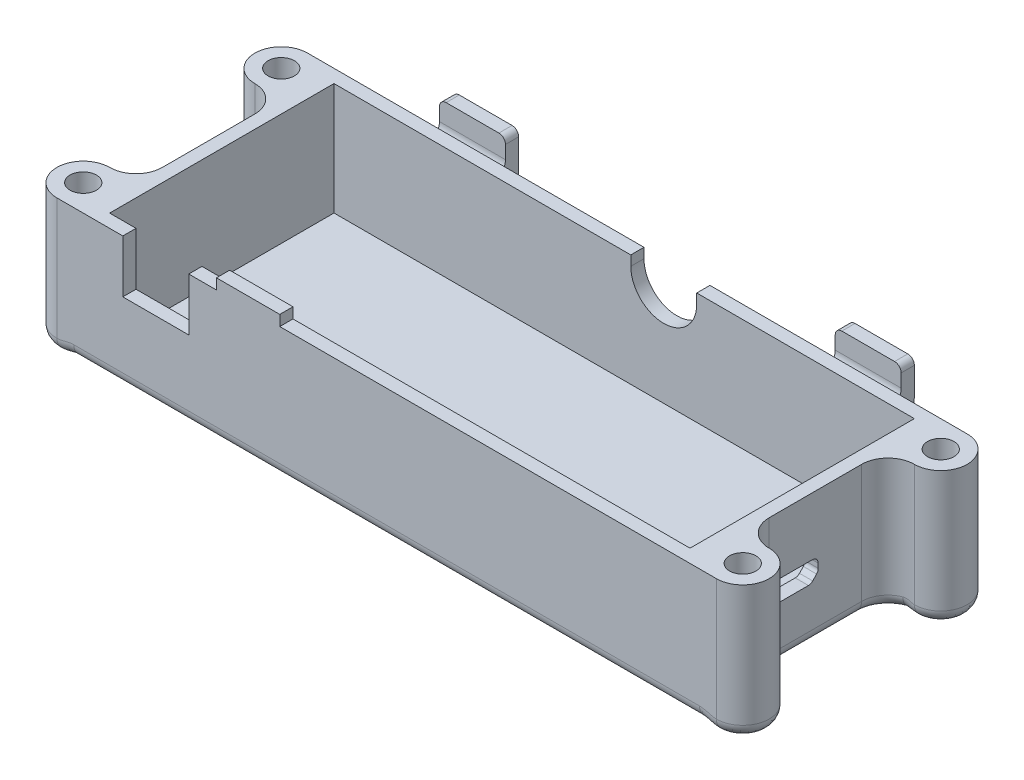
ISO-10303-21;
HEADER;
FILE_DESCRIPTION(('STEP AP214'),'2;1');
FILE_NAME('part.step','',(''),(''),'','','');
FILE_SCHEMA(('AUTOMOTIVE_DESIGN { 1 0 10303 214 1 1 1 1 }'));
ENDSEC;
DATA;
#1=APPLICATION_CONTEXT('core data for automotive mechanical design processes');
#2=APPLICATION_PROTOCOL_DEFINITION('international standard','automotive_design',2000,#1);
#3=PRODUCT_CONTEXT('',#1,'mechanical');
#4=PRODUCT('Part','Part','',(#3));
#5=PRODUCT_RELATED_PRODUCT_CATEGORY('part','',(#4));
#6=PRODUCT_DEFINITION_FORMATION('','',#4);
#7=PRODUCT_DEFINITION_CONTEXT('part definition',#1,'design');
#8=PRODUCT_DEFINITION('design','',#6,#7);
#9=PRODUCT_DEFINITION_SHAPE('','',#8);
#10=(LENGTH_UNIT() NAMED_UNIT(*) SI_UNIT(.MILLI.,.METRE.));
#11=(NAMED_UNIT(*) PLANE_ANGLE_UNIT() SI_UNIT($,.RADIAN.));
#12=(NAMED_UNIT(*) SI_UNIT($,.STERADIAN.) SOLID_ANGLE_UNIT());
#13=UNCERTAINTY_MEASURE_WITH_UNIT(LENGTH_MEASURE(1.E-05),#10,'distance_accuracy_value','');
#14=(GEOMETRIC_REPRESENTATION_CONTEXT(3) GLOBAL_UNCERTAINTY_ASSIGNED_CONTEXT((#13)) GLOBAL_UNIT_ASSIGNED_CONTEXT((#10,
#11,#12)) REPRESENTATION_CONTEXT('',''));
#15=CARTESIAN_POINT('',(0.,0.,0.));
#16=DIRECTION('',(0.,0.,1.));
#17=DIRECTION('',(1.,0.,0.));
#18=AXIS2_PLACEMENT_3D('',#15,#16,#17);
#19=CARTESIAN_POINT('',(54.,9.63087662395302,0.467870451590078));
#20=DIRECTION('',(-1.,0.,0.));
#21=DIRECTION('',(0.,0.,1.));
#22=AXIS2_PLACEMENT_3D('',#19,#20,#21);
#23=CYLINDRICAL_SURFACE('',#22,0.899999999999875);
#24=CARTESIAN_POINT('',(44.,9.63087662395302,0.467870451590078));
#25=DIRECTION('',(-1.,0.,0.));
#26=DIRECTION('',(0.,0.,1.));
#27=AXIS2_PLACEMENT_3D('',#24,#25,#26);
#28=CIRCLE('',#27,0.899999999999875);
#29=CARTESIAN_POINT('',(44.,9.00691472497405,-0.18072152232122));
#30=VERTEX_POINT('',#29);
#31=CARTESIAN_POINT('',(44.,9.63087662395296,-0.432129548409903));
#32=VERTEX_POINT('',#31);
#33=EDGE_CURVE('E488',#30,#32,#28,.F.);
#34=ORIENTED_EDGE('',*,*,#33,.F.);
#35=DIRECTION('',(1.,0.,0.));
#36=VECTOR('',#35,1.);
#37=CARTESIAN_POINT('',(54.,9.00691472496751,-0.180721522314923));
#38=LINE('',#37,#36);
#39=CARTESIAN_POINT('',(46.,9.00691472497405,-0.18072152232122));
#40=VERTEX_POINT('',#39);
#41=EDGE_CURVE('E480',#30,#40,#38,.T.);
#42=ORIENTED_EDGE('',*,*,#41,.T.);
#43=CARTESIAN_POINT('',(46.,9.63087662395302,0.467870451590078));
#44=DIRECTION('',(-1.,0.,0.));
#45=DIRECTION('',(0.,0.,1.));
#46=AXIS2_PLACEMENT_3D('',#43,#44,#45);
#47=CIRCLE('',#46,0.899999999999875);
#48=CARTESIAN_POINT('',(46.,9.63087662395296,-0.432129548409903));
#49=VERTEX_POINT('',#48);
#50=EDGE_CURVE('E20',#49,#40,#47,.T.);
#51=ORIENTED_EDGE('',*,*,#50,.F.);
#52=DIRECTION('',(1.,0.,0.));
#53=VECTOR('',#52,1.);
#54=CARTESIAN_POINT('',(54.,9.63087662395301,-0.432129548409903));
#55=LINE('',#54,#53);
#56=EDGE_CURVE('E479',#49,#32,#55,.F.);
#57=ORIENTED_EDGE('',*,*,#56,.T.);
#58=EDGE_LOOP('',(#34,#42,#51,#57));
#59=FACE_BOUND('',#58,.T.);
#60=ADVANCED_FACE('F17',(#59),#23,.F.);
#61=CARTESIAN_POINT('',(54.,9.63087662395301,6.78787045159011));
#62=DIRECTION('',(-1.,0.,0.));
#63=DIRECTION('',(0.,0.,1.));
#64=AXIS2_PLACEMENT_3D('',#61,#62,#63);
#65=CYLINDRICAL_SURFACE('',#64,0.900000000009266);
#66=CARTESIAN_POINT('',(44.,9.63087662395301,6.78787045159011));
#67=DIRECTION('',(-1.,0.,0.));
#68=DIRECTION('',(0.,0.,1.));
#69=AXIS2_PLACEMENT_3D('',#66,#67,#68);
#70=CIRCLE('',#69,0.900000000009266);
#71=CARTESIAN_POINT('',(44.,9.63087662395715,7.68787045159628));
#72=VERTEX_POINT('',#71);
#73=CARTESIAN_POINT('',(44.,9.00691472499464,7.43646242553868));
#74=VERTEX_POINT('',#73);
#75=EDGE_CURVE('E915',#72,#74,#70,.F.);
#76=ORIENTED_EDGE('',*,*,#75,.F.);
#77=DIRECTION('',(1.,0.,0.));
#78=VECTOR('',#77,1.);
#79=CARTESIAN_POINT('',(54.,9.63087662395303,7.68787045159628));
#80=LINE('',#79,#78);
#81=CARTESIAN_POINT('',(46.0578569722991,9.63087662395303,7.68787045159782));
#82=VERTEX_POINT('',#81);
#83=EDGE_CURVE('E496',#72,#82,#80,.T.);
#84=ORIENTED_EDGE('',*,*,#83,.T.);
#85=CARTESIAN_POINT('',(46.0227987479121,9.00691472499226,7.4364624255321));
#86=CARTESIAN_POINT('',(46.026563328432,9.04328102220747,7.4715042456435));
#87=CARTESIAN_POINT('',(46.0304479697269,9.08263964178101,7.50341726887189));
#88=CARTESIAN_POINT('',(46.0379264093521,9.16621182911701,7.56028530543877));
#89=CARTESIAN_POINT('',(46.0415197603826,9.21043262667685,7.58522975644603));
#90=CARTESIAN_POINT('',(46.0478730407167,9.30252578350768,7.62736981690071));
#91=CARTESIAN_POINT('',(46.0506321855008,9.35040152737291,7.64455813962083));
#92=CARTESIAN_POINT('',(46.0549054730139,9.44833139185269,7.67061146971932));
#93=CARTESIAN_POINT('',(46.0564227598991,9.49837967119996,7.67949750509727));
#94=CARTESIAN_POINT('',(46.0574275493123,9.56241462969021,7.68536830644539));
#95=CARTESIAN_POINT('',(46.0575884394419,9.57609721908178,7.68630682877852));
#96=CARTESIAN_POINT('',(46.0578029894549,9.6034769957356,7.68755715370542));
#97=CARTESIAN_POINT('',(46.0578567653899,9.61717415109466,7.68786963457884));
#98=CARTESIAN_POINT('',(46.0578569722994,9.63087662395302,7.68787045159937));
#99=B_SPLINE_CURVE_WITH_KNOTS('',3,(#85,#86,#87,#88,#89,#90,#91,#92,#93,#94,#95,#96,#97,#98),
.UNSPECIFIED.,.F.,.F.,(4,2,2,2,2,2,4),(0.,0.151743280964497,0.303715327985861,0.455829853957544,
0.607558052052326,0.648695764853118,0.689788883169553),.UNSPECIFIED.);
#100=CARTESIAN_POINT('',(46.0227987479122,9.00691472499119,7.43646242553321));
#101=VERTEX_POINT('',#100);
#102=EDGE_CURVE('E935',#101,#82,#99,.T.);
#103=ORIENTED_EDGE('',*,*,#102,.F.);
#104=DIRECTION('',(1.,0.,0.));
#105=VECTOR('',#104,1.);
#106=CARTESIAN_POINT('',(54.,9.00691472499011,7.43646242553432));
#107=LINE('',#106,#105);
#108=EDGE_CURVE('E909',#101,#74,#107,.F.);
#109=ORIENTED_EDGE('',*,*,#108,.T.);
#110=EDGE_LOOP('',(#76,#84,#103,#109));
#111=FACE_BOUND('',#110,.T.);
#112=ADVANCED_FACE('F934',(#111),#65,.F.);
#113=CARTESIAN_POINT('',(-35.,19.,-24.01));
#114=DIRECTION('',(0.,1.,0.));
#115=DIRECTION('',(0.,0.,1.));
#116=AXIS2_PLACEMENT_3D('',#113,#114,#115);
#117=PLANE('',#116);
#118=DIRECTION('',(-1.,0.,0.));
#119=VECTOR('',#118,1.);
#120=CARTESIAN_POINT('',(-35.,19.,-26.01));
#121=LINE('',#120,#119);
#122=CARTESIAN_POINT('',(-34.,19.,-26.01));
#123=VERTEX_POINT('',#122);
#124=CARTESIAN_POINT('',(-26.,19.,-26.01));
#125=VERTEX_POINT('',#124);
#126=EDGE_CURVE('E839',#123,#125,#121,.F.);
#127=ORIENTED_EDGE('',*,*,#126,.F.);
#128=DIRECTION('',(0.,0.,1.));
#129=VECTOR('',#128,1.);
#130=CARTESIAN_POINT('',(-34.,19.,-24.01));
#131=LINE('',#130,#129);
#132=CARTESIAN_POINT('',(-34.,19.,-24.01));
#133=VERTEX_POINT('',#132);
#134=EDGE_CURVE('E843',#133,#123,#131,.F.);
#135=ORIENTED_EDGE('',*,*,#134,.F.);
#136=DIRECTION('',(1.,0.,0.));
#137=VECTOR('',#136,1.);
#138=CARTESIAN_POINT('',(-35.,19.,-24.01));
#139=LINE('',#138,#137);
#140=CARTESIAN_POINT('',(-26.,19.,-24.01));
#141=VERTEX_POINT('',#140);
#142=EDGE_CURVE('E848',#141,#133,#139,.F.);
#143=ORIENTED_EDGE('',*,*,#142,.F.);
#144=DIRECTION('',(0.,0.,-1.));
#145=VECTOR('',#144,1.);
#146=CARTESIAN_POINT('',(-26.,19.,-22.01));
#147=LINE('',#146,#145);
#148=EDGE_CURVE('E922',#125,#141,#147,.F.);
#149=ORIENTED_EDGE('',*,*,#148,.F.);
#150=EDGE_LOOP('',(#127,#135,#143,#149));
#151=FACE_BOUND('',#150,.T.);
#152=ADVANCED_FACE('F955',(#151),#117,.T.);
#153=CARTESIAN_POINT('',(35.,19.,-24.01));
#154=DIRECTION('',(0.,-1.,0.));
#155=DIRECTION('',(0.,0.,-1.));
#156=AXIS2_PLACEMENT_3D('',#153,#154,#155);
#157=PLANE('',#156);
#158=DIRECTION('',(0.,0.,-1.));
#159=VECTOR('',#158,1.);
#160=CARTESIAN_POINT('',(34.,19.,-22.01));
#161=LINE('',#160,#159);
#162=CARTESIAN_POINT('',(34.,19.,-26.01));
#163=VERTEX_POINT('',#162);
#164=CARTESIAN_POINT('',(34.,19.,-24.01));
#165=VERTEX_POINT('',#164);
#166=EDGE_CURVE('E917',#163,#165,#161,.F.);
#167=ORIENTED_EDGE('',*,*,#166,.F.);
#168=DIRECTION('',(1.,0.,0.));
#169=VECTOR('',#168,1.);
#170=CARTESIAN_POINT('',(35.,19.,-26.01));
#171=LINE('',#170,#169);
#172=CARTESIAN_POINT('',(26.,19.,-26.01));
#173=VERTEX_POINT('',#172);
#174=EDGE_CURVE('E801',#163,#173,#171,.F.);
#175=ORIENTED_EDGE('',*,*,#174,.T.);
#176=DIRECTION('',(0.,0.,1.));
#177=VECTOR('',#176,1.);
#178=CARTESIAN_POINT('',(26.,19.,-24.01));
#179=LINE('',#178,#177);
#180=CARTESIAN_POINT('',(26.,19.,-24.01));
#181=VERTEX_POINT('',#180);
#182=EDGE_CURVE('E832',#181,#173,#179,.F.);
#183=ORIENTED_EDGE('',*,*,#182,.F.);
#184=DIRECTION('',(-1.,0.,0.));
#185=VECTOR('',#184,1.);
#186=CARTESIAN_POINT('',(35.,19.,-24.01));
#187=LINE('',#186,#185);
#188=EDGE_CURVE('E814',#181,#165,#187,.F.);
#189=ORIENTED_EDGE('',*,*,#188,.T.);
#190=EDGE_LOOP('',(#167,#175,#183,#189));
#191=FACE_BOUND('',#190,.T.);
#192=ADVANCED_FACE('F958',(#191),#157,.F.);
#193=CARTESIAN_POINT('',(54.,8.39603810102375,6.8487836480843));
#194=DIRECTION('',(0.,-0.693290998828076,0.720657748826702));
#195=DIRECTION('',(0.,-0.720657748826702,-0.693290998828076));
#196=AXIS2_PLACEMENT_3D('',#193,#194,#195);
#197=PLANE('',#196);
#198=DIRECTION('',(0.,-0.720657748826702,-0.693290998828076));
#199=VECTOR('',#198,1.);
#200=CARTESIAN_POINT('',(44.,8.39603810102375,6.8487836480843));
#201=LINE('',#200,#199);
#202=CARTESIAN_POINT('',(44.,8.39603810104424,6.84878364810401));
#203=VERTEX_POINT('',#202);
#204=EDGE_CURVE('E908',#74,#203,#201,.T.);
#205=ORIENTED_EDGE('',*,*,#204,.F.);
#206=ORIENTED_EDGE('',*,*,#108,.F.);
#207=CARTESIAN_POINT('',(50.,8.56361825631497,7.00999999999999));
#208=DIRECTION('',(0.,-0.693290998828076,0.720657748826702));
#209=DIRECTION('',(0.,-0.720657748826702,-0.693290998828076));
#210=AXIS2_PLACEMENT_3D('',#207,#208,#209);
#211=ELLIPSE('',#210,5.76958305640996,4.);
#212=CARTESIAN_POINT('',(46.,8.56361825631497,7.00999999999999));
#213=VERTEX_POINT('',#212);
#214=EDGE_CURVE('E912',#213,#101,#211,.F.);
#215=ORIENTED_EDGE('',*,*,#214,.F.);
#216=DIRECTION('',(0.,-0.720657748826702,-0.693290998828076));
#217=VECTOR('',#216,1.);
#218=CARTESIAN_POINT('',(46.,8.39603810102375,6.8487836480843));
#219=LINE('',#218,#217);
#220=CARTESIAN_POINT('',(46.,8.39603810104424,6.84878364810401));
#221=VERTEX_POINT('',#220);
#222=EDGE_CURVE('E913',#221,#213,#219,.F.);
#223=ORIENTED_EDGE('',*,*,#222,.F.);
#224=DIRECTION('',(-1.,0.,0.));
#225=VECTOR('',#224,1.);
#226=CARTESIAN_POINT('',(54.,8.39603810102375,6.8487836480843));
#227=LINE('',#226,#225);
#228=EDGE_CURVE('E888',#221,#203,#227,.T.);
#229=ORIENTED_EDGE('',*,*,#228,.T.);
#230=EDGE_LOOP('',(#205,#206,#215,#223,#229));
#231=FACE_BOUND('',#230,.T.);
#232=ADVANCED_FACE('F962',(#231),#197,.F.);
#233=CARTESIAN_POINT('',(54.,9.00691472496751,-0.180721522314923));
#234=DIRECTION('',(0.,-0.693290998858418,-0.720657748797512));
#235=DIRECTION('',(0.,0.720657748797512,-0.693290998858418));
#236=AXIS2_PLACEMENT_3D('',#233,#234,#235);
#237=PLANE('',#236);
#238=DIRECTION('',(0.,0.720657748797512,-0.693290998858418));
#239=VECTOR('',#238,1.);
#240=CARTESIAN_POINT('',(44.,9.00691472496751,-0.180721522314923));
#241=LINE('',#240,#239);
#242=CARTESIAN_POINT('',(44.,8.39603810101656,0.406957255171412));
#243=VERTEX_POINT('',#242);
#244=EDGE_CURVE('E499',#243,#30,#241,.T.);
#245=ORIENTED_EDGE('',*,*,#244,.F.);
#246=DIRECTION('',(-1.,0.,0.));
#247=VECTOR('',#246,1.);
#248=CARTESIAN_POINT('',(54.,8.39603810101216,0.406957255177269));
#249=LINE('',#248,#247);
#250=CARTESIAN_POINT('',(46.,8.39603810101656,0.406957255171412));
#251=VERTEX_POINT('',#250);
#252=EDGE_CURVE('E892',#243,#251,#249,.F.);
#253=ORIENTED_EDGE('',*,*,#252,.T.);
#254=DIRECTION('',(0.,0.720657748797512,-0.693290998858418));
#255=VECTOR('',#254,1.);
#256=CARTESIAN_POINT('',(46.,9.00691472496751,-0.180721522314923));
#257=LINE('',#256,#255);
#258=EDGE_CURVE('E906',#40,#251,#257,.F.);
#259=ORIENTED_EDGE('',*,*,#258,.F.);
#260=ORIENTED_EDGE('',*,*,#41,.F.);
#261=EDGE_LOOP('',(#245,#253,#259,#260));
#262=FACE_BOUND('',#261,.T.);
#263=ADVANCED_FACE('F966',(#262),#237,.F.);
#264=CARTESIAN_POINT('',(54.,10.31,-0.432129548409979));
#265=DIRECTION('',(0.,-1.12232055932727E-13,-1.));
#266=DIRECTION('',(0.,1.,-1.12232055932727E-13));
#267=AXIS2_PLACEMENT_3D('',#264,#265,#266);
#268=PLANE('',#267);
#269=DIRECTION('',(0.,1.,-1.12232055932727E-13));
#270=VECTOR('',#269,1.);
#271=CARTESIAN_POINT('',(44.,10.31,-0.432129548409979));
#272=LINE('',#271,#270);
#273=CARTESIAN_POINT('',(44.,10.31,-0.432129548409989));
#274=VERTEX_POINT('',#273);
#275=EDGE_CURVE('E490',#32,#274,#272,.T.);
#276=ORIENTED_EDGE('',*,*,#275,.F.);
#277=ORIENTED_EDGE('',*,*,#56,.F.);
#278=DIRECTION('',(0.,1.,-1.12232055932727E-13));
#279=VECTOR('',#278,1.);
#280=CARTESIAN_POINT('',(46.,10.31,-0.432129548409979));
#281=LINE('',#280,#279);
#282=CARTESIAN_POINT('',(46.,10.31,-0.432129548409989));
#283=VERTEX_POINT('',#282);
#284=EDGE_CURVE('E469',#283,#49,#281,.F.);
#285=ORIENTED_EDGE('',*,*,#284,.F.);
#286=DIRECTION('',(-1.,0.,0.));
#287=VECTOR('',#286,1.);
#288=CARTESIAN_POINT('',(54.,10.31,-0.432129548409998));
#289=LINE('',#288,#287);
#290=EDGE_CURVE('E895',#283,#274,#289,.T.);
#291=ORIENTED_EDGE('',*,*,#290,.T.);
#292=EDGE_LOOP('',(#276,#277,#285,#291));
#293=FACE_BOUND('',#292,.T.);
#294=ADVANCED_FACE('F489',(#293),#268,.F.);
#295=CARTESIAN_POINT('',(54.,9.63087662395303,7.68787045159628));
#296=DIRECTION('',(0.,9.17014124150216E-12,1.));
#297=DIRECTION('',(0.,-1.,9.17014124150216E-12));
#298=AXIS2_PLACEMENT_3D('',#295,#296,#297);
#299=PLANE('',#298);
#300=DIRECTION('',(0.,-1.,9.17014124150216E-12));
#301=VECTOR('',#300,1.);
#302=CARTESIAN_POINT('',(44.,9.63087662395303,7.68787045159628));
#303=LINE('',#302,#301);
#304=CARTESIAN_POINT('',(44.,10.3100000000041,7.68787045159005));
#305=VERTEX_POINT('',#304);
#306=EDGE_CURVE('E902',#305,#72,#303,.T.);
#307=ORIENTED_EDGE('',*,*,#306,.F.);
#308=DIRECTION('',(-1.,0.,0.));
#309=VECTOR('',#308,1.);
#310=CARTESIAN_POINT('',(54.,10.31,7.68787045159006));
#311=LINE('',#310,#309);
#312=CARTESIAN_POINT('',(46.0578569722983,10.3100000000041,7.68787045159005));
#313=VERTEX_POINT('',#312);
#314=EDGE_CURVE('E782',#305,#313,#311,.F.);
#315=ORIENTED_EDGE('',*,*,#314,.T.);
#316=DIRECTION('',(0.,-1.,9.17014124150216E-12));
#317=VECTOR('',#316,1.);
#318=CARTESIAN_POINT('',(46.0578569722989,9.63087662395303,7.68787045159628));
#319=LINE('',#318,#317);
#320=EDGE_CURVE('E492',#82,#313,#319,.F.);
#321=ORIENTED_EDGE('',*,*,#320,.F.);
#322=ORIENTED_EDGE('',*,*,#83,.F.);
#323=EDGE_LOOP('',(#307,#315,#321,#322));
#324=FACE_BOUND('',#323,.T.);
#325=ADVANCED_FACE('F938',(#324),#299,.F.);
#326=CARTESIAN_POINT('',(0.,3.,0.));
#327=DIRECTION('',(0.,-1.,0.));
#328=DIRECTION('',(0.,0.,-1.));
#329=AXIS2_PLACEMENT_3D('',#326,#327,#328);
#330=PLANE('',#329);
#331=DIRECTION('',(0.,0.,-1.));
#332=VECTOR('',#331,1.);
#333=CARTESIAN_POINT('',(44.,3.,17.01));
#334=LINE('',#333,#332);
#335=CARTESIAN_POINT('',(44.,3.,17.01));
#336=VERTEX_POINT('',#335);
#337=CARTESIAN_POINT('',(44.,3.,-17.01));
#338=VERTEX_POINT('',#337);
#339=EDGE_CURVE('E856',#336,#338,#334,.T.);
#340=ORIENTED_EDGE('',*,*,#339,.T.);
#341=DIRECTION('',(1.,0.,0.));
#342=VECTOR('',#341,1.);
#343=CARTESIAN_POINT('',(-44.,3.,-17.01));
#344=LINE('',#343,#342);
#345=CARTESIAN_POINT('',(-44.,3.,-17.01));
#346=VERTEX_POINT('',#345);
#347=EDGE_CURVE('E862',#346,#338,#344,.T.);
#348=ORIENTED_EDGE('',*,*,#347,.F.);
#349=DIRECTION('',(0.,0.,-1.));
#350=VECTOR('',#349,1.);
#351=CARTESIAN_POINT('',(-44.,3.,17.01));
#352=LINE('',#351,#350);
#353=CARTESIAN_POINT('',(-44.,3.,17.01));
#354=VERTEX_POINT('',#353);
#355=EDGE_CURVE('E869',#354,#346,#352,.T.);
#356=ORIENTED_EDGE('',*,*,#355,.F.);
#357=DIRECTION('',(1.,0.,0.));
#358=VECTOR('',#357,1.);
#359=CARTESIAN_POINT('',(-44.,3.,17.01));
#360=LINE('',#359,#358);
#361=EDGE_CURVE('E883',#354,#336,#360,.T.);
#362=ORIENTED_EDGE('',*,*,#361,.T.);
#363=EDGE_LOOP('',(#340,#348,#356,#362));
#364=FACE_BOUND('',#363,.T.);
#365=ADVANCED_FACE('F975',(#364),#330,.F.);
#366=CARTESIAN_POINT('',(-26.,18.,-22.01));
#367=DIRECTION('',(0.,0.,-1.));
#368=DIRECTION('',(-1.,0.,0.));
#369=AXIS2_PLACEMENT_3D('',#366,#367,#368);
#370=CYLINDRICAL_SURFACE('',#369,1.);
#371=CARTESIAN_POINT('',(-26.,18.,-24.01));
#372=DIRECTION('',(0.,0.,-1.));
#373=DIRECTION('',(-1.,0.,0.));
#374=AXIS2_PLACEMENT_3D('',#371,#372,#373);
#375=CIRCLE('',#374,1.);
#376=CARTESIAN_POINT('',(-25.,18.,-24.01));
#377=VERTEX_POINT('',#376);
#378=EDGE_CURVE('E851',#377,#141,#375,.F.);
#379=ORIENTED_EDGE('',*,*,#378,.F.);
#380=DIRECTION('',(0.,0.,1.));
#381=VECTOR('',#380,1.);
#382=CARTESIAN_POINT('',(-25.,18.,-22.01));
#383=LINE('',#382,#381);
#384=CARTESIAN_POINT('',(-25.,18.,-26.01));
#385=VERTEX_POINT('',#384);
#386=EDGE_CURVE('E852',#377,#385,#383,.F.);
#387=ORIENTED_EDGE('',*,*,#386,.T.);
#388=CARTESIAN_POINT('',(-26.,18.,-26.01));
#389=DIRECTION('',(0.,0.,-1.));
#390=DIRECTION('',(-1.,0.,0.));
#391=AXIS2_PLACEMENT_3D('',#388,#389,#390);
#392=CIRCLE('',#391,1.);
#393=EDGE_CURVE('E842',#125,#385,#392,.T.);
#394=ORIENTED_EDGE('',*,*,#393,.F.);
#395=ORIENTED_EDGE('',*,*,#148,.T.);
#396=EDGE_LOOP('',(#379,#387,#394,#395));
#397=FACE_BOUND('',#396,.T.);
#398=ADVANCED_FACE('F978',(#397),#370,.T.);
#399=CARTESIAN_POINT('',(-35.,16.,-24.01));
#400=DIRECTION('',(0.,0.,1.));
#401=DIRECTION('',(1.,0.,0.));
#402=AXIS2_PLACEMENT_3D('',#399,#400,#401);
#403=PLANE('',#402);
#404=DIRECTION('',(0.,1.,0.));
#405=VECTOR('',#404,1.);
#406=CARTESIAN_POINT('',(-35.,16.,-24.01));
#407=LINE('',#406,#405);
#408=CARTESIAN_POINT('',(-35.,16.,-24.01));
#409=VERTEX_POINT('',#408);
#410=CARTESIAN_POINT('',(-35.,18.,-24.01));
#411=VERTEX_POINT('',#410);
#412=EDGE_CURVE('E837',#409,#411,#407,.T.);
#413=ORIENTED_EDGE('',*,*,#412,.F.);
#414=DIRECTION('',(1.,0.,0.));
#415=VECTOR('',#414,1.);
#416=CARTESIAN_POINT('',(-35.,16.,-24.01));
#417=LINE('',#416,#415);
#418=CARTESIAN_POINT('',(-25.,16.,-24.01));
#419=VERTEX_POINT('',#418);
#420=EDGE_CURVE('E830',#409,#419,#417,.T.);
#421=ORIENTED_EDGE('',*,*,#420,.T.);
#422=DIRECTION('',(0.,1.,0.));
#423=VECTOR('',#422,1.);
#424=CARTESIAN_POINT('',(-25.,16.,-24.01));
#425=LINE('',#424,#423);
#426=EDGE_CURVE('E855',#419,#377,#425,.T.);
#427=ORIENTED_EDGE('',*,*,#426,.T.);
#428=ORIENTED_EDGE('',*,*,#378,.T.);
#429=ORIENTED_EDGE('',*,*,#142,.T.);
#430=CARTESIAN_POINT('',(-34.,18.,-24.01));
#431=DIRECTION('',(0.,0.,1.));
#432=DIRECTION('',(1.,0.,0.));
#433=AXIS2_PLACEMENT_3D('',#430,#431,#432);
#434=CIRCLE('',#433,1.);
#435=EDGE_CURVE('E850',#411,#133,#434,.F.);
#436=ORIENTED_EDGE('',*,*,#435,.F.);
#437=EDGE_LOOP('',(#413,#421,#427,#428,#429,#436));
#438=FACE_BOUND('',#437,.T.);
#439=ADVANCED_FACE('F982',(#438),#403,.T.);
#440=CARTESIAN_POINT('',(-34.,18.,-24.01));
#441=DIRECTION('',(0.,0.,1.));
#442=DIRECTION('',(1.,0.,0.));
#443=AXIS2_PLACEMENT_3D('',#440,#441,#442);
#444=CYLINDRICAL_SURFACE('',#443,1.);
#445=ORIENTED_EDGE('',*,*,#435,.T.);
#446=ORIENTED_EDGE('',*,*,#134,.T.);
#447=CARTESIAN_POINT('',(-34.,18.,-26.01));
#448=DIRECTION('',(0.,0.,1.));
#449=DIRECTION('',(1.,0.,0.));
#450=AXIS2_PLACEMENT_3D('',#447,#448,#449);
#451=CIRCLE('',#450,1.);
#452=CARTESIAN_POINT('',(-35.,18.,-26.01));
#453=VERTEX_POINT('',#452);
#454=EDGE_CURVE('E833',#453,#123,#451,.F.);
#455=ORIENTED_EDGE('',*,*,#454,.F.);
#456=DIRECTION('',(0.,0.,1.));
#457=VECTOR('',#456,1.);
#458=CARTESIAN_POINT('',(-35.,18.,-22.01));
#459=LINE('',#458,#457);
#460=EDGE_CURVE('E844',#411,#453,#459,.F.);
#461=ORIENTED_EDGE('',*,*,#460,.F.);
#462=EDGE_LOOP('',(#445,#446,#455,#461));
#463=FACE_BOUND('',#462,.T.);
#464=ADVANCED_FACE('F985',(#463),#444,.T.);
#465=CARTESIAN_POINT('',(-35.,19.,-26.01));
#466=DIRECTION('',(0.,0.,-1.));
#467=DIRECTION('',(-1.,0.,0.));
#468=AXIS2_PLACEMENT_3D('',#465,#466,#467);
#469=PLANE('',#468);
#470=DIRECTION('',(0.,1.,0.));
#471=VECTOR('',#470,1.);
#472=CARTESIAN_POINT('',(-35.,16.,-26.01));
#473=LINE('',#472,#471);
#474=CARTESIAN_POINT('',(-35.,14.,-26.01));
#475=VERTEX_POINT('',#474);
#476=EDGE_CURVE('E847',#453,#475,#473,.F.);
#477=ORIENTED_EDGE('',*,*,#476,.F.);
#478=ORIENTED_EDGE('',*,*,#454,.T.);
#479=ORIENTED_EDGE('',*,*,#126,.T.);
#480=ORIENTED_EDGE('',*,*,#393,.T.);
#481=DIRECTION('',(0.,1.,0.));
#482=VECTOR('',#481,1.);
#483=CARTESIAN_POINT('',(-25.,16.,-26.01));
#484=LINE('',#483,#482);
#485=CARTESIAN_POINT('',(-25.,14.,-26.01));
#486=VERTEX_POINT('',#485);
#487=EDGE_CURVE('E854',#385,#486,#484,.F.);
#488=ORIENTED_EDGE('',*,*,#487,.T.);
#489=DIRECTION('',(1.,0.,0.));
#490=VECTOR('',#489,1.);
#491=CARTESIAN_POINT('',(-35.,14.,-26.01));
#492=LINE('',#491,#490);
#493=EDGE_CURVE('E834',#475,#486,#492,.T.);
#494=ORIENTED_EDGE('',*,*,#493,.F.);
#495=EDGE_LOOP('',(#477,#478,#479,#480,#488,#494));
#496=FACE_BOUND('',#495,.T.);
#497=ADVANCED_FACE('F989',(#496),#469,.T.);
#498=CARTESIAN_POINT('',(-35.,16.,-22.01));
#499=DIRECTION('',(1.,0.,0.));
#500=DIRECTION('',(0.,0.,-1.));
#501=AXIS2_PLACEMENT_3D('',#498,#499,#500);
#502=CYLINDRICAL_SURFACE('',#501,2.);
#503=ORIENTED_EDGE('',*,*,#420,.F.);
#504=CARTESIAN_POINT('',(-35.,16.,-22.01));
#505=DIRECTION('',(1.,0.,0.));
#506=DIRECTION('',(0.,0.,-1.));
#507=AXIS2_PLACEMENT_3D('',#504,#505,#506);
#508=CIRCLE('',#507,2.);
#509=CARTESIAN_POINT('',(-35.,14.,-22.01));
#510=VERTEX_POINT('',#509);
#511=EDGE_CURVE('E1076',#510,#409,#508,.T.);
#512=ORIENTED_EDGE('',*,*,#511,.F.);
#513=DIRECTION('',(1.,0.,0.));
#514=VECTOR('',#513,1.);
#515=CARTESIAN_POINT('',(-35.,14.,-22.01));
#516=LINE('',#515,#514);
#517=CARTESIAN_POINT('',(-25.,14.,-22.01));
#518=VERTEX_POINT('',#517);
#519=EDGE_CURVE('E825',#518,#510,#516,.F.);
#520=ORIENTED_EDGE('',*,*,#519,.F.);
#521=CARTESIAN_POINT('',(-25.,16.,-22.01));
#522=DIRECTION('',(1.,0.,0.));
#523=DIRECTION('',(0.,0.,-1.));
#524=AXIS2_PLACEMENT_3D('',#521,#522,#523);
#525=CIRCLE('',#524,2.);
#526=EDGE_CURVE('E1104',#518,#419,#525,.T.);
#527=ORIENTED_EDGE('',*,*,#526,.T.);
#528=EDGE_LOOP('',(#503,#512,#520,#527));
#529=FACE_BOUND('',#528,.T.);
#530=ADVANCED_FACE('F993',(#529),#502,.F.);
#531=CARTESIAN_POINT('',(26.,18.,-24.01));
#532=DIRECTION('',(0.,0.,1.));
#533=DIRECTION('',(1.,0.,0.));
#534=AXIS2_PLACEMENT_3D('',#531,#532,#533);
#535=CYLINDRICAL_SURFACE('',#534,1.);
#536=CARTESIAN_POINT('',(26.,18.,-24.01));
#537=DIRECTION('',(0.,0.,1.));
#538=DIRECTION('',(1.,0.,0.));
#539=AXIS2_PLACEMENT_3D('',#536,#537,#538);
#540=CIRCLE('',#539,1.);
#541=CARTESIAN_POINT('',(25.,18.,-24.01));
#542=VERTEX_POINT('',#541);
#543=EDGE_CURVE('E816',#542,#181,#540,.F.);
#544=ORIENTED_EDGE('',*,*,#543,.T.);
#545=ORIENTED_EDGE('',*,*,#182,.T.);
#546=CARTESIAN_POINT('',(26.,18.,-26.01));
#547=DIRECTION('',(0.,0.,1.));
#548=DIRECTION('',(1.,0.,0.));
#549=AXIS2_PLACEMENT_3D('',#546,#547,#548);
#550=CIRCLE('',#549,1.);
#551=CARTESIAN_POINT('',(25.,18.,-26.01));
#552=VERTEX_POINT('',#551);
#553=EDGE_CURVE('E812',#173,#552,#550,.T.);
#554=ORIENTED_EDGE('',*,*,#553,.T.);
#555=DIRECTION('',(0.,0.,-1.));
#556=VECTOR('',#555,1.);
#557=CARTESIAN_POINT('',(25.,18.,-22.01));
#558=LINE('',#557,#556);
#559=EDGE_CURVE('E822',#552,#542,#558,.F.);
#560=ORIENTED_EDGE('',*,*,#559,.T.);
#561=EDGE_LOOP('',(#544,#545,#554,#560));
#562=FACE_BOUND('',#561,.T.);
#563=ADVANCED_FACE('F997',(#562),#535,.T.);
#564=CARTESIAN_POINT('',(34.,18.,-22.01));
#565=DIRECTION('',(0.,0.,-1.));
#566=DIRECTION('',(-1.,0.,0.));
#567=AXIS2_PLACEMENT_3D('',#564,#565,#566);
#568=CYLINDRICAL_SURFACE('',#567,1.);
#569=CARTESIAN_POINT('',(34.,18.,-24.01));
#570=DIRECTION('',(0.,0.,-1.));
#571=DIRECTION('',(-1.,0.,0.));
#572=AXIS2_PLACEMENT_3D('',#569,#570,#571);
#573=CIRCLE('',#572,1.);
#574=CARTESIAN_POINT('',(35.,18.,-24.01));
#575=VERTEX_POINT('',#574);
#576=EDGE_CURVE('E813',#165,#575,#573,.T.);
#577=ORIENTED_EDGE('',*,*,#576,.T.);
#578=DIRECTION('',(0.,0.,-1.));
#579=VECTOR('',#578,1.);
#580=CARTESIAN_POINT('',(35.,18.,-22.01));
#581=LINE('',#580,#579);
#582=CARTESIAN_POINT('',(35.,18.,-26.01));
#583=VERTEX_POINT('',#582);
#584=EDGE_CURVE('E817',#583,#575,#581,.F.);
#585=ORIENTED_EDGE('',*,*,#584,.F.);
#586=CARTESIAN_POINT('',(34.,18.,-26.01));
#587=DIRECTION('',(0.,0.,-1.));
#588=DIRECTION('',(-1.,0.,0.));
#589=AXIS2_PLACEMENT_3D('',#586,#587,#588);
#590=CIRCLE('',#589,1.);
#591=EDGE_CURVE('E805',#583,#163,#590,.F.);
#592=ORIENTED_EDGE('',*,*,#591,.T.);
#593=ORIENTED_EDGE('',*,*,#166,.T.);
#594=EDGE_LOOP('',(#577,#585,#592,#593));
#595=FACE_BOUND('',#594,.T.);
#596=ADVANCED_FACE('F1001',(#595),#568,.T.);
#597=CARTESIAN_POINT('',(35.,16.,-24.01));
#598=DIRECTION('',(0.,0.,-1.));
#599=DIRECTION('',(-1.,0.,0.));
#600=AXIS2_PLACEMENT_3D('',#597,#598,#599);
#601=PLANE('',#600);
#602=ORIENTED_EDGE('',*,*,#576,.F.);
#603=ORIENTED_EDGE('',*,*,#188,.F.);
#604=ORIENTED_EDGE('',*,*,#543,.F.);
#605=DIRECTION('',(0.,1.,0.));
#606=VECTOR('',#605,1.);
#607=CARTESIAN_POINT('',(25.,16.,-24.01));
#608=LINE('',#607,#606);
#609=CARTESIAN_POINT('',(25.,16.,-24.01));
#610=VERTEX_POINT('',#609);
#611=EDGE_CURVE('E809',#542,#610,#608,.F.);
#612=ORIENTED_EDGE('',*,*,#611,.T.);
#613=DIRECTION('',(-1.,0.,0.));
#614=VECTOR('',#613,1.);
#615=CARTESIAN_POINT('',(35.,16.,-24.01));
#616=LINE('',#615,#614);
#617=CARTESIAN_POINT('',(35.,16.,-24.01));
#618=VERTEX_POINT('',#617);
#619=EDGE_CURVE('E810',#610,#618,#616,.F.);
#620=ORIENTED_EDGE('',*,*,#619,.T.);
#621=DIRECTION('',(0.,1.,0.));
#622=VECTOR('',#621,1.);
#623=CARTESIAN_POINT('',(35.,16.,-24.01));
#624=LINE('',#623,#622);
#625=EDGE_CURVE('E820',#575,#618,#624,.F.);
#626=ORIENTED_EDGE('',*,*,#625,.F.);
#627=EDGE_LOOP('',(#602,#603,#604,#612,#620,#626));
#628=FACE_BOUND('',#627,.T.);
#629=ADVANCED_FACE('F1005',(#628),#601,.F.);
#630=CARTESIAN_POINT('',(35.,16.,-22.01));
#631=DIRECTION('',(-1.,0.,0.));
#632=DIRECTION('',(0.,0.,1.));
#633=AXIS2_PLACEMENT_3D('',#630,#631,#632);
#634=CYLINDRICAL_SURFACE('',#633,2.);
#635=DIRECTION('',(1.,0.,0.));
#636=VECTOR('',#635,1.);
#637=CARTESIAN_POINT('',(35.,14.,-22.01));
#638=LINE('',#637,#636);
#639=CARTESIAN_POINT('',(25.,14.,-22.01));
#640=VERTEX_POINT('',#639);
#641=CARTESIAN_POINT('',(35.,14.,-22.01));
#642=VERTEX_POINT('',#641);
#643=EDGE_CURVE('E806',#640,#642,#638,.T.);
#644=ORIENTED_EDGE('',*,*,#643,.T.);
#645=CARTESIAN_POINT('',(35.,16.,-22.01));
#646=DIRECTION('',(-1.,0.,0.));
#647=DIRECTION('',(0.,0.,1.));
#648=AXIS2_PLACEMENT_3D('',#645,#646,#647);
#649=CIRCLE('',#648,2.);
#650=EDGE_CURVE('E1427',#618,#642,#649,.T.);
#651=ORIENTED_EDGE('',*,*,#650,.F.);
#652=ORIENTED_EDGE('',*,*,#619,.F.);
#653=CARTESIAN_POINT('',(25.,16.,-22.01));
#654=DIRECTION('',(-1.,0.,0.));
#655=DIRECTION('',(0.,0.,1.));
#656=AXIS2_PLACEMENT_3D('',#653,#654,#655);
#657=CIRCLE('',#656,2.);
#658=EDGE_CURVE('E1090',#610,#640,#657,.T.);
#659=ORIENTED_EDGE('',*,*,#658,.T.);
#660=EDGE_LOOP('',(#644,#651,#652,#659));
#661=FACE_BOUND('',#660,.T.);
#662=ADVANCED_FACE('F1009',(#661),#634,.F.);
#663=CARTESIAN_POINT('',(35.,19.,-26.01));
#664=DIRECTION('',(0.,0.,1.));
#665=DIRECTION('',(1.,0.,0.));
#666=AXIS2_PLACEMENT_3D('',#663,#664,#665);
#667=PLANE('',#666);
#668=ORIENTED_EDGE('',*,*,#591,.F.);
#669=DIRECTION('',(0.,1.,0.));
#670=VECTOR('',#669,1.);
#671=CARTESIAN_POINT('',(35.,16.,-26.01));
#672=LINE('',#671,#670);
#673=CARTESIAN_POINT('',(35.,14.,-26.01));
#674=VERTEX_POINT('',#673);
#675=EDGE_CURVE('E821',#674,#583,#672,.T.);
#676=ORIENTED_EDGE('',*,*,#675,.F.);
#677=DIRECTION('',(-1.,0.,0.));
#678=VECTOR('',#677,1.);
#679=CARTESIAN_POINT('',(35.,14.,-26.01));
#680=LINE('',#679,#678);
#681=CARTESIAN_POINT('',(25.,14.,-26.01));
#682=VERTEX_POINT('',#681);
#683=EDGE_CURVE('E796',#682,#674,#680,.F.);
#684=ORIENTED_EDGE('',*,*,#683,.F.);
#685=DIRECTION('',(0.,1.,0.));
#686=VECTOR('',#685,1.);
#687=CARTESIAN_POINT('',(25.,16.,-26.01));
#688=LINE('',#687,#686);
#689=EDGE_CURVE('E824',#682,#552,#688,.T.);
#690=ORIENTED_EDGE('',*,*,#689,.T.);
#691=ORIENTED_EDGE('',*,*,#553,.F.);
#692=ORIENTED_EDGE('',*,*,#174,.F.);
#693=EDGE_LOOP('',(#668,#676,#684,#690,#691,#692));
#694=FACE_BOUND('',#693,.T.);
#695=ADVANCED_FACE('F1013',(#694),#667,.F.);
#696=CARTESIAN_POINT('',(54.,9.02000000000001,6.20019167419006));
#697=DIRECTION('',(-1.,0.,0.));
#698=DIRECTION('',(0.,0.,1.));
#699=AXIS2_PLACEMENT_3D('',#696,#697,#698);
#700=CYLINDRICAL_SURFACE('',#699,0.899999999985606);
#701=CARTESIAN_POINT('',(44.,9.02000000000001,6.20019167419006));
#702=DIRECTION('',(-1.,0.,0.));
#703=DIRECTION('',(0.,0.,1.));
#704=AXIS2_PLACEMENT_3D('',#701,#702,#703);
#705=CIRCLE('',#704,0.899999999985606);
#706=CARTESIAN_POINT('',(44.,8.12000000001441,6.20019167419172));
#707=VERTEX_POINT('',#706);
#708=EDGE_CURVE('E859',#707,#203,#705,.T.);
#709=ORIENTED_EDGE('',*,*,#708,.T.);
#710=ORIENTED_EDGE('',*,*,#228,.F.);
#711=CARTESIAN_POINT('',(46.,9.02000000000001,6.20019167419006));
#712=DIRECTION('',(-1.,0.,0.));
#713=DIRECTION('',(0.,0.,1.));
#714=AXIS2_PLACEMENT_3D('',#711,#712,#713);
#715=CIRCLE('',#714,0.899999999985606);
#716=CARTESIAN_POINT('',(46.,8.12000000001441,6.20019167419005));
#717=VERTEX_POINT('',#716);
#718=EDGE_CURVE('E804',#717,#221,#715,.T.);
#719=ORIENTED_EDGE('',*,*,#718,.F.);
#720=DIRECTION('',(1.,0.,0.));
#721=VECTOR('',#720,1.);
#722=CARTESIAN_POINT('',(54.,8.12000000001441,6.20019167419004));
#723=LINE('',#722,#721);
#724=EDGE_CURVE('E795',#717,#707,#723,.F.);
#725=ORIENTED_EDGE('',*,*,#724,.T.);
#726=EDGE_LOOP('',(#709,#710,#719,#725));
#727=FACE_BOUND('',#726,.T.);
#728=ADVANCED_FACE('F1017',(#727),#700,.F.);
#729=CARTESIAN_POINT('',(54.,9.02000000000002,1.05554922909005));
#730=DIRECTION('',(-1.,0.,0.));
#731=DIRECTION('',(0.,0.,1.));
#732=AXIS2_PLACEMENT_3D('',#729,#730,#731);
#733=CYLINDRICAL_SURFACE('',#732,0.900000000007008);
#734=CARTESIAN_POINT('',(44.,9.02000000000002,1.05554922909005));
#735=DIRECTION('',(-1.,0.,0.));
#736=DIRECTION('',(0.,0.,1.));
#737=AXIS2_PLACEMENT_3D('',#734,#735,#736);
#738=CIRCLE('',#737,0.900000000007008);
#739=CARTESIAN_POINT('',(44.,8.11999999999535,1.0555492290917));
#740=VERTEX_POINT('',#739);
#741=EDGE_CURVE('E1439',#243,#740,#738,.T.);
#742=ORIENTED_EDGE('',*,*,#741,.T.);
#743=DIRECTION('',(1.,0.,0.));
#744=VECTOR('',#743,1.);
#745=CARTESIAN_POINT('',(54.,8.11999999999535,1.05554922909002));
#746=LINE('',#745,#744);
#747=CARTESIAN_POINT('',(46.,8.12000000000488,1.05554922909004));
#748=VERTEX_POINT('',#747);
#749=EDGE_CURVE('E794',#740,#748,#746,.T.);
#750=ORIENTED_EDGE('',*,*,#749,.T.);
#751=CARTESIAN_POINT('',(46.,9.02000000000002,1.05554922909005));
#752=DIRECTION('',(-1.,0.,0.));
#753=DIRECTION('',(0.,0.,1.));
#754=AXIS2_PLACEMENT_3D('',#751,#752,#753);
#755=CIRCLE('',#754,0.900000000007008);
#756=EDGE_CURVE('E891',#251,#748,#755,.T.);
#757=ORIENTED_EDGE('',*,*,#756,.F.);
#758=ORIENTED_EDGE('',*,*,#252,.F.);
#759=EDGE_LOOP('',(#742,#750,#757,#758));
#760=FACE_BOUND('',#759,.T.);
#761=ADVANCED_FACE('F1021',(#760),#733,.F.);
#762=CARTESIAN_POINT('',(54.,10.31,0.467870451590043));
#763=DIRECTION('',(-1.,0.,0.));
#764=DIRECTION('',(0.,0.,1.));
#765=AXIS2_PLACEMENT_3D('',#762,#763,#764);
#766=CYLINDRICAL_SURFACE('',#765,0.900000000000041);
#767=CARTESIAN_POINT('',(44.,10.31,0.467870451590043));
#768=DIRECTION('',(-1.,0.,0.));
#769=DIRECTION('',(0.,0.,1.));
#770=AXIS2_PLACEMENT_3D('',#767,#768,#769);
#771=CIRCLE('',#770,0.900000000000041);
#772=CARTESIAN_POINT('',(44.,11.2100000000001,0.467870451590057));
#773=VERTEX_POINT('',#772);
#774=EDGE_CURVE('E1196',#773,#274,#771,.T.);
#775=ORIENTED_EDGE('',*,*,#774,.T.);
#776=ORIENTED_EDGE('',*,*,#290,.F.);
#777=CARTESIAN_POINT('',(46.,10.31,0.467870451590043));
#778=DIRECTION('',(-1.,0.,0.));
#779=DIRECTION('',(0.,0.,1.));
#780=AXIS2_PLACEMENT_3D('',#777,#778,#779);
#781=CIRCLE('',#780,0.900000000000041);
#782=CARTESIAN_POINT('',(46.,11.2100000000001,0.467870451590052));
#783=VERTEX_POINT('',#782);
#784=EDGE_CURVE('E474',#783,#283,#781,.T.);
#785=ORIENTED_EDGE('',*,*,#784,.F.);
#786=DIRECTION('',(1.,0.,0.));
#787=VECTOR('',#786,1.);
#788=CARTESIAN_POINT('',(54.,11.2100000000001,0.467870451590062));
#789=LINE('',#788,#787);
#790=EDGE_CURVE('E790',#783,#773,#789,.F.);
#791=ORIENTED_EDGE('',*,*,#790,.T.);
#792=EDGE_LOOP('',(#775,#776,#785,#791));
#793=FACE_BOUND('',#792,.T.);
#794=ADVANCED_FACE('F1025',(#793),#766,.F.);
#795=CARTESIAN_POINT('',(54.,10.31,6.78787045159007));
#796=DIRECTION('',(-1.,0.,0.));
#797=DIRECTION('',(0.,0.,1.));
#798=AXIS2_PLACEMENT_3D('',#795,#796,#797);
#799=CYLINDRICAL_SURFACE('',#798,0.899999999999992);
#800=ORIENTED_EDGE('',*,*,#314,.F.);
#801=CARTESIAN_POINT('',(44.,10.31,6.78787045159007));
#802=DIRECTION('',(-1.,0.,0.));
#803=DIRECTION('',(0.,0.,1.));
#804=AXIS2_PLACEMENT_3D('',#801,#802,#803);
#805=CIRCLE('',#804,0.899999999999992);
#806=CARTESIAN_POINT('',(44.,11.21,6.78787045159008));
#807=VERTEX_POINT('',#806);
#808=EDGE_CURVE('E1043',#305,#807,#805,.T.);
#809=ORIENTED_EDGE('',*,*,#808,.T.);
#810=DIRECTION('',(1.,0.,0.));
#811=VECTOR('',#810,1.);
#812=CARTESIAN_POINT('',(54.,11.21,6.78787045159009));
#813=LINE('',#812,#811);
#814=CARTESIAN_POINT('',(46.,11.21,6.78787045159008));
#815=VERTEX_POINT('',#814);
#816=EDGE_CURVE('E643',#807,#815,#813,.T.);
#817=ORIENTED_EDGE('',*,*,#816,.T.);
#818=CARTESIAN_POINT('',(46.,10.31,6.78787045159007));
#819=DIRECTION('',(-1.,0.,0.));
#820=DIRECTION('',(0.,0.,1.));
#821=AXIS2_PLACEMENT_3D('',#818,#819,#820);
#822=CIRCLE('',#821,0.899999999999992);
#823=CARTESIAN_POINT('',(46.,11.1821573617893,7.01));
#824=VERTEX_POINT('',#823);
#825=EDGE_CURVE('E786',#824,#815,#822,.T.);
#826=ORIENTED_EDGE('',*,*,#825,.F.);
#827=CARTESIAN_POINT('',(46.0578569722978,10.31,7.68787045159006));
#828=CARTESIAN_POINT('',(46.0578920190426,10.3602828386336,7.68791492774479));
#829=CARTESIAN_POINT('',(46.0571332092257,10.4105433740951,7.68365939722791));
#830=CARTESIAN_POINT('',(46.0542897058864,10.509570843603,7.66688614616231));
#831=CARTESIAN_POINT('',(46.0522065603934,10.5583394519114,7.65437807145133));
#832=CARTESIAN_POINT('',(46.0469747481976,10.6530639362,7.62143401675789));
#833=CARTESIAN_POINT('',(46.043825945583,10.6990194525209,7.6009970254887));
#834=CARTESIAN_POINT('',(46.0369249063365,10.7868573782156,7.55279879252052));
#835=CARTESIAN_POINT('',(46.033172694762,10.8287399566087,7.52503785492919));
#836=CARTESIAN_POINT('',(46.0255697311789,10.9076801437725,7.46265431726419));
#837=CARTESIAN_POINT('',(46.0217183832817,10.9446884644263,7.4279694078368));
#838=CARTESIAN_POINT('',(46.0145417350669,11.0123920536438,7.35285061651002));
#839=CARTESIAN_POINT('',(46.0112164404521,11.04308725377,7.31241667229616));
#840=CARTESIAN_POINT('',(46.0058415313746,11.0954825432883,7.22973898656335));
#841=CARTESIAN_POINT('',(46.0037222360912,11.1176424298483,7.18779057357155));
#842=CARTESIAN_POINT('',(46.0007906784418,11.1551505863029,7.10088459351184));
#843=CARTESIAN_POINT('',(45.9999791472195,11.1704950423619,7.05592535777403));
#844=CARTESIAN_POINT('',(46.,11.1821573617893,7.01));
#845=B_SPLINE_CURVE_WITH_KNOTS('',3,(#827,#828,#829,#830,#831,#832,#833,#834,#835,#836,#837,
#838,#839,#840,#841,#842,#843,#844),.UNSPECIFIED.,.F.,.F.,(4,2,2,2,2,2,2,2,4),(0.,
0.150629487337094,0.301083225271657,0.451556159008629,0.602022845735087,0.753910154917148,
0.905799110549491,1.04766867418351,1.1896175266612),.UNSPECIFIED.);
#846=EDGE_CURVE('E785',#313,#824,#845,.T.);
#847=ORIENTED_EDGE('',*,*,#846,.F.);
#848=EDGE_LOOP('',(#800,#809,#817,#826,#847));
#849=FACE_BOUND('',#848,.T.);
#850=ADVANCED_FACE('F1029',(#849),#799,.F.);
#851=CARTESIAN_POINT('',(-25.8,0.,19.01));
#852=DIRECTION('',(1.,0.,0.));
#853=DIRECTION('',(0.,0.,-1.));
#854=AXIS2_PLACEMENT_3D('',#851,#852,#853);
#855=PLANE('',#854);
#856=DIRECTION('',(0.,0.,-1.));
#857=VECTOR('',#856,1.);
#858=CARTESIAN_POINT('',(-25.8,20.,0.));
#859=LINE('',#858,#857);
#860=CARTESIAN_POINT('',(-25.8,20.,17.01));
#861=VERTEX_POINT('',#860);
#862=CARTESIAN_POINT('',(-25.8,20.,19.01));
#863=VERTEX_POINT('',#862);
#864=EDGE_CURVE('E757',#861,#863,#859,.F.);
#865=ORIENTED_EDGE('',*,*,#864,.T.);
#866=DIRECTION('',(0.,1.,0.));
#867=VECTOR('',#866,1.);
#868=CARTESIAN_POINT('',(-25.8,0.,19.01));
#869=LINE('',#868,#867);
#870=CARTESIAN_POINT('',(-25.8,21.6,19.01));
#871=VERTEX_POINT('',#870);
#872=EDGE_CURVE('E776',#871,#863,#869,.F.);
#873=ORIENTED_EDGE('',*,*,#872,.F.);
#874=DIRECTION('',(0.,0.,1.));
#875=VECTOR('',#874,1.);
#876=CARTESIAN_POINT('',(-25.8,21.6,19.01));
#877=LINE('',#876,#875);
#878=CARTESIAN_POINT('',(-25.8,21.6,17.01));
#879=VERTEX_POINT('',#878);
#880=EDGE_CURVE('E752',#879,#871,#877,.T.);
#881=ORIENTED_EDGE('',*,*,#880,.F.);
#882=DIRECTION('',(0.,1.,0.));
#883=VECTOR('',#882,1.);
#884=CARTESIAN_POINT('',(-25.8,-94.3470211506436,17.01));
#885=LINE('',#884,#883);
#886=EDGE_CURVE('E1121',#879,#861,#885,.F.);
#887=ORIENTED_EDGE('',*,*,#886,.T.);
#888=EDGE_LOOP('',(#865,#873,#881,#887));
#889=FACE_BOUND('',#888,.T.);
#890=ADVANCED_FACE('F1034',(#889),#855,.F.);
#891=CARTESIAN_POINT('',(-16.2,0.,19.01));
#892=DIRECTION('',(1.,0.,0.));
#893=DIRECTION('',(0.,0.,-1.));
#894=AXIS2_PLACEMENT_3D('',#891,#892,#893);
#895=PLANE('',#894);
#896=DIRECTION('',(0.,1.,0.));
#897=VECTOR('',#896,1.);
#898=CARTESIAN_POINT('',(-16.2,0.,19.01));
#899=LINE('',#898,#897);
#900=CARTESIAN_POINT('',(-16.2,21.6,19.01));
#901=VERTEX_POINT('',#900);
#902=CARTESIAN_POINT('',(-16.2,20.,19.01));
#903=VERTEX_POINT('',#902);
#904=EDGE_CURVE('E1191',#901,#903,#899,.F.);
#905=ORIENTED_EDGE('',*,*,#904,.T.);
#906=DIRECTION('',(0.,0.,-1.));
#907=VECTOR('',#906,1.);
#908=CARTESIAN_POINT('',(-16.2,20.,0.));
#909=LINE('',#908,#907);
#910=CARTESIAN_POINT('',(-16.2,20.,17.01));
#911=VERTEX_POINT('',#910);
#912=EDGE_CURVE('E746',#903,#911,#909,.T.);
#913=ORIENTED_EDGE('',*,*,#912,.T.);
#914=DIRECTION('',(0.,1.,0.));
#915=VECTOR('',#914,1.);
#916=CARTESIAN_POINT('',(-16.2,-94.3470211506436,17.01));
#917=LINE('',#916,#915);
#918=CARTESIAN_POINT('',(-16.2,21.6,17.01));
#919=VERTEX_POINT('',#918);
#920=EDGE_CURVE('E1144',#911,#919,#917,.T.);
#921=ORIENTED_EDGE('',*,*,#920,.T.);
#922=DIRECTION('',(0.,0.,1.));
#923=VECTOR('',#922,1.);
#924=CARTESIAN_POINT('',(-16.2,21.6,19.01));
#925=LINE('',#924,#923);
#926=EDGE_CURVE('E755',#901,#919,#925,.F.);
#927=ORIENTED_EDGE('',*,*,#926,.F.);
#928=EDGE_LOOP('',(#905,#913,#921,#927));
#929=FACE_BOUND('',#928,.T.);
#930=ADVANCED_FACE('F1759',(#929),#895,.T.);
#931=CARTESIAN_POINT('',(44.,-94.3470211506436,17.01));
#932=DIRECTION('',(1.,0.,0.));
#933=DIRECTION('',(0.,0.,-1.));
#934=AXIS2_PLACEMENT_3D('',#931,#932,#933);
#935=PLANE('',#934);
#936=DIRECTION('',(0.,0.,-1.));
#937=VECTOR('',#936,1.);
#938=CARTESIAN_POINT('',(44.,20.,0.));
#939=LINE('',#938,#937);
#940=CARTESIAN_POINT('',(44.,20.,17.01));
#941=VERTEX_POINT('',#940);
#942=CARTESIAN_POINT('',(44.,20.,-17.01));
#943=VERTEX_POINT('',#942);
#944=EDGE_CURVE('E1171',#941,#943,#939,.T.);
#945=ORIENTED_EDGE('',*,*,#944,.T.);
#946=DIRECTION('',(0.,1.,0.));
#947=VECTOR('',#946,1.);
#948=CARTESIAN_POINT('',(44.,-94.3470211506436,-17.01));
#949=LINE('',#948,#947);
#950=EDGE_CURVE('E865',#338,#943,#949,.T.);
#951=ORIENTED_EDGE('',*,*,#950,.F.);
#952=ORIENTED_EDGE('',*,*,#339,.F.);
#953=DIRECTION('',(0.,1.,0.));
#954=VECTOR('',#953,1.);
#955=CARTESIAN_POINT('',(44.,-94.3470211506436,17.01));
#956=LINE('',#955,#954);
#957=EDGE_CURVE('E885',#336,#941,#956,.T.);
#958=ORIENTED_EDGE('',*,*,#957,.T.);
#959=EDGE_LOOP('',(#945,#951,#952,#958));
#960=FACE_BOUND('',#959,.T.);
#961=ORIENTED_EDGE('',*,*,#708,.F.);
#962=DIRECTION('',(0.,-3.70504690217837E-12,-1.));
#963=VECTOR('',#962,1.);
#964=CARTESIAN_POINT('',(44.,8.11999999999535,1.05554922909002));
#965=LINE('',#964,#963);
#966=EDGE_CURVE('E791',#707,#740,#965,.T.);
#967=ORIENTED_EDGE('',*,*,#966,.T.);
#968=ORIENTED_EDGE('',*,*,#741,.F.);
#969=ORIENTED_EDGE('',*,*,#244,.T.);
#970=ORIENTED_EDGE('',*,*,#33,.T.);
#971=ORIENTED_EDGE('',*,*,#275,.T.);
#972=ORIENTED_EDGE('',*,*,#774,.F.);
#973=DIRECTION('',(0.,0.,1.));
#974=VECTOR('',#973,1.);
#975=CARTESIAN_POINT('',(44.,11.21,6.78787045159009));
#976=LINE('',#975,#974);
#977=EDGE_CURVE('E787',#773,#807,#976,.T.);
#978=ORIENTED_EDGE('',*,*,#977,.T.);
#979=ORIENTED_EDGE('',*,*,#808,.F.);
#980=ORIENTED_EDGE('',*,*,#306,.T.);
#981=ORIENTED_EDGE('',*,*,#75,.T.);
#982=ORIENTED_EDGE('',*,*,#204,.T.);
#983=EDGE_LOOP('',(#961,#967,#968,#969,#970,#971,#972,#978,#979,#980,#981,#982));
#984=FACE_BOUND('',#983,.T.);
#985=ADVANCED_FACE('F1446',(#960,#984),#935,.F.);
#986=CARTESIAN_POINT('',(11.,20.,-26.01));
#987=DIRECTION('',(1.,0.,0.));
#988=DIRECTION('',(0.,0.,-1.));
#989=AXIS2_PLACEMENT_3D('',#986,#987,#988);
#990=PLANE('',#989);
#991=DIRECTION('',(0.,1.,0.));
#992=VECTOR('',#991,1.);
#993=CARTESIAN_POINT('',(11.,-94.3470211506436,-17.01));
#994=LINE('',#993,#992);
#995=CARTESIAN_POINT('',(11.,20.,-17.01));
#996=VERTEX_POINT('',#995);
#997=CARTESIAN_POINT('',(11.,18.5,-17.01));
#998=VERTEX_POINT('',#997);
#999=EDGE_CURVE('E1109',#996,#998,#994,.F.);
#1000=ORIENTED_EDGE('',*,*,#999,.F.);
#1001=DIRECTION('',(0.,0.,-1.));
#1002=VECTOR('',#1001,1.);
#1003=CARTESIAN_POINT('',(11.,20.,0.));
#1004=LINE('',#1003,#1002);
#1005=CARTESIAN_POINT('',(11.,20.,-19.01));
#1006=VERTEX_POINT('',#1005);
#1007=EDGE_CURVE('E737',#996,#1006,#1004,.T.);
#1008=ORIENTED_EDGE('',*,*,#1007,.T.);
#1009=DIRECTION('',(0.,1.,0.));
#1010=VECTOR('',#1009,1.);
#1011=CARTESIAN_POINT('',(11.,20.,-19.01));
#1012=LINE('',#1011,#1010);
#1013=CARTESIAN_POINT('',(11.,18.5,-19.01));
#1014=VERTEX_POINT('',#1013);
#1015=EDGE_CURVE('E858',#1014,#1006,#1012,.T.);
#1016=ORIENTED_EDGE('',*,*,#1015,.F.);
#1017=DIRECTION('',(0.,0.,1.));
#1018=VECTOR('',#1017,1.);
#1019=CARTESIAN_POINT('',(11.,18.5,-26.01));
#1020=LINE('',#1019,#1018);
#1021=EDGE_CURVE('E1421',#1014,#998,#1020,.T.);
#1022=ORIENTED_EDGE('',*,*,#1021,.T.);
#1023=EDGE_LOOP('',(#1000,#1008,#1016,#1022));
#1024=FACE_BOUND('',#1023,.T.);
#1025=ADVANCED_FACE('F1753',(#1024),#990,.F.);
#1026=CARTESIAN_POINT('',(-44.,-94.3470211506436,17.01));
#1027=DIRECTION('',(1.,0.,0.));
#1028=DIRECTION('',(0.,0.,-1.));
#1029=AXIS2_PLACEMENT_3D('',#1026,#1027,#1028);
#1030=PLANE('',#1029);
#1031=DIRECTION('',(0.,0.,-1.));
#1032=VECTOR('',#1031,1.);
#1033=CARTESIAN_POINT('',(-44.,20.,0.));
#1034=LINE('',#1033,#1032);
#1035=CARTESIAN_POINT('',(-44.,20.,-17.01));
#1036=VERTEX_POINT('',#1035);
#1037=CARTESIAN_POINT('',(-44.,20.,17.01));
#1038=VERTEX_POINT('',#1037);
#1039=EDGE_CURVE('E1140',#1036,#1038,#1034,.F.);
#1040=ORIENTED_EDGE('',*,*,#1039,.T.);
#1041=DIRECTION('',(0.,1.,0.));
#1042=VECTOR('',#1041,1.);
#1043=CARTESIAN_POINT('',(-44.,-94.3470211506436,17.01));
#1044=LINE('',#1043,#1042);
#1045=EDGE_CURVE('E871',#1038,#354,#1044,.F.);
#1046=ORIENTED_EDGE('',*,*,#1045,.T.);
#1047=ORIENTED_EDGE('',*,*,#355,.T.);
#1048=DIRECTION('',(0.,1.,0.));
#1049=VECTOR('',#1048,1.);
#1050=CARTESIAN_POINT('',(-44.,-94.3470211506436,-17.01));
#1051=LINE('',#1050,#1049);
#1052=EDGE_CURVE('E866',#1036,#346,#1051,.F.);
#1053=ORIENTED_EDGE('',*,*,#1052,.F.);
#1054=EDGE_LOOP('',(#1040,#1046,#1047,#1053));
#1055=FACE_BOUND('',#1054,.T.);
#1056=ADVANCED_FACE('F1750',(#1055),#1030,.T.);
#1057=CARTESIAN_POINT('',(-44.,-94.3470211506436,17.01));
#1058=DIRECTION('',(0.,0.,1.));
#1059=DIRECTION('',(1.,0.,0.));
#1060=AXIS2_PLACEMENT_3D('',#1057,#1058,#1059);
#1061=PLANE('',#1060);
#1062=DIRECTION('',(1.,0.,0.));
#1063=VECTOR('',#1062,1.);
#1064=CARTESIAN_POINT('',(-40.,12.,17.01));
#1065=LINE('',#1064,#1063);
#1066=CARTESIAN_POINT('',(-30.,12.,17.01));
#1067=VERTEX_POINT('',#1066);
#1068=CARTESIAN_POINT('',(-40.,12.,17.01));
#1069=VERTEX_POINT('',#1068);
#1070=EDGE_CURVE('E642',#1067,#1069,#1065,.F.);
#1071=ORIENTED_EDGE('',*,*,#1070,.F.);
#1072=DIRECTION('',(0.,1.,0.));
#1073=VECTOR('',#1072,1.);
#1074=CARTESIAN_POINT('',(-30.,20.,17.01));
#1075=LINE('',#1074,#1073);
#1076=CARTESIAN_POINT('',(-30.,20.,17.01));
#1077=VERTEX_POINT('',#1076);
#1078=EDGE_CURVE('E769',#1077,#1067,#1075,.F.);
#1079=ORIENTED_EDGE('',*,*,#1078,.F.);
#1080=DIRECTION('',(1.,0.,0.));
#1081=VECTOR('',#1080,1.);
#1082=CARTESIAN_POINT('',(0.,20.,17.01));
#1083=LINE('',#1082,#1081);
#1084=EDGE_CURVE('E759',#1077,#861,#1083,.T.);
#1085=ORIENTED_EDGE('',*,*,#1084,.T.);
#1086=ORIENTED_EDGE('',*,*,#886,.F.);
#1087=DIRECTION('',(1.,0.,0.));
#1088=VECTOR('',#1087,1.);
#1089=CARTESIAN_POINT('',(0.,21.6,17.01));
#1090=LINE('',#1089,#1088);
#1091=EDGE_CURVE('E756',#919,#879,#1090,.F.);
#1092=ORIENTED_EDGE('',*,*,#1091,.F.);
#1093=ORIENTED_EDGE('',*,*,#920,.F.);
#1094=DIRECTION('',(1.,0.,0.));
#1095=VECTOR('',#1094,1.);
#1096=CARTESIAN_POINT('',(0.,20.,17.01));
#1097=LINE('',#1096,#1095);
#1098=EDGE_CURVE('E748',#911,#941,#1097,.T.);
#1099=ORIENTED_EDGE('',*,*,#1098,.T.);
#1100=ORIENTED_EDGE('',*,*,#957,.F.);
#1101=ORIENTED_EDGE('',*,*,#361,.F.);
#1102=ORIENTED_EDGE('',*,*,#1045,.F.);
#1103=DIRECTION('',(1.,0.,0.));
#1104=VECTOR('',#1103,1.);
#1105=CARTESIAN_POINT('',(0.,20.,17.01));
#1106=LINE('',#1105,#1104);
#1107=CARTESIAN_POINT('',(-40.,20.,17.01));
#1108=VERTEX_POINT('',#1107);
#1109=EDGE_CURVE('E1137',#1038,#1108,#1106,.T.);
#1110=ORIENTED_EDGE('',*,*,#1109,.T.);
#1111=DIRECTION('',(0.,1.,0.));
#1112=VECTOR('',#1111,1.);
#1113=CARTESIAN_POINT('',(-40.,20.,17.01));
#1114=LINE('',#1113,#1112);
#1115=EDGE_CURVE('E1131',#1069,#1108,#1114,.T.);
#1116=ORIENTED_EDGE('',*,*,#1115,.F.);
#1117=EDGE_LOOP('',(#1071,#1079,#1085,#1086,#1092,#1093,#1099,#1100,#1101,#1102,#1110,#1116));
#1118=FACE_BOUND('',#1117,.T.);
#1119=ADVANCED_FACE('F1746',(#1118),#1061,.F.);
#1120=CARTESIAN_POINT('',(0.999999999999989,18.5,-26.01));
#1121=DIRECTION('',(-1.,0.,0.));
#1122=DIRECTION('',(0.,-1.,0.));
#1123=AXIS2_PLACEMENT_3D('',#1120,#1121,#1122);
#1124=PLANE('',#1123);
#1125=DIRECTION('',(0.,1.,0.));
#1126=VECTOR('',#1125,1.);
#1127=CARTESIAN_POINT('',(0.999999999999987,-94.3470211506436,-17.01));
#1128=LINE('',#1127,#1126);
#1129=CARTESIAN_POINT('',(0.999999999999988,18.5,-17.01));
#1130=VERTEX_POINT('',#1129);
#1131=CARTESIAN_POINT('',(0.999999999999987,20.,-17.01));
#1132=VERTEX_POINT('',#1131);
#1133=EDGE_CURVE('E1114',#1130,#1132,#1128,.T.);
#1134=ORIENTED_EDGE('',*,*,#1133,.F.);
#1135=DIRECTION('',(0.,0.,1.));
#1136=VECTOR('',#1135,1.);
#1137=CARTESIAN_POINT('',(0.999999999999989,18.5,-26.01));
#1138=LINE('',#1137,#1136);
#1139=CARTESIAN_POINT('',(0.999999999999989,18.5,-19.01));
#1140=VERTEX_POINT('',#1139);
#1141=EDGE_CURVE('E1420',#1130,#1140,#1138,.F.);
#1142=ORIENTED_EDGE('',*,*,#1141,.T.);
#1143=DIRECTION('',(0.,-1.,0.));
#1144=VECTOR('',#1143,1.);
#1145=CARTESIAN_POINT('',(0.999999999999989,18.5,-19.01));
#1146=LINE('',#1145,#1144);
#1147=CARTESIAN_POINT('',(0.999999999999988,20.,-19.01));
#1148=VERTEX_POINT('',#1147);
#1149=EDGE_CURVE('E1117',#1148,#1140,#1146,.T.);
#1150=ORIENTED_EDGE('',*,*,#1149,.F.);
#1151=DIRECTION('',(0.,0.,-1.));
#1152=VECTOR('',#1151,1.);
#1153=CARTESIAN_POINT('',(0.999999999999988,20.,0.));
#1154=LINE('',#1153,#1152);
#1155=EDGE_CURVE('E1128',#1148,#1132,#1154,.F.);
#1156=ORIENTED_EDGE('',*,*,#1155,.T.);
#1157=EDGE_LOOP('',(#1134,#1142,#1150,#1156));
#1158=FACE_BOUND('',#1157,.T.);
#1159=ADVANCED_FACE('F1739',(#1158),#1124,.F.);
#1160=CARTESIAN_POINT('',(-44.,-94.3470211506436,-17.01));
#1161=DIRECTION('',(0.,0.,1.));
#1162=DIRECTION('',(1.,0.,0.));
#1163=AXIS2_PLACEMENT_3D('',#1160,#1161,#1162);
#1164=PLANE('',#1163);
#1165=ORIENTED_EDGE('',*,*,#999,.T.);
#1166=CARTESIAN_POINT('',(5.99999999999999,18.5,-17.01));
#1167=DIRECTION('',(0.,0.,1.));
#1168=DIRECTION('',(1.,0.,0.));
#1169=AXIS2_PLACEMENT_3D('',#1166,#1167,#1168);
#1170=CIRCLE('',#1169,5.);
#1171=EDGE_CURVE('E1417',#998,#1130,#1170,.F.);
#1172=ORIENTED_EDGE('',*,*,#1171,.T.);
#1173=ORIENTED_EDGE('',*,*,#1133,.T.);
#1174=DIRECTION('',(1.,0.,0.));
#1175=VECTOR('',#1174,1.);
#1176=CARTESIAN_POINT('',(0.,20.,-17.01));
#1177=LINE('',#1176,#1175);
#1178=EDGE_CURVE('E1124',#1132,#1036,#1177,.F.);
#1179=ORIENTED_EDGE('',*,*,#1178,.T.);
#1180=ORIENTED_EDGE('',*,*,#1052,.T.);
#1181=ORIENTED_EDGE('',*,*,#347,.T.);
#1182=ORIENTED_EDGE('',*,*,#950,.T.);
#1183=DIRECTION('',(1.,0.,0.));
#1184=VECTOR('',#1183,1.);
#1185=CARTESIAN_POINT('',(0.,20.,-17.01));
#1186=LINE('',#1185,#1184);
#1187=EDGE_CURVE('E1168',#943,#996,#1186,.F.);
#1188=ORIENTED_EDGE('',*,*,#1187,.T.);
#1189=EDGE_LOOP('',(#1165,#1172,#1173,#1179,#1180,#1181,#1182,#1188));
#1190=FACE_BOUND('',#1189,.T.);
#1191=ADVANCED_FACE('F1729',(#1190),#1164,.T.);
#1192=CARTESIAN_POINT('',(-50.,31.3137084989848,-15.01));
#1193=DIRECTION('',(0.,-1.,0.));
#1194=DIRECTION('',(0.,0.,-1.));
#1195=AXIS2_PLACEMENT_3D('',#1192,#1193,#1194);
#1196=CYLINDRICAL_SURFACE('',#1195,2.);
#1197=CARTESIAN_POINT('',(-50.,1.,-15.01));
#1198=DIRECTION('',(0.,-1.,0.));
#1199=DIRECTION('',(0.,0.,-1.));
#1200=AXIS2_PLACEMENT_3D('',#1197,#1198,#1199);
#1201=CIRCLE('',#1200,2.);
#1202=CARTESIAN_POINT('',(-50.,1.,-17.01));
#1203=VERTEX_POINT('',#1202);
#1204=EDGE_CURVE('E1397',#1203,#1203,#1201,.T.);
#1205=ORIENTED_EDGE('',*,*,#1204,.T.);
#1206=EDGE_LOOP('',(#1205));
#1207=FACE_BOUND('',#1206,.T.);
#1208=CARTESIAN_POINT('',(-50.,20.,-15.01));
#1209=DIRECTION('',(0.,-1.,0.));
#1210=DIRECTION('',(0.,0.,-1.));
#1211=AXIS2_PLACEMENT_3D('',#1208,#1209,#1210);
#1212=CIRCLE('',#1211,2.);
#1213=CARTESIAN_POINT('',(-50.,20.,-17.01));
#1214=VERTEX_POINT('',#1213);
#1215=EDGE_CURVE('E581',#1214,#1214,#1212,.F.);
#1216=ORIENTED_EDGE('',*,*,#1215,.T.);
#1217=EDGE_LOOP('',(#1216));
#1218=FACE_BOUND('',#1217,.T.);
#1219=ADVANCED_FACE('F1726',(#1207,#1218),#1196,.F.);
#1220=CARTESIAN_POINT('',(-25.,16.,-22.01));
#1221=DIRECTION('',(-1.,0.,0.));
#1222=DIRECTION('',(0.,0.,1.));
#1223=AXIS2_PLACEMENT_3D('',#1220,#1221,#1222);
#1224=PLANE('',#1223);
#1225=ORIENTED_EDGE('',*,*,#386,.F.);
#1226=ORIENTED_EDGE('',*,*,#426,.F.);
#1227=ORIENTED_EDGE('',*,*,#526,.F.);
#1228=DIRECTION('',(0.,0.,1.));
#1229=VECTOR('',#1228,1.);
#1230=CARTESIAN_POINT('',(-25.,14.,-19.01));
#1231=LINE('',#1230,#1229);
#1232=CARTESIAN_POINT('',(-25.,14.,-19.01));
#1233=VERTEX_POINT('',#1232);
#1234=EDGE_CURVE('E829',#1233,#518,#1231,.F.);
#1235=ORIENTED_EDGE('',*,*,#1234,.F.);
#1236=DIRECTION('',(0.,1.,0.));
#1237=VECTOR('',#1236,1.);
#1238=CARTESIAN_POINT('',(-25.,20.,-19.01));
#1239=LINE('',#1238,#1237);
#1240=CARTESIAN_POINT('',(-25.,7.,-19.01));
#1241=VERTEX_POINT('',#1240);
#1242=EDGE_CURVE('E1083',#1233,#1241,#1239,.F.);
#1243=ORIENTED_EDGE('',*,*,#1242,.T.);
#1244=CARTESIAN_POINT('',(-25.,14.,-19.01));
#1245=DIRECTION('',(1.,0.,0.));
#1246=DIRECTION('',(0.,0.,-1.));
#1247=AXIS2_PLACEMENT_3D('',#1244,#1245,#1246);
#1248=CIRCLE('',#1247,7.);
#1249=EDGE_CURVE('E838',#486,#1241,#1248,.F.);
#1250=ORIENTED_EDGE('',*,*,#1249,.F.);
#1251=ORIENTED_EDGE('',*,*,#487,.F.);
#1252=EDGE_LOOP('',(#1225,#1226,#1227,#1235,#1243,#1250,#1251));
#1253=FACE_BOUND('',#1252,.T.);
#1254=ADVANCED_FACE('F1728',(#1253),#1224,.F.);
#1255=CARTESIAN_POINT('',(-35.,14.,-19.01));
#1256=DIRECTION('',(1.,0.,0.));
#1257=DIRECTION('',(0.,0.,-1.));
#1258=AXIS2_PLACEMENT_3D('',#1255,#1256,#1257);
#1259=CYLINDRICAL_SURFACE('',#1258,7.);
#1260=CARTESIAN_POINT('',(-35.,14.,-19.01));
#1261=DIRECTION('',(1.,0.,0.));
#1262=DIRECTION('',(0.,0.,-1.));
#1263=AXIS2_PLACEMENT_3D('',#1260,#1261,#1262);
#1264=CIRCLE('',#1263,7.);
#1265=CARTESIAN_POINT('',(-35.,7.,-19.01));
#1266=VERTEX_POINT('',#1265);
#1267=EDGE_CURVE('E1071',#475,#1266,#1264,.F.);
#1268=ORIENTED_EDGE('',*,*,#1267,.F.);
#1269=ORIENTED_EDGE('',*,*,#493,.T.);
#1270=ORIENTED_EDGE('',*,*,#1249,.T.);
#1271=DIRECTION('',(1.,0.,0.));
#1272=VECTOR('',#1271,1.);
#1273=CARTESIAN_POINT('',(-46.,7.,-19.01));
#1274=LINE('',#1273,#1272);
#1275=EDGE_CURVE('E1080',#1241,#1266,#1274,.F.);
#1276=ORIENTED_EDGE('',*,*,#1275,.T.);
#1277=EDGE_LOOP('',(#1268,#1269,#1270,#1276));
#1278=FACE_BOUND('',#1277,.T.);
#1279=ADVANCED_FACE('F1736',(#1278),#1259,.T.);
#1280=CARTESIAN_POINT('',(-35.,16.,-22.01));
#1281=DIRECTION('',(-1.,0.,0.));
#1282=DIRECTION('',(0.,0.,1.));
#1283=AXIS2_PLACEMENT_3D('',#1280,#1281,#1282);
#1284=PLANE('',#1283);
#1285=DIRECTION('',(0.,0.,1.));
#1286=VECTOR('',#1285,1.);
#1287=CARTESIAN_POINT('',(-35.,14.,-19.01));
#1288=LINE('',#1287,#1286);
#1289=CARTESIAN_POINT('',(-35.,14.,-19.01));
#1290=VERTEX_POINT('',#1289);
#1291=EDGE_CURVE('E828',#510,#1290,#1288,.T.);
#1292=ORIENTED_EDGE('',*,*,#1291,.F.);
#1293=ORIENTED_EDGE('',*,*,#511,.T.);
#1294=ORIENTED_EDGE('',*,*,#412,.T.);
#1295=ORIENTED_EDGE('',*,*,#460,.T.);
#1296=ORIENTED_EDGE('',*,*,#476,.T.);
#1297=ORIENTED_EDGE('',*,*,#1267,.T.);
#1298=DIRECTION('',(0.,1.,0.));
#1299=VECTOR('',#1298,1.);
#1300=CARTESIAN_POINT('',(-35.,20.,-19.01));
#1301=LINE('',#1300,#1299);
#1302=EDGE_CURVE('E1082',#1266,#1290,#1301,.T.);
#1303=ORIENTED_EDGE('',*,*,#1302,.T.);
#1304=EDGE_LOOP('',(#1292,#1293,#1294,#1295,#1296,#1297,#1303));
#1305=FACE_BOUND('',#1304,.T.);
#1306=ADVANCED_FACE('F1074',(#1305),#1284,.T.);
#1307=CARTESIAN_POINT('',(-35.,14.,-19.01));
#1308=DIRECTION('',(0.,1.,0.));
#1309=DIRECTION('',(0.,0.,1.));
#1310=AXIS2_PLACEMENT_3D('',#1307,#1308,#1309);
#1311=PLANE('',#1310);
#1312=ORIENTED_EDGE('',*,*,#1291,.T.);
#1313=DIRECTION('',(1.,0.,0.));
#1314=VECTOR('',#1313,1.);
#1315=CARTESIAN_POINT('',(-46.,14.,-19.01));
#1316=LINE('',#1315,#1314);
#1317=EDGE_CURVE('E1085',#1290,#1233,#1316,.T.);
#1318=ORIENTED_EDGE('',*,*,#1317,.T.);
#1319=ORIENTED_EDGE('',*,*,#1234,.T.);
#1320=ORIENTED_EDGE('',*,*,#519,.T.);
#1321=EDGE_LOOP('',(#1312,#1318,#1319,#1320));
#1322=FACE_BOUND('',#1321,.T.);
#1323=ADVANCED_FACE('F1973',(#1322),#1311,.T.);
#1324=CARTESIAN_POINT('',(25.,16.,-22.01));
#1325=DIRECTION('',(1.,0.,0.));
#1326=DIRECTION('',(0.,0.,-1.));
#1327=AXIS2_PLACEMENT_3D('',#1324,#1325,#1326);
#1328=PLANE('',#1327);
#1329=ORIENTED_EDGE('',*,*,#559,.F.);
#1330=ORIENTED_EDGE('',*,*,#689,.F.);
#1331=CARTESIAN_POINT('',(25.,14.,-19.01));
#1332=DIRECTION('',(-1.,0.,0.));
#1333=DIRECTION('',(0.,0.,1.));
#1334=AXIS2_PLACEMENT_3D('',#1331,#1332,#1333);
#1335=CIRCLE('',#1334,7.);
#1336=CARTESIAN_POINT('',(25.,7.,-19.01));
#1337=VERTEX_POINT('',#1336);
#1338=EDGE_CURVE('E800',#1337,#682,#1335,.F.);
#1339=ORIENTED_EDGE('',*,*,#1338,.F.);
#1340=DIRECTION('',(0.,1.,0.));
#1341=VECTOR('',#1340,1.);
#1342=CARTESIAN_POINT('',(25.,20.,-19.01));
#1343=LINE('',#1342,#1341);
#1344=CARTESIAN_POINT('',(25.,14.,-19.01));
#1345=VERTEX_POINT('',#1344);
#1346=EDGE_CURVE('E1095',#1337,#1345,#1343,.T.);
#1347=ORIENTED_EDGE('',*,*,#1346,.T.);
#1348=DIRECTION('',(0.,0.,-1.));
#1349=VECTOR('',#1348,1.);
#1350=CARTESIAN_POINT('',(25.,14.,-19.01));
#1351=LINE('',#1350,#1349);
#1352=EDGE_CURVE('E808',#1345,#640,#1351,.T.);
#1353=ORIENTED_EDGE('',*,*,#1352,.T.);
#1354=ORIENTED_EDGE('',*,*,#658,.F.);
#1355=ORIENTED_EDGE('',*,*,#611,.F.);
#1356=EDGE_LOOP('',(#1329,#1330,#1339,#1347,#1353,#1354,#1355));
#1357=FACE_BOUND('',#1356,.T.);
#1358=ADVANCED_FACE('F1981',(#1357),#1328,.F.);
#1359=CARTESIAN_POINT('',(35.,14.,-19.01));
#1360=DIRECTION('',(0.,-1.,0.));
#1361=DIRECTION('',(0.,0.,-1.));
#1362=AXIS2_PLACEMENT_3D('',#1359,#1360,#1361);
#1363=PLANE('',#1362);
#1364=DIRECTION('',(1.,0.,0.));
#1365=VECTOR('',#1364,1.);
#1366=CARTESIAN_POINT('',(-46.,14.,-19.01));
#1367=LINE('',#1366,#1365);
#1368=CARTESIAN_POINT('',(35.,14.,-19.01));
#1369=VERTEX_POINT('',#1368);
#1370=EDGE_CURVE('E2597',#1345,#1369,#1367,.T.);
#1371=ORIENTED_EDGE('',*,*,#1370,.T.);
#1372=DIRECTION('',(0.,0.,-1.));
#1373=VECTOR('',#1372,1.);
#1374=CARTESIAN_POINT('',(35.,14.,-22.01));
#1375=LINE('',#1374,#1373);
#1376=EDGE_CURVE('E1426',#642,#1369,#1375,.F.);
#1377=ORIENTED_EDGE('',*,*,#1376,.F.);
#1378=ORIENTED_EDGE('',*,*,#643,.F.);
#1379=ORIENTED_EDGE('',*,*,#1352,.F.);
#1380=EDGE_LOOP('',(#1371,#1377,#1378,#1379));
#1381=FACE_BOUND('',#1380,.T.);
#1382=ADVANCED_FACE('F1990',(#1381),#1363,.F.);
#1383=CARTESIAN_POINT('',(35.,16.,-22.01));
#1384=DIRECTION('',(1.,0.,0.));
#1385=DIRECTION('',(0.,0.,-1.));
#1386=AXIS2_PLACEMENT_3D('',#1383,#1384,#1385);
#1387=PLANE('',#1386);
#1388=DIRECTION('',(0.,1.,0.));
#1389=VECTOR('',#1388,1.);
#1390=CARTESIAN_POINT('',(35.,20.,-19.01));
#1391=LINE('',#1390,#1389);
#1392=CARTESIAN_POINT('',(35.,7.,-19.01));
#1393=VERTEX_POINT('',#1392);
#1394=EDGE_CURVE('E2595',#1369,#1393,#1391,.F.);
#1395=ORIENTED_EDGE('',*,*,#1394,.T.);
#1396=CARTESIAN_POINT('',(35.,14.,-19.01));
#1397=DIRECTION('',(-1.,0.,0.));
#1398=DIRECTION('',(0.,0.,1.));
#1399=AXIS2_PLACEMENT_3D('',#1396,#1397,#1398);
#1400=CIRCLE('',#1399,7.);
#1401=EDGE_CURVE('E799',#674,#1393,#1400,.T.);
#1402=ORIENTED_EDGE('',*,*,#1401,.F.);
#1403=ORIENTED_EDGE('',*,*,#675,.T.);
#1404=ORIENTED_EDGE('',*,*,#584,.T.);
#1405=ORIENTED_EDGE('',*,*,#625,.T.);
#1406=ORIENTED_EDGE('',*,*,#650,.T.);
#1407=ORIENTED_EDGE('',*,*,#1376,.T.);
#1408=EDGE_LOOP('',(#1395,#1402,#1403,#1404,#1405,#1406,#1407));
#1409=FACE_BOUND('',#1408,.T.);
#1410=ADVANCED_FACE('F1999',(#1409),#1387,.T.);
#1411=CARTESIAN_POINT('',(35.,14.,-19.01));
#1412=DIRECTION('',(-1.,0.,0.));
#1413=DIRECTION('',(0.,0.,1.));
#1414=AXIS2_PLACEMENT_3D('',#1411,#1412,#1413);
#1415=CYLINDRICAL_SURFACE('',#1414,7.);
#1416=ORIENTED_EDGE('',*,*,#1401,.T.);
#1417=DIRECTION('',(1.,0.,0.));
#1418=VECTOR('',#1417,1.);
#1419=CARTESIAN_POINT('',(-46.,7.,-19.01));
#1420=LINE('',#1419,#1418);
#1421=EDGE_CURVE('E2528',#1393,#1337,#1420,.F.);
#1422=ORIENTED_EDGE('',*,*,#1421,.T.);
#1423=ORIENTED_EDGE('',*,*,#1338,.T.);
#1424=ORIENTED_EDGE('',*,*,#683,.T.);
#1425=EDGE_LOOP('',(#1416,#1422,#1423,#1424));
#1426=FACE_BOUND('',#1425,.T.);
#1427=ADVANCED_FACE('F2008',(#1426),#1415,.T.);
#1428=CARTESIAN_POINT('',(5.99999999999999,18.5,-26.01));
#1429=DIRECTION('',(0.,0.,1.));
#1430=DIRECTION('',(1.,0.,0.));
#1431=AXIS2_PLACEMENT_3D('',#1428,#1429,#1430);
#1432=CYLINDRICAL_SURFACE('',#1431,5.);
#1433=ORIENTED_EDGE('',*,*,#1171,.F.);
#1434=ORIENTED_EDGE('',*,*,#1021,.F.);
#1435=CARTESIAN_POINT('',(5.99999999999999,18.5,-19.01));
#1436=DIRECTION('',(0.,0.,1.));
#1437=DIRECTION('',(1.,0.,0.));
#1438=AXIS2_PLACEMENT_3D('',#1435,#1436,#1437);
#1439=CIRCLE('',#1438,5.);
#1440=EDGE_CURVE('E1392',#1014,#1140,#1439,.F.);
#1441=ORIENTED_EDGE('',*,*,#1440,.T.);
#1442=ORIENTED_EDGE('',*,*,#1141,.F.);
#1443=EDGE_LOOP('',(#1433,#1434,#1441,#1442));
#1444=FACE_BOUND('',#1443,.T.);
#1445=ADVANCED_FACE('F2017',(#1444),#1432,.F.);
#1446=CARTESIAN_POINT('',(50.,31.3137084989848,-15.01));
#1447=DIRECTION('',(0.,-1.,0.));
#1448=DIRECTION('',(0.,0.,-1.));
#1449=AXIS2_PLACEMENT_3D('',#1446,#1447,#1448);
#1450=CYLINDRICAL_SURFACE('',#1449,2.);
#1451=CARTESIAN_POINT('',(50.,20.,-15.01));
#1452=DIRECTION('',(0.,-1.,0.));
#1453=DIRECTION('',(0.,0.,-1.));
#1454=AXIS2_PLACEMENT_3D('',#1451,#1452,#1453);
#1455=CIRCLE('',#1454,2.);
#1456=CARTESIAN_POINT('',(50.,20.,-17.01));
#1457=VERTEX_POINT('',#1456);
#1458=EDGE_CURVE('E1412',#1457,#1457,#1455,.F.);
#1459=ORIENTED_EDGE('',*,*,#1458,.T.);
#1460=EDGE_LOOP('',(#1459));
#1461=FACE_BOUND('',#1460,.T.);
#1462=CARTESIAN_POINT('',(50.,1.,-15.01));
#1463=DIRECTION('',(0.,-1.,0.));
#1464=DIRECTION('',(0.,0.,-1.));
#1465=AXIS2_PLACEMENT_3D('',#1462,#1463,#1464);
#1466=CIRCLE('',#1465,2.);
#1467=CARTESIAN_POINT('',(50.,1.,-17.01));
#1468=VERTEX_POINT('',#1467);
#1469=EDGE_CURVE('E1388',#1468,#1468,#1466,.F.);
#1470=ORIENTED_EDGE('',*,*,#1469,.F.);
#1471=EDGE_LOOP('',(#1470));
#1472=FACE_BOUND('',#1471,.T.);
#1473=ADVANCED_FACE('F2026',(#1461,#1472),#1450,.F.);
#1474=CARTESIAN_POINT('',(50.,1.56124949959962,-17.01));
#1475=DIRECTION('',(1.,0.,0.));
#1476=DIRECTION('',(0.,0.,-1.));
#1477=AXIS2_PLACEMENT_3D('',#1474,#1475,#1476);
#1478=CIRCLE('',#1477,2.);
#1479=TRIMMED_CURVE('',#1478,(PARAMETER_VALUE(-3.14159265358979)),
(PARAMETER_VALUE(3.14159265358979)),.T.,.PARAMETER.);
#1480=CARTESIAN_POINT('',(50.,1.56124949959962,-15.01));
#1481=DIRECTION('',(0.,-1.,0.));
#1482=AXIS1_PLACEMENT('',#1480,#1481);
#1483=SURFACE_OF_REVOLUTION('',#1479,#1482);
#1484=CARTESIAN_POINT('',(50.,1.56124949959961,-17.01));
#1485=DIRECTION('',(-1.,0.,0.));
#1486=DIRECTION('',(0.,0.,1.));
#1487=AXIS2_PLACEMENT_3D('',#1484,#1485,#1486);
#1488=CIRCLE('',#1487,2.);
#1489=CARTESIAN_POINT('',(50.,1.56124949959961,-19.01));
#1490=VERTEX_POINT('',#1489);
#1491=CARTESIAN_POINT('',(50.,0.,-18.26));
#1492=VERTEX_POINT('',#1491);
#1493=EDGE_CURVE('E2656',#1490,#1492,#1488,.T.);
#1494=ORIENTED_EDGE('',*,*,#1493,.F.);
#1495=CARTESIAN_POINT('',(50.,1.56124949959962,-15.01));
#1496=DIRECTION('',(0.,-1.,0.));
#1497=DIRECTION('',(0.,0.,-1.));
#1498=AXIS2_PLACEMENT_3D('',#1495,#1496,#1497);
#1499=CIRCLE('',#1498,4.00000000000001);
#1500=CARTESIAN_POINT('',(50.,1.56124949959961,-11.01));
#1501=VERTEX_POINT('',#1500);
#1502=EDGE_CURVE('E1456',#1501,#1490,#1499,.F.);
#1503=ORIENTED_EDGE('',*,*,#1502,.F.);
#1504=CARTESIAN_POINT('',(50.,1.56124949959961,-13.01));
#1505=DIRECTION('',(-1.,0.,0.));
#1506=DIRECTION('',(0.,0.,1.));
#1507=AXIS2_PLACEMENT_3D('',#1504,#1505,#1506);
#1508=CIRCLE('',#1507,2.);
#1509=CARTESIAN_POINT('',(50.,0.,-11.76));
#1510=VERTEX_POINT('',#1509);
#1511=EDGE_CURVE('E1387',#1510,#1501,#1508,.T.);
#1512=ORIENTED_EDGE('',*,*,#1511,.F.);
#1513=CARTESIAN_POINT('',(50.,0.,-15.01));
#1514=DIRECTION('',(0.,-1.,0.));
#1515=DIRECTION('',(0.,0.,-1.));
#1516=AXIS2_PLACEMENT_3D('',#1513,#1514,#1515);
#1517=CIRCLE('',#1516,3.24999999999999);
#1518=EDGE_CURVE('E1665',#1510,#1492,#1517,.F.);
#1519=ORIENTED_EDGE('',*,*,#1518,.T.);
#1520=EDGE_LOOP('',(#1494,#1503,#1512,#1519));
#1521=FACE_BOUND('',#1520,.T.);
#1522=ADVANCED_FACE('F2035',(#1521),#1483,.F.);
#1523=CARTESIAN_POINT('',(50.,31.3137084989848,-15.01));
#1524=DIRECTION('',(0.,-1.,0.));
#1525=DIRECTION('',(0.,0.,-1.));
#1526=AXIS2_PLACEMENT_3D('',#1523,#1524,#1525);
#1527=CYLINDRICAL_SURFACE('',#1526,4.00000000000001);
#1528=DIRECTION('',(0.,1.,0.));
#1529=VECTOR('',#1528,1.);
#1530=CARTESIAN_POINT('',(50.,20.,-19.01));
#1531=LINE('',#1530,#1529);
#1532=CARTESIAN_POINT('',(50.,20.,-19.01));
#1533=VERTEX_POINT('',#1532);
#1534=EDGE_CURVE('E2533',#1490,#1533,#1531,.T.);
#1535=ORIENTED_EDGE('',*,*,#1534,.T.);
#1536=CARTESIAN_POINT('',(50.,20.,-15.01));
#1537=DIRECTION('',(0.,-1.,0.));
#1538=DIRECTION('',(0.,0.,-1.));
#1539=AXIS2_PLACEMENT_3D('',#1536,#1537,#1538);
#1540=CIRCLE('',#1539,4.00000000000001);
#1541=CARTESIAN_POINT('',(50.,20.,-11.01));
#1542=VERTEX_POINT('',#1541);
#1543=EDGE_CURVE('E749',#1533,#1542,#1540,.T.);
#1544=ORIENTED_EDGE('',*,*,#1543,.T.);
#1545=DIRECTION('',(0.,1.,0.));
#1546=VECTOR('',#1545,1.);
#1547=CARTESIAN_POINT('',(50.,31.3137084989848,-11.01));
#1548=LINE('',#1547,#1546);
#1549=EDGE_CURVE('E1285',#1542,#1501,#1548,.F.);
#1550=ORIENTED_EDGE('',*,*,#1549,.T.);
#1551=ORIENTED_EDGE('',*,*,#1502,.T.);
#1552=EDGE_LOOP('',(#1535,#1544,#1550,#1551));
#1553=FACE_BOUND('',#1552,.T.);
#1554=ADVANCED_FACE('F2044',(#1553),#1527,.T.);
#1555=CARTESIAN_POINT('',(54.,8.11999999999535,1.05554922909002));
#1556=DIRECTION('',(0.,-1.,3.70504690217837E-12));
#1557=DIRECTION('',(0.,-3.70504690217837E-12,-1.));
#1558=AXIS2_PLACEMENT_3D('',#1555,#1556,#1557);
#1559=PLANE('',#1558);
#1560=ORIENTED_EDGE('',*,*,#966,.F.);
#1561=ORIENTED_EDGE('',*,*,#724,.F.);
#1562=DIRECTION('',(0.,0.,1.));
#1563=VECTOR('',#1562,1.);
#1564=CARTESIAN_POINT('',(46.,8.12000000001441,19.01));
#1565=LINE('',#1564,#1563);
#1566=EDGE_CURVE('E1262',#717,#748,#1565,.F.);
#1567=ORIENTED_EDGE('',*,*,#1566,.T.);
#1568=ORIENTED_EDGE('',*,*,#749,.F.);
#1569=EDGE_LOOP('',(#1560,#1561,#1567,#1568));
#1570=FACE_BOUND('',#1569,.T.);
#1571=ADVANCED_FACE('F2053',(#1570),#1559,.F.);
#1572=CARTESIAN_POINT('',(54.,11.21,6.78787045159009));
#1573=DIRECTION('',(0.,1.,0.));
#1574=DIRECTION('',(0.,0.,1.));
#1575=AXIS2_PLACEMENT_3D('',#1572,#1573,#1574);
#1576=PLANE('',#1575);
#1577=ORIENTED_EDGE('',*,*,#977,.F.);
#1578=ORIENTED_EDGE('',*,*,#790,.F.);
#1579=DIRECTION('',(0.,0.,1.));
#1580=VECTOR('',#1579,1.);
#1581=CARTESIAN_POINT('',(46.,11.2100000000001,19.01));
#1582=LINE('',#1581,#1580);
#1583=EDGE_CURVE('E1251',#783,#815,#1582,.T.);
#1584=ORIENTED_EDGE('',*,*,#1583,.T.);
#1585=ORIENTED_EDGE('',*,*,#816,.F.);
#1586=EDGE_LOOP('',(#1577,#1578,#1584,#1585));
#1587=FACE_BOUND('',#1586,.T.);
#1588=ADVANCED_FACE('F1450',(#1587),#1576,.F.);
#1589=CARTESIAN_POINT('',(50.,31.3137084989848,15.01));
#1590=DIRECTION('',(0.,-1.,0.));
#1591=DIRECTION('',(0.,0.,-1.));
#1592=AXIS2_PLACEMENT_3D('',#1589,#1590,#1591);
#1593=CYLINDRICAL_SURFACE('',#1592,2.);
#1594=CARTESIAN_POINT('',(50.,1.,15.01));
#1595=DIRECTION('',(0.,-1.,0.));
#1596=DIRECTION('',(0.,0.,-1.));
#1597=AXIS2_PLACEMENT_3D('',#1594,#1595,#1596);
#1598=CIRCLE('',#1597,2.);
#1599=CARTESIAN_POINT('',(50.,1.,13.01));
#1600=VERTEX_POINT('',#1599);
#1601=EDGE_CURVE('E1216',#1600,#1600,#1598,.T.);
#1602=ORIENTED_EDGE('',*,*,#1601,.T.);
#1603=EDGE_LOOP('',(#1602));
#1604=FACE_BOUND('',#1603,.T.);
#1605=CARTESIAN_POINT('',(50.,20.,15.01));
#1606=DIRECTION('',(0.,-1.,0.));
#1607=DIRECTION('',(0.,0.,-1.));
#1608=AXIS2_PLACEMENT_3D('',#1605,#1606,#1607);
#1609=CIRCLE('',#1608,2.);
#1610=CARTESIAN_POINT('',(50.,20.,13.01));
#1611=VERTEX_POINT('',#1610);
#1612=EDGE_CURVE('E880',#1611,#1611,#1609,.F.);
#1613=ORIENTED_EDGE('',*,*,#1612,.T.);
#1614=EDGE_LOOP('',(#1613));
#1615=FACE_BOUND('',#1614,.T.);
#1616=ADVANCED_FACE('F632',(#1604,#1615),#1593,.F.);
#1617=CARTESIAN_POINT('',(50.,1.56124949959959,13.01));
#1618=DIRECTION('',(1.,0.,0.));
#1619=DIRECTION('',(0.,0.,-1.));
#1620=AXIS2_PLACEMENT_3D('',#1617,#1618,#1619);
#1621=CIRCLE('',#1620,2.);
#1622=TRIMMED_CURVE('',#1621,(PARAMETER_VALUE(-3.14159265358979)),
(PARAMETER_VALUE(3.14159265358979)),.T.,.PARAMETER.);
#1623=CARTESIAN_POINT('',(50.,1.56124949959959,15.01));
#1624=DIRECTION('',(0.,-1.,0.));
#1625=AXIS1_PLACEMENT('',#1623,#1624);
#1626=SURFACE_OF_REVOLUTION('',#1622,#1625);
#1627=CARTESIAN_POINT('',(50.,1.56124949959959,17.01));
#1628=DIRECTION('',(-1.,0.,0.));
#1629=DIRECTION('',(0.,0.,1.));
#1630=AXIS2_PLACEMENT_3D('',#1627,#1628,#1629);
#1631=CIRCLE('',#1630,1.99999999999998);
#1632=CARTESIAN_POINT('',(50.,0.,18.26));
#1633=VERTEX_POINT('',#1632);
#1634=CARTESIAN_POINT('',(50.,1.56124949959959,19.01));
#1635=VERTEX_POINT('',#1634);
#1636=EDGE_CURVE('E1213',#1633,#1635,#1631,.T.);
#1637=ORIENTED_EDGE('',*,*,#1636,.F.);
#1638=CARTESIAN_POINT('',(50.,0.,15.01));
#1639=DIRECTION('',(0.,-1.,0.));
#1640=DIRECTION('',(0.,0.,-1.));
#1641=AXIS2_PLACEMENT_3D('',#1638,#1639,#1640);
#1642=CIRCLE('',#1641,3.25000000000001);
#1643=CARTESIAN_POINT('',(50.,0.,11.76));
#1644=VERTEX_POINT('',#1643);
#1645=EDGE_CURVE('E640',#1633,#1644,#1642,.F.);
#1646=ORIENTED_EDGE('',*,*,#1645,.T.);
#1647=CARTESIAN_POINT('',(50.,1.56124949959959,13.01));
#1648=DIRECTION('',(-1.,0.,0.));
#1649=DIRECTION('',(0.,0.,1.));
#1650=AXIS2_PLACEMENT_3D('',#1647,#1648,#1649);
#1651=CIRCLE('',#1650,2.);
#1652=CARTESIAN_POINT('',(50.,1.56124949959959,11.01));
#1653=VERTEX_POINT('',#1652);
#1654=EDGE_CURVE('E1219',#1653,#1644,#1651,.T.);
#1655=ORIENTED_EDGE('',*,*,#1654,.F.);
#1656=CARTESIAN_POINT('',(50.,1.56124949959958,15.01));
#1657=DIRECTION('',(0.,-1.,0.));
#1658=DIRECTION('',(0.,0.,-1.));
#1659=AXIS2_PLACEMENT_3D('',#1656,#1657,#1658);
#1660=CIRCLE('',#1659,3.99999999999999);
#1661=EDGE_CURVE('E729',#1635,#1653,#1660,.F.);
#1662=ORIENTED_EDGE('',*,*,#1661,.F.);
#1663=EDGE_LOOP('',(#1637,#1646,#1655,#1662));
#1664=FACE_BOUND('',#1663,.T.);
#1665=ADVANCED_FACE('F627',(#1664),#1626,.F.);
#1666=CARTESIAN_POINT('',(-40.,12.,19.01));
#1667=DIRECTION('',(0.,1.,0.));
#1668=DIRECTION('',(0.,0.,1.));
#1669=AXIS2_PLACEMENT_3D('',#1666,#1667,#1668);
#1670=PLANE('',#1669);
#1671=DIRECTION('',(-1.,0.,0.));
#1672=VECTOR('',#1671,1.);
#1673=CARTESIAN_POINT('',(-46.,12.,19.01));
#1674=LINE('',#1673,#1672);
#1675=CARTESIAN_POINT('',(-40.,12.,19.01));
#1676=VERTEX_POINT('',#1675);
#1677=CARTESIAN_POINT('',(-30.,12.,19.01));
#1678=VERTEX_POINT('',#1677);
#1679=EDGE_CURVE('E1206',#1676,#1678,#1674,.F.);
#1680=ORIENTED_EDGE('',*,*,#1679,.T.);
#1681=DIRECTION('',(0.,0.,1.));
#1682=VECTOR('',#1681,1.);
#1683=CARTESIAN_POINT('',(-30.,12.,19.01));
#1684=LINE('',#1683,#1682);
#1685=EDGE_CURVE('E765',#1067,#1678,#1684,.T.);
#1686=ORIENTED_EDGE('',*,*,#1685,.F.);
#1687=ORIENTED_EDGE('',*,*,#1070,.T.);
#1688=DIRECTION('',(0.,0.,-1.));
#1689=VECTOR('',#1688,1.);
#1690=CARTESIAN_POINT('',(-40.,12.,19.01));
#1691=LINE('',#1690,#1689);
#1692=EDGE_CURVE('E1134',#1676,#1069,#1691,.T.);
#1693=ORIENTED_EDGE('',*,*,#1692,.F.);
#1694=EDGE_LOOP('',(#1680,#1686,#1687,#1693));
#1695=FACE_BOUND('',#1694,.T.);
#1696=ADVANCED_FACE('F623',(#1695),#1670,.T.);
#1697=CARTESIAN_POINT('',(-30.,20.,19.01));
#1698=DIRECTION('',(-1.,0.,0.));
#1699=DIRECTION('',(0.,0.,1.));
#1700=AXIS2_PLACEMENT_3D('',#1697,#1698,#1699);
#1701=PLANE('',#1700);
#1702=DIRECTION('',(0.,1.,0.));
#1703=VECTOR('',#1702,1.);
#1704=CARTESIAN_POINT('',(-30.,20.,19.01));
#1705=LINE('',#1704,#1703);
#1706=CARTESIAN_POINT('',(-30.,20.,19.01));
#1707=VERTEX_POINT('',#1706);
#1708=EDGE_CURVE('E1204',#1678,#1707,#1705,.T.);
#1709=ORIENTED_EDGE('',*,*,#1708,.T.);
#1710=DIRECTION('',(0.,0.,-1.));
#1711=VECTOR('',#1710,1.);
#1712=CARTESIAN_POINT('',(-30.,20.,0.));
#1713=LINE('',#1712,#1711);
#1714=EDGE_CURVE('E638',#1707,#1077,#1713,.T.);
#1715=ORIENTED_EDGE('',*,*,#1714,.T.);
#1716=ORIENTED_EDGE('',*,*,#1078,.T.);
#1717=ORIENTED_EDGE('',*,*,#1685,.T.);
#1718=EDGE_LOOP('',(#1709,#1715,#1716,#1717));
#1719=FACE_BOUND('',#1718,.T.);
#1720=ADVANCED_FACE('F619',(#1719),#1701,.T.);
#1721=CARTESIAN_POINT('',(0.,20.,0.));
#1722=DIRECTION('',(0.,-1.,0.));
#1723=DIRECTION('',(0.,0.,-1.));
#1724=AXIS2_PLACEMENT_3D('',#1721,#1722,#1723);
#1725=PLANE('',#1724);
#1726=ORIENTED_EDGE('',*,*,#864,.F.);
#1727=ORIENTED_EDGE('',*,*,#1084,.F.);
#1728=ORIENTED_EDGE('',*,*,#1714,.F.);
#1729=DIRECTION('',(-1.,0.,0.));
#1730=VECTOR('',#1729,1.);
#1731=CARTESIAN_POINT('',(-46.,20.,19.01));
#1732=LINE('',#1731,#1730);
#1733=EDGE_CURVE('E899',#1707,#863,#1732,.F.);
#1734=ORIENTED_EDGE('',*,*,#1733,.T.);
#1735=EDGE_LOOP('',(#1726,#1727,#1728,#1734));
#1736=FACE_BOUND('',#1735,.T.);
#1737=ADVANCED_FACE('F615',(#1736),#1725,.F.);
#1738=CARTESIAN_POINT('',(0.,21.6,19.01));
#1739=DIRECTION('',(0.,1.,0.));
#1740=DIRECTION('',(0.,0.,1.));
#1741=AXIS2_PLACEMENT_3D('',#1738,#1739,#1740);
#1742=PLANE('',#1741);
#1743=DIRECTION('',(-1.,0.,0.));
#1744=VECTOR('',#1743,1.);
#1745=CARTESIAN_POINT('',(-46.,21.6,19.01));
#1746=LINE('',#1745,#1744);
#1747=EDGE_CURVE('E743',#871,#901,#1746,.F.);
#1748=ORIENTED_EDGE('',*,*,#1747,.T.);
#1749=ORIENTED_EDGE('',*,*,#926,.T.);
#1750=ORIENTED_EDGE('',*,*,#1091,.T.);
#1751=ORIENTED_EDGE('',*,*,#880,.T.);
#1752=EDGE_LOOP('',(#1748,#1749,#1750,#1751));
#1753=FACE_BOUND('',#1752,.T.);
#1754=ADVANCED_FACE('F611',(#1753),#1742,.T.);
#1755=CARTESIAN_POINT('',(0.,20.,0.));
#1756=DIRECTION('',(0.,-1.,0.));
#1757=DIRECTION('',(0.,0.,-1.));
#1758=AXIS2_PLACEMENT_3D('',#1755,#1756,#1757);
#1759=PLANE('',#1758);
#1760=ORIENTED_EDGE('',*,*,#1007,.F.);
#1761=ORIENTED_EDGE('',*,*,#1187,.F.);
#1762=ORIENTED_EDGE('',*,*,#944,.F.);
#1763=ORIENTED_EDGE('',*,*,#1098,.F.);
#1764=ORIENTED_EDGE('',*,*,#912,.F.);
#1765=DIRECTION('',(-1.,0.,0.));
#1766=VECTOR('',#1765,1.);
#1767=CARTESIAN_POINT('',(-46.,20.,19.01));
#1768=LINE('',#1767,#1766);
#1769=CARTESIAN_POINT('',(50.,20.,19.01));
#1770=VERTEX_POINT('',#1769);
#1771=EDGE_CURVE('E740',#903,#1770,#1768,.F.);
#1772=ORIENTED_EDGE('',*,*,#1771,.T.);
#1773=CARTESIAN_POINT('',(50.,20.,15.01));
#1774=DIRECTION('',(0.,-1.,0.));
#1775=DIRECTION('',(0.,0.,-1.));
#1776=AXIS2_PLACEMENT_3D('',#1773,#1774,#1775);
#1777=CIRCLE('',#1776,3.99999999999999);
#1778=CARTESIAN_POINT('',(50.,20.,11.01));
#1779=VERTEX_POINT('',#1778);
#1780=EDGE_CURVE('E736',#1779,#1770,#1777,.T.);
#1781=ORIENTED_EDGE('',*,*,#1780,.F.);
#1782=CARTESIAN_POINT('',(50.,20.,7.00999999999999));
#1783=DIRECTION('',(0.,-1.,0.));
#1784=DIRECTION('',(0.,0.,-1.));
#1785=AXIS2_PLACEMENT_3D('',#1782,#1783,#1784);
#1786=CIRCLE('',#1785,4.);
#1787=CARTESIAN_POINT('',(46.,20.,7.01));
#1788=VERTEX_POINT('',#1787);
#1789=EDGE_CURVE('E1243',#1779,#1788,#1786,.T.);
#1790=ORIENTED_EDGE('',*,*,#1789,.T.);
#1791=DIRECTION('',(0.,0.,1.));
#1792=VECTOR('',#1791,1.);
#1793=CARTESIAN_POINT('',(46.,20.,19.01));
#1794=LINE('',#1793,#1792);
#1795=CARTESIAN_POINT('',(46.,20.,-7.00999999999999));
#1796=VERTEX_POINT('',#1795);
#1797=EDGE_CURVE('E654',#1788,#1796,#1794,.F.);
#1798=ORIENTED_EDGE('',*,*,#1797,.T.);
#1799=CARTESIAN_POINT('',(50.,20.,-7.00999999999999));
#1800=DIRECTION('',(0.,1.,0.));
#1801=DIRECTION('',(0.,0.,1.));
#1802=AXIS2_PLACEMENT_3D('',#1799,#1800,#1801);
#1803=CIRCLE('',#1802,4.);
#1804=EDGE_CURVE('E1384',#1796,#1542,#1803,.F.);
#1805=ORIENTED_EDGE('',*,*,#1804,.T.);
#1806=ORIENTED_EDGE('',*,*,#1543,.F.);
#1807=DIRECTION('',(1.,0.,0.));
#1808=VECTOR('',#1807,1.);
#1809=CARTESIAN_POINT('',(-46.,20.,-19.01));
#1810=LINE('',#1809,#1808);
#1811=EDGE_CURVE('E1396',#1533,#1006,#1810,.F.);
#1812=ORIENTED_EDGE('',*,*,#1811,.T.);
#1813=EDGE_LOOP('',(#1760,#1761,#1762,#1763,#1764,#1772,#1781,#1790,#1798,#1805,#1806,#1812));
#1814=FACE_BOUND('',#1813,.T.);
#1815=ORIENTED_EDGE('',*,*,#1458,.F.);
#1816=EDGE_LOOP('',(#1815));
#1817=FACE_BOUND('',#1816,.T.);
#1818=ORIENTED_EDGE('',*,*,#1612,.F.);
#1819=EDGE_LOOP('',(#1818));
#1820=FACE_BOUND('',#1819,.T.);
#1821=ADVANCED_FACE('F607',(#1814,#1817,#1820),#1759,.F.);
#1822=CARTESIAN_POINT('',(50.,31.3137084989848,15.01));
#1823=DIRECTION('',(0.,-1.,0.));
#1824=DIRECTION('',(0.,0.,-1.));
#1825=AXIS2_PLACEMENT_3D('',#1822,#1823,#1824);
#1826=CYLINDRICAL_SURFACE('',#1825,3.99999999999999);
#1827=DIRECTION('',(0.,-1.,0.));
#1828=VECTOR('',#1827,1.);
#1829=CARTESIAN_POINT('',(50.,20.,11.01));
#1830=LINE('',#1829,#1828);
#1831=EDGE_CURVE('E1244',#1653,#1779,#1830,.F.);
#1832=ORIENTED_EDGE('',*,*,#1831,.T.);
#1833=ORIENTED_EDGE('',*,*,#1780,.T.);
#1834=DIRECTION('',(0.,1.,0.));
#1835=VECTOR('',#1834,1.);
#1836=CARTESIAN_POINT('',(50.,20.,19.01));
#1837=LINE('',#1836,#1835);
#1838=EDGE_CURVE('E742',#1770,#1635,#1837,.F.);
#1839=ORIENTED_EDGE('',*,*,#1838,.T.);
#1840=ORIENTED_EDGE('',*,*,#1661,.T.);
#1841=EDGE_LOOP('',(#1832,#1833,#1839,#1840));
#1842=FACE_BOUND('',#1841,.T.);
#1843=ADVANCED_FACE('F603',(#1842),#1826,.T.);
#1844=CARTESIAN_POINT('',(-40.,20.,19.01));
#1845=DIRECTION('',(1.,0.,0.));
#1846=DIRECTION('',(0.,0.,-1.));
#1847=AXIS2_PLACEMENT_3D('',#1844,#1845,#1846);
#1848=PLANE('',#1847);
#1849=DIRECTION('',(0.,1.,0.));
#1850=VECTOR('',#1849,1.);
#1851=CARTESIAN_POINT('',(-40.,20.,19.01));
#1852=LINE('',#1851,#1850);
#1853=CARTESIAN_POINT('',(-40.,20.,19.01));
#1854=VERTEX_POINT('',#1853);
#1855=EDGE_CURVE('E2385',#1854,#1676,#1852,.F.);
#1856=ORIENTED_EDGE('',*,*,#1855,.T.);
#1857=ORIENTED_EDGE('',*,*,#1692,.T.);
#1858=ORIENTED_EDGE('',*,*,#1115,.T.);
#1859=DIRECTION('',(0.,0.,-1.));
#1860=VECTOR('',#1859,1.);
#1861=CARTESIAN_POINT('',(-40.,20.,0.));
#1862=LINE('',#1861,#1860);
#1863=EDGE_CURVE('E1139',#1108,#1854,#1862,.F.);
#1864=ORIENTED_EDGE('',*,*,#1863,.T.);
#1865=EDGE_LOOP('',(#1856,#1857,#1858,#1864));
#1866=FACE_BOUND('',#1865,.T.);
#1867=ADVANCED_FACE('F599',(#1866),#1848,.T.);
#1868=CARTESIAN_POINT('',(-50.,31.3137084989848,15.01));
#1869=DIRECTION('',(0.,-1.,0.));
#1870=DIRECTION('',(0.,0.,-1.));
#1871=AXIS2_PLACEMENT_3D('',#1868,#1869,#1870);
#1872=CYLINDRICAL_SURFACE('',#1871,2.);
#1873=CARTESIAN_POINT('',(-50.,20.,15.01));
#1874=DIRECTION('',(0.,-1.,0.));
#1875=DIRECTION('',(0.,0.,-1.));
#1876=AXIS2_PLACEMENT_3D('',#1873,#1874,#1875);
#1877=CIRCLE('',#1876,2.);
#1878=CARTESIAN_POINT('',(-50.,20.,13.01));
#1879=VERTEX_POINT('',#1878);
#1880=EDGE_CURVE('E1150',#1879,#1879,#1877,.F.);
#1881=ORIENTED_EDGE('',*,*,#1880,.T.);
#1882=EDGE_LOOP('',(#1881));
#1883=FACE_BOUND('',#1882,.T.);
#1884=CARTESIAN_POINT('',(-50.,1.,15.01));
#1885=DIRECTION('',(0.,-1.,0.));
#1886=DIRECTION('',(0.,0.,-1.));
#1887=AXIS2_PLACEMENT_3D('',#1884,#1885,#1886);
#1888=CIRCLE('',#1887,2.);
#1889=CARTESIAN_POINT('',(-50.,1.,13.01));
#1890=VERTEX_POINT('',#1889);
#1891=EDGE_CURVE('E1377',#1890,#1890,#1888,.F.);
#1892=ORIENTED_EDGE('',*,*,#1891,.F.);
#1893=EDGE_LOOP('',(#1892));
#1894=FACE_BOUND('',#1893,.T.);
#1895=ADVANCED_FACE('F594',(#1883,#1894),#1872,.F.);
#1896=CARTESIAN_POINT('',(-50.,1.56124949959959,13.01));
#1897=DIRECTION('',(1.,0.,0.));
#1898=DIRECTION('',(0.,0.,-1.));
#1899=AXIS2_PLACEMENT_3D('',#1896,#1897,#1898);
#1900=CIRCLE('',#1899,2.);
#1901=TRIMMED_CURVE('',#1900,(PARAMETER_VALUE(-3.14159265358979)),
(PARAMETER_VALUE(3.14159265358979)),.T.,.PARAMETER.);
#1902=CARTESIAN_POINT('',(-50.,1.56124949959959,15.01));
#1903=DIRECTION('',(0.,-1.,0.));
#1904=AXIS1_PLACEMENT('',#1902,#1903);
#1905=SURFACE_OF_REVOLUTION('',#1901,#1904);
#1906=CARTESIAN_POINT('',(-50.,1.5612494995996,13.01));
#1907=DIRECTION('',(1.,0.,0.));
#1908=DIRECTION('',(0.,0.,-1.));
#1909=AXIS2_PLACEMENT_3D('',#1906,#1907,#1908);
#1910=CIRCLE('',#1909,2.);
#1911=CARTESIAN_POINT('',(-50.,0.,11.76));
#1912=VERTEX_POINT('',#1911);
#1913=CARTESIAN_POINT('',(-50.,1.56124949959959,11.01));
#1914=VERTEX_POINT('',#1913);
#1915=EDGE_CURVE('E1376',#1912,#1914,#1910,.T.);
#1916=ORIENTED_EDGE('',*,*,#1915,.F.);
#1917=CARTESIAN_POINT('',(-50.,0.,15.01));
#1918=DIRECTION('',(0.,-1.,0.));
#1919=DIRECTION('',(0.,0.,-1.));
#1920=AXIS2_PLACEMENT_3D('',#1917,#1918,#1919);
#1921=CIRCLE('',#1920,3.25);
#1922=CARTESIAN_POINT('',(-50.0000000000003,0.,18.26));
#1923=VERTEX_POINT('',#1922);
#1924=EDGE_CURVE('E582',#1912,#1923,#1921,.F.);
#1925=ORIENTED_EDGE('',*,*,#1924,.T.);
#1926=CARTESIAN_POINT('',(-50.0000000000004,1.56124949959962,17.01));
#1927=DIRECTION('',(1.,-1.66111284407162E-13,0.));
#1928=DIRECTION('',(1.66111284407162E-13,1.,0.));
#1929=AXIS2_PLACEMENT_3D('',#1926,#1927,#1928);
#1930=CIRCLE('',#1929,2.);
#1931=CARTESIAN_POINT('',(-50.0000000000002,1.5612494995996,19.01));
#1932=VERTEX_POINT('',#1931);
#1933=EDGE_CURVE('E1380',#1932,#1923,#1930,.T.);
#1934=ORIENTED_EDGE('',*,*,#1933,.F.);
#1935=CARTESIAN_POINT('',(-50.,1.56124949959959,15.01));
#1936=DIRECTION('',(0.,-1.,0.));
#1937=DIRECTION('',(0.,0.,-1.));
#1938=AXIS2_PLACEMENT_3D('',#1935,#1936,#1937);
#1939=CIRCLE('',#1938,3.99999999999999);
#1940=EDGE_CURVE('E574',#1914,#1932,#1939,.F.);
#1941=ORIENTED_EDGE('',*,*,#1940,.F.);
#1942=EDGE_LOOP('',(#1916,#1925,#1934,#1941));
#1943=FACE_BOUND('',#1942,.T.);
#1944=ADVANCED_FACE('F589',(#1943),#1905,.F.);
#1945=CARTESIAN_POINT('',(-50.,31.3137084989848,15.01));
#1946=DIRECTION('',(0.,-1.,0.));
#1947=DIRECTION('',(0.,0.,-1.));
#1948=AXIS2_PLACEMENT_3D('',#1945,#1946,#1947);
#1949=CYLINDRICAL_SURFACE('',#1948,3.99999999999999);
#1950=DIRECTION('',(0.,1.,0.));
#1951=VECTOR('',#1950,1.);
#1952=CARTESIAN_POINT('',(-50.,20.,19.01));
#1953=LINE('',#1952,#1951);
#1954=CARTESIAN_POINT('',(-50.,20.,19.01));
#1955=VERTEX_POINT('',#1954);
#1956=EDGE_CURVE('E2411',#1932,#1955,#1953,.T.);
#1957=ORIENTED_EDGE('',*,*,#1956,.T.);
#1958=CARTESIAN_POINT('',(-50.,20.,15.01));
#1959=DIRECTION('',(0.,-1.,0.));
#1960=DIRECTION('',(0.,0.,-1.));
#1961=AXIS2_PLACEMENT_3D('',#1958,#1959,#1960);
#1962=CIRCLE('',#1961,3.99999999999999);
#1963=CARTESIAN_POINT('',(-50.,20.,11.01));
#1964=VERTEX_POINT('',#1963);
#1965=EDGE_CURVE('E1403',#1955,#1964,#1962,.T.);
#1966=ORIENTED_EDGE('',*,*,#1965,.T.);
#1967=DIRECTION('',(0.,1.,0.));
#1968=VECTOR('',#1967,1.);
#1969=CARTESIAN_POINT('',(-50.,31.3137084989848,11.01));
#1970=LINE('',#1969,#1968);
#1971=EDGE_CURVE('E1375',#1964,#1914,#1970,.F.);
#1972=ORIENTED_EDGE('',*,*,#1971,.T.);
#1973=ORIENTED_EDGE('',*,*,#1940,.T.);
#1974=EDGE_LOOP('',(#1957,#1966,#1972,#1973));
#1975=FACE_BOUND('',#1974,.T.);
#1976=ADVANCED_FACE('F593',(#1975),#1949,.T.);
#1977=CARTESIAN_POINT('',(0.,20.,0.));
#1978=DIRECTION('',(0.,-1.,0.));
#1979=DIRECTION('',(0.,0.,-1.));
#1980=AXIS2_PLACEMENT_3D('',#1977,#1978,#1979);
#1981=PLANE('',#1980);
#1982=ORIENTED_EDGE('',*,*,#1155,.F.);
#1983=DIRECTION('',(1.,0.,0.));
#1984=VECTOR('',#1983,1.);
#1985=CARTESIAN_POINT('',(-46.,20.,-19.01));
#1986=LINE('',#1985,#1984);
#1987=CARTESIAN_POINT('',(-50.,20.,-19.01));
#1988=VERTEX_POINT('',#1987);
#1989=EDGE_CURVE('E1395',#1148,#1988,#1986,.F.);
#1990=ORIENTED_EDGE('',*,*,#1989,.T.);
#1991=CARTESIAN_POINT('',(-50.,20.,-15.01));
#1992=DIRECTION('',(0.,-1.,0.));
#1993=DIRECTION('',(0.,0.,-1.));
#1994=AXIS2_PLACEMENT_3D('',#1991,#1992,#1993);
#1995=CIRCLE('',#1994,4.);
#1996=CARTESIAN_POINT('',(-50.,20.,-11.01));
#1997=VERTEX_POINT('',#1996);
#1998=EDGE_CURVE('E1127',#1997,#1988,#1995,.T.);
#1999=ORIENTED_EDGE('',*,*,#1998,.F.);
#2000=CARTESIAN_POINT('',(-50.,20.,-7.00999999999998));
#2001=DIRECTION('',(0.,-1.,0.));
#2002=DIRECTION('',(0.,0.,-1.));
#2003=AXIS2_PLACEMENT_3D('',#2000,#2001,#2002);
#2004=CIRCLE('',#2003,4.);
#2005=CARTESIAN_POINT('',(-46.,20.,-7.00999999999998));
#2006=VERTEX_POINT('',#2005);
#2007=EDGE_CURVE('E1368',#1997,#2006,#2004,.T.);
#2008=ORIENTED_EDGE('',*,*,#2007,.T.);
#2009=DIRECTION('',(0.,0.,-1.));
#2010=VECTOR('',#2009,1.);
#2011=CARTESIAN_POINT('',(-46.,20.,19.01));
#2012=LINE('',#2011,#2010);
#2013=CARTESIAN_POINT('',(-46.,20.,7.00999999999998));
#2014=VERTEX_POINT('',#2013);
#2015=EDGE_CURVE('E2488',#2006,#2014,#2012,.F.);
#2016=ORIENTED_EDGE('',*,*,#2015,.T.);
#2017=CARTESIAN_POINT('',(-50.,20.,7.00999999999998));
#2018=DIRECTION('',(0.,1.,0.));
#2019=DIRECTION('',(0.,0.,1.));
#2020=AXIS2_PLACEMENT_3D('',#2017,#2018,#2019);
#2021=CIRCLE('',#2020,4.);
#2022=EDGE_CURVE('E1372',#2014,#1964,#2021,.F.);
#2023=ORIENTED_EDGE('',*,*,#2022,.T.);
#2024=ORIENTED_EDGE('',*,*,#1965,.F.);
#2025=DIRECTION('',(-1.,0.,0.));
#2026=VECTOR('',#2025,1.);
#2027=CARTESIAN_POINT('',(-46.,20.,19.01));
#2028=LINE('',#2027,#2026);
#2029=EDGE_CURVE('E2418',#1955,#1854,#2028,.F.);
#2030=ORIENTED_EDGE('',*,*,#2029,.T.);
#2031=ORIENTED_EDGE('',*,*,#1863,.F.);
#2032=ORIENTED_EDGE('',*,*,#1109,.F.);
#2033=ORIENTED_EDGE('',*,*,#1039,.F.);
#2034=ORIENTED_EDGE('',*,*,#1178,.F.);
#2035=EDGE_LOOP('',(#1982,#1990,#1999,#2008,#2016,#2023,#2024,#2030,#2031,#2032,#2033,#2034));
#2036=FACE_BOUND('',#2035,.T.);
#2037=ORIENTED_EDGE('',*,*,#1880,.F.);
#2038=EDGE_LOOP('',(#2037));
#2039=FACE_BOUND('',#2038,.T.);
#2040=ORIENTED_EDGE('',*,*,#1215,.F.);
#2041=EDGE_LOOP('',(#2040));
#2042=FACE_BOUND('',#2041,.T.);
#2043=ADVANCED_FACE('F1709',(#2036,#2039,#2042),#1981,.F.);
#2044=CARTESIAN_POINT('',(-50.,31.3137084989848,-15.01));
#2045=DIRECTION('',(0.,-1.,0.));
#2046=DIRECTION('',(0.,0.,-1.));
#2047=AXIS2_PLACEMENT_3D('',#2044,#2045,#2046);
#2048=CYLINDRICAL_SURFACE('',#2047,4.);
#2049=DIRECTION('',(0.,-1.,0.));
#2050=VECTOR('',#2049,1.);
#2051=CARTESIAN_POINT('',(-50.,20.,-11.01));
#2052=LINE('',#2051,#2050);
#2053=CARTESIAN_POINT('',(-50.,1.5612494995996,-11.01));
#2054=VERTEX_POINT('',#2053);
#2055=EDGE_CURVE('E1505',#2054,#1997,#2052,.F.);
#2056=ORIENTED_EDGE('',*,*,#2055,.T.);
#2057=ORIENTED_EDGE('',*,*,#1998,.T.);
#2058=DIRECTION('',(0.,1.,0.));
#2059=VECTOR('',#2058,1.);
#2060=CARTESIAN_POINT('',(-50.,20.,-19.01));
#2061=LINE('',#2060,#2059);
#2062=CARTESIAN_POINT('',(-50.,1.5612494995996,-19.01));
#2063=VERTEX_POINT('',#2062);
#2064=EDGE_CURVE('E2525',#1988,#2063,#2061,.F.);
#2065=ORIENTED_EDGE('',*,*,#2064,.T.);
#2066=CARTESIAN_POINT('',(-50.,1.5612494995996,-15.01));
#2067=DIRECTION('',(0.,-1.,0.));
#2068=DIRECTION('',(0.,0.,-1.));
#2069=AXIS2_PLACEMENT_3D('',#2066,#2067,#2068);
#2070=CIRCLE('',#2069,4.);
#2071=EDGE_CURVE('E1400',#2054,#2063,#2070,.T.);
#2072=ORIENTED_EDGE('',*,*,#2071,.F.);
#2073=EDGE_LOOP('',(#2056,#2057,#2065,#2072));
#2074=FACE_BOUND('',#2073,.T.);
#2075=ADVANCED_FACE('F1706',(#2074),#2048,.T.);
#2076=CARTESIAN_POINT('',(-50.,1.5612494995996,-17.01));
#2077=DIRECTION('',(1.,0.,0.));
#2078=DIRECTION('',(0.,0.,-1.));
#2079=AXIS2_PLACEMENT_3D('',#2076,#2077,#2078);
#2080=CIRCLE('',#2079,2.);
#2081=TRIMMED_CURVE('',#2080,(PARAMETER_VALUE(-3.14159265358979)),
(PARAMETER_VALUE(3.14159265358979)),.T.,.PARAMETER.);
#2082=CARTESIAN_POINT('',(-50.,1.5612494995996,-15.01));
#2083=DIRECTION('',(0.,-1.,0.));
#2084=AXIS1_PLACEMENT('',#2082,#2083);
#2085=SURFACE_OF_REVOLUTION('',#2081,#2084);
#2086=CARTESIAN_POINT('',(-50.,1.5612494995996,-13.01));
#2087=DIRECTION('',(1.,0.,0.));
#2088=DIRECTION('',(0.,0.,-1.));
#2089=AXIS2_PLACEMENT_3D('',#2086,#2087,#2088);
#2090=CIRCLE('',#2089,2.);
#2091=CARTESIAN_POINT('',(-50.,0.,-11.76));
#2092=VERTEX_POINT('',#2091);
#2093=EDGE_CURVE('E1682',#2054,#2092,#2090,.T.);
#2094=ORIENTED_EDGE('',*,*,#2093,.F.);
#2095=ORIENTED_EDGE('',*,*,#2071,.T.);
#2096=CARTESIAN_POINT('',(-50.0000000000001,1.56124949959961,-17.01));
#2097=DIRECTION('',(1.,0.,0.));
#2098=DIRECTION('',(0.,0.,-1.));
#2099=AXIS2_PLACEMENT_3D('',#2096,#2097,#2098);
#2100=CIRCLE('',#2099,2.);
#2101=CARTESIAN_POINT('',(-50.,0.,-18.26));
#2102=VERTEX_POINT('',#2101);
#2103=EDGE_CURVE('E1099',#2102,#2063,#2100,.T.);
#2104=ORIENTED_EDGE('',*,*,#2103,.F.);
#2105=CARTESIAN_POINT('',(-50.,0.,-15.01));
#2106=DIRECTION('',(0.,-1.,0.));
#2107=DIRECTION('',(0.,0.,-1.));
#2108=AXIS2_PLACEMENT_3D('',#2105,#2106,#2107);
#2109=CIRCLE('',#2108,3.25);
#2110=EDGE_CURVE('E1402',#2102,#2092,#2109,.F.);
#2111=ORIENTED_EDGE('',*,*,#2110,.T.);
#2112=EDGE_LOOP('',(#2094,#2095,#2104,#2111));
#2113=FACE_BOUND('',#2112,.T.);
#2114=ADVANCED_FACE('F1701',(#2113),#2085,.F.);
#2115=CARTESIAN_POINT('',(-50.,1.,-15.01));
#2116=DIRECTION('',(0.,1.,0.));
#2117=DIRECTION('',(0.,0.,1.));
#2118=AXIS2_PLACEMENT_3D('',#2115,#2116,#2117);
#2119=PLANE('',#2118);
#2120=CARTESIAN_POINT('',(-50.,1.,-15.01));
#2121=DIRECTION('',(0.,-1.,0.));
#2122=DIRECTION('',(0.,0.,-1.));
#2123=AXIS2_PLACEMENT_3D('',#2120,#2121,#2122);
#2124=CIRCLE('',#2123,3.25);
#2125=CARTESIAN_POINT('',(-50.,1.,-18.26));
#2126=VERTEX_POINT('',#2125);
#2127=EDGE_CURVE('E1487',#2126,#2126,#2124,.T.);
#2128=ORIENTED_EDGE('',*,*,#2127,.T.);
#2129=EDGE_LOOP('',(#2128));
#2130=FACE_BOUND('',#2129,.T.);
#2131=ORIENTED_EDGE('',*,*,#1204,.F.);
#2132=EDGE_LOOP('',(#2131));
#2133=FACE_BOUND('',#2132,.T.);
#2134=ADVANCED_FACE('F1705',(#2130,#2133),#2119,.F.);
#2135=CARTESIAN_POINT('',(-50.,1.56124949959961,-19.01));
#2136=CARTESIAN_POINT('',(-50.,0.600480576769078,-19.01));
#2137=CARTESIAN_POINT('',(-50.,0.,-18.26));
#2138=CARTESIAN_POINT('',(-49.7864593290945,1.56124949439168,-19.01));
#2139=CARTESIAN_POINT('',(-49.7041773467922,0.600480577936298,-19.0099999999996));
#2140=CARTESIAN_POINT('',(-49.6517992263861,5.18465866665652E-09,-18.2600000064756));
#2141=CARTESIAN_POINT('',(-49.5706062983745,1.59102540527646,-19.01));
#2142=CARTESIAN_POINT('',(-49.4016989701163,0.595203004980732,-19.01));
#2143=CARTESIAN_POINT('',(-49.3048810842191,-1.00275384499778E-08,-18.2002208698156));
#2144=CARTESIAN_POINT('',(-49.1451671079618,1.68236076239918,-19.01));
#2145=CARTESIAN_POINT('',(-48.8513546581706,0.562004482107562,-19.01));
#2146=CARTESIAN_POINT('',(-48.7081455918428,1.00275371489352E-08,-18.0086350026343));
#2147=CARTESIAN_POINT('',(-48.933958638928,1.74203067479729,-19.01));
#2148=CARTESIAN_POINT('',(-48.5963400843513,0.531823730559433,-19.0099999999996));
#2149=CARTESIAN_POINT('',(-48.4561496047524,-7.16152144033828E-09,-17.8803106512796));
#2150=CARTESIAN_POINT('',(-48.5106572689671,1.85317527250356,-19.01));
#2151=CARTESIAN_POINT('',(-48.1481835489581,0.435702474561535,-19.0100000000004));
#2152=CARTESIAN_POINT('',(-48.0444868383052,7.16152317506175E-09,-17.6173215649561));
#2153=CARTESIAN_POINT('',(-48.2985696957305,1.90469932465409,-19.01));
#2154=CARTESIAN_POINT('',(-47.9555865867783,0.367987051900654,-19.0100000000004));
#2155=CARTESIAN_POINT('',(-47.883090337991,-2.55413356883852E-09,-17.4826523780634));
#2156=CARTESIAN_POINT('',(-47.8711764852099,1.97792855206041,-19.01));
#2157=CARTESIAN_POINT('',(-47.6389052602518,0.202140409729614,-19.0099999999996));
#2158=CARTESIAN_POINT('',(-47.6214092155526,2.55413356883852E-09,-17.2320761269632));
#2159=CARTESIAN_POINT('',(-47.655912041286,1.99999998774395,-19.01));
#2160=CARTESIAN_POINT('',(-47.5186469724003,0.102962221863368,-19.0100000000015));
#2161=CARTESIAN_POINT('',(-47.52064493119,0.,-17.1155213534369));
#2162=CARTESIAN_POINT('',(-47.4382623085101,2.,-19.01));
#2163=CARTESIAN_POINT('',(-47.4382623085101,0.,-19.01));
#2164=CARTESIAN_POINT('',(-47.4382623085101,0.,-17.01));
#2165=(BOUNDED_SURFACE() B_SPLINE_SURFACE(3,2,((#2135,#2136,#2137),(#2138,#2139,#2140),(#2141,
#2142,#2143),(#2144,#2145,#2146),(#2147,#2148,#2149),(#2150,#2151,#2152),(#2153,#2154,#2155),
(#2156,#2157,#2158),(#2159,#2160,#2161),(#2162,#2163,#2164)),.UNSPECIFIED.,.F.,.F.,
.F.) B_SPLINE_SURFACE_WITH_KNOTS((4,2,2,2,4),(3,3),(0.00368487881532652,0.00431235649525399,
0.00493983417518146,0.00556731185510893,0.0061947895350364),(0.,1.),
.UNSPECIFIED.) GEOMETRIC_REPRESENTATION_ITEM() RATIONAL_B_SPLINE_SURFACE(((1.,0.901387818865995,
1.),(1.,0.90155897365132,1.),(1.,0.893163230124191,1.),(1.,0.865935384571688,1.),(1.,
0.847332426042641,1.),(1.,0.807604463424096,1.),(1.,0.786499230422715,1.),(1.,0.745611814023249,
1.),(1.,0.725742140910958,1.),(1.,0.707106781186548,1.))) REPRESENTATION_ITEM('') SURFACE());
#2166=CARTESIAN_POINT('',(-50.,1.56124949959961,-19.01));
#2167=CARTESIAN_POINT('',(-49.7864593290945,1.56124949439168,-19.01));
#2168=CARTESIAN_POINT('',(-49.5706062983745,1.59102540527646,-19.01));
#2169=CARTESIAN_POINT('',(-49.1451671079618,1.68236076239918,-19.01));
#2170=CARTESIAN_POINT('',(-48.933958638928,1.74203067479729,-19.01));
#2171=CARTESIAN_POINT('',(-48.5106572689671,1.85317527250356,-19.01));
#2172=CARTESIAN_POINT('',(-48.2985696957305,1.90469932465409,-19.01));
#2173=CARTESIAN_POINT('',(-47.8711764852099,1.97792855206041,-19.01));
#2174=CARTESIAN_POINT('',(-47.655912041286,1.99999998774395,-19.01));
#2175=CARTESIAN_POINT('',(-47.4382623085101,2.,-19.01));
#2176=(BOUNDED_CURVE() B_SPLINE_CURVE(3,(#2166,#2167,#2168,#2169,#2170,#2171,#2172,#2173,#2174,
#2175),.UNSPECIFIED.,.F.,.F.) B_SPLINE_CURVE_WITH_KNOTS((4,2,2,2,4),(0.00368487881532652,
0.00431235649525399,0.00493983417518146,0.00556731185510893,0.0061947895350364),
.UNSPECIFIED.) CURVE() GEOMETRIC_REPRESENTATION_ITEM() RATIONAL_B_SPLINE_CURVE((1.,1.,1.,1.,1.,
1.,1.,1.,1.,1.)) REPRESENTATION_ITEM(''));
#2177=CARTESIAN_POINT('',(-47.4382623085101,2.,-19.01));
#2178=VERTEX_POINT('',#2177);
#2179=EDGE_CURVE('E2527',#2063,#2178,#2176,.T.);
#2180=CARTESIAN_POINT('',(-47.4382623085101,2.,-17.01));
#2181=DIRECTION('',(1.,0.,0.));
#2182=DIRECTION('',(0.,0.,-1.));
#2183=AXIS2_PLACEMENT_3D('',#2180,#2181,#2182);
#2184=CIRCLE('',#2183,2.);
#2185=CARTESIAN_POINT('',(-47.4382623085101,0.,-17.01));
#2186=VERTEX_POINT('',#2185);
#2187=EDGE_CURVE('E1478',#2186,#2178,#2184,.T.);
#2188=CARTESIAN_POINT('',(-47.4382623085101,0.,-17.01));
#2189=CARTESIAN_POINT('',(-47.4945031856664,-2.78253112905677E-05,-17.0820532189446));
#2190=CARTESIAN_POINT('',(-47.5537978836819,-2.37339099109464E-05,-17.151720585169));
#2191=CARTESIAN_POINT('',(-47.6780390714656,-8.31745975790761E-06,-17.2858150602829));
#2192=CARTESIAN_POINT('',(-47.7429853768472,3.00735309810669E-06,-17.3502423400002));
#2193=CARTESIAN_POINT('',(-47.8780336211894,-2.36948763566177E-05,-17.4733527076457));
#2194=CARTESIAN_POINT('',(-47.948132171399,-6.16897491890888E-05,-17.532039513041));
#2195=CARTESIAN_POINT('',(-48.0930208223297,-5.73509861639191E-05,-17.6433004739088));
#2196=CARTESIAN_POINT('',(-48.1678107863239,-1.50196902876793E-05,-17.6958748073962));
#2197=CARTESIAN_POINT('',(-48.3216055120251,1.48066663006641E-05,-17.794573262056));
#2198=CARTESIAN_POINT('',(-48.4006133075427,2.26171593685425E-06,-17.8406926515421));
#2199=CARTESIAN_POINT('',(-48.5622516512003,-1.21017017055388E-05,-17.9261160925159));
#2200=CARTESIAN_POINT('',(-48.6448824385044,-1.39194597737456E-05,-17.9654196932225));
#2201=CARTESIAN_POINT('',(-48.7710375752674,-8.34772208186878E-06,-18.0190263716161));
#2202=CARTESIAN_POINT('',(-48.8134462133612,-5.10931986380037E-06,-18.0360001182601));
#2203=CARTESIAN_POINT('',(-48.8989445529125,-6.26444355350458E-06,-18.0681468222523));
#2204=CARTESIAN_POINT('',(-48.942034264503,-1.06580831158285E-05,-18.0833197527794));
#2205=CARTESIAN_POINT('',(-49.0288057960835,1.02797282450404E-05,-18.1118328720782));
#2206=CARTESIAN_POINT('',(-49.0724874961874,3.56052469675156E-05,-18.1251734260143));
#2207=CARTESIAN_POINT('',(-49.1603706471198,0.000150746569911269,-18.1500012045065));
#2208=CARTESIAN_POINT('',(-49.2045720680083,0.000240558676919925,-18.1614885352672));
#2209=CARTESIAN_POINT('',(-49.3104680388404,0.000426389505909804,-18.1866391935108));
#2210=CARTESIAN_POINT('',(-49.3723679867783,0.000511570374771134,-18.1994465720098));
#2211=CARTESIAN_POINT('',(-49.4967947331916,0.000575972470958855,-18.2214289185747));
#2212=CARTESIAN_POINT('',(-49.559321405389,0.000555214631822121,-18.2306046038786));
#2213=CARTESIAN_POINT('',(-49.684760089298,0.000419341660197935,-18.2452909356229));
#2214=CARTESIAN_POINT('',(-49.7476718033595,0.000304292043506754,-18.2508041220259));
#2215=CARTESIAN_POINT('',(-49.8737222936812,0.000101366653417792,-18.2581601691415));
#2216=CARTESIAN_POINT('',(-49.9368611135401,1.34964142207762E-05,-18.260002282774));
#2217=CARTESIAN_POINT('',(-50.,0.,-18.26));
#2218=B_SPLINE_CURVE_WITH_KNOTS('',3,(#2188,#2189,#2190,#2191,#2192,#2193,#2194,#2195,#2196,
#2197,#2198,#2199,#2200,#2201,#2202,#2203,#2204,#2205,#2206,#2207,#2208,#2209,#2210,#2211,#2212,
#2213,#2214,#2215,#2216,#2217),.UNSPECIFIED.,.F.,.F.,(4,2,2,2,2,2,2,2,2,2,2,2,2,2,4),(0.,
0.274128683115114,0.548248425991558,0.822189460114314,1.09612251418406,1.37025533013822,
1.64440626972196,1.78141101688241,1.91841780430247,2.05539724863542,2.19236884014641,
2.38188918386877,2.57137207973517,2.7607234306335,2.9501133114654),.UNSPECIFIED.);
#2219=EDGE_CURVE('E1355',#2186,#2102,#2218,.T.);
#2220=ORIENTED_EDGE('',*,*,#2103,.T.);
#2221=ORIENTED_EDGE('',*,*,#2179,.T.);
#2222=ORIENTED_EDGE('',*,*,#2187,.F.);
#2223=ORIENTED_EDGE('',*,*,#2219,.T.);
#2224=EDGE_LOOP('',(#2220,#2221,#2222,#2223));
#2225=FACE_BOUND('',#2224,.T.);
#2226=ADVANCED_FACE('F2152',(#2225),#2165,.T.);
#2227=CARTESIAN_POINT('',(-46.,20.,-19.01));
#2228=DIRECTION('',(0.,0.,1.));
#2229=DIRECTION('',(1.,0.,0.));
#2230=AXIS2_PLACEMENT_3D('',#2227,#2228,#2229);
#2231=PLANE('',#2230);
#2232=ORIENTED_EDGE('',*,*,#1149,.T.);
#2233=ORIENTED_EDGE('',*,*,#1440,.F.);
#2234=ORIENTED_EDGE('',*,*,#1015,.T.);
#2235=ORIENTED_EDGE('',*,*,#1811,.F.);
#2236=ORIENTED_EDGE('',*,*,#1534,.F.);
#2237=CARTESIAN_POINT('',(47.4382623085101,2.,-19.01));
#2238=CARTESIAN_POINT('',(47.6559120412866,1.99999998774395,-19.01));
#2239=CARTESIAN_POINT('',(47.8711764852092,1.97792855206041,-19.01));
#2240=CARTESIAN_POINT('',(48.2985696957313,1.90469932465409,-19.01));
#2241=CARTESIAN_POINT('',(48.5106572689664,1.85317527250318,-19.01));
#2242=CARTESIAN_POINT('',(48.9339586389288,1.74203067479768,-19.01));
#2243=CARTESIAN_POINT('',(49.1451671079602,1.68236076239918,-19.01));
#2244=CARTESIAN_POINT('',(49.570606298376,1.59102540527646,-19.01));
#2245=CARTESIAN_POINT('',(49.7864593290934,1.56124949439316,-19.01));
#2246=CARTESIAN_POINT('',(50.,1.56124949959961,-19.01));
#2247=(BOUNDED_CURVE() B_SPLINE_CURVE(3,(#2237,#2238,#2239,#2240,#2241,#2242,#2243,#2244,#2245,
#2246),.UNSPECIFIED.,.F.,.F.) B_SPLINE_CURVE_WITH_KNOTS((4,2,2,2,4),(0.0036848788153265,
0.00431235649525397,0.00493983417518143,0.0055673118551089,0.00619478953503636),
.UNSPECIFIED.) CURVE() GEOMETRIC_REPRESENTATION_ITEM() RATIONAL_B_SPLINE_CURVE((1.,1.,1.,1.,1.,
1.,1.,1.,1.,1.)) REPRESENTATION_ITEM(''));
#2248=CARTESIAN_POINT('',(47.4382623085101,2.,-19.01));
#2249=VERTEX_POINT('',#2248);
#2250=EDGE_CURVE('E1391',#2249,#1490,#2247,.T.);
#2251=ORIENTED_EDGE('',*,*,#2250,.F.);
#2252=DIRECTION('',(1.,0.,0.));
#2253=VECTOR('',#2252,1.);
#2254=CARTESIAN_POINT('',(-46.,2.,-19.01));
#2255=LINE('',#2254,#2253);
#2256=EDGE_CURVE('E1481',#2178,#2249,#2255,.T.);
#2257=ORIENTED_EDGE('',*,*,#2256,.F.);
#2258=ORIENTED_EDGE('',*,*,#2179,.F.);
#2259=ORIENTED_EDGE('',*,*,#2064,.F.);
#2260=ORIENTED_EDGE('',*,*,#1989,.F.);
#2261=EDGE_LOOP('',(#2232,#2233,#2234,#2235,#2236,#2251,#2257,#2258,#2259,#2260));
#2262=FACE_BOUND('',#2261,.T.);
#2263=ORIENTED_EDGE('',*,*,#1394,.F.);
#2264=ORIENTED_EDGE('',*,*,#1370,.F.);
#2265=ORIENTED_EDGE('',*,*,#1346,.F.);
#2266=ORIENTED_EDGE('',*,*,#1421,.F.);
#2267=EDGE_LOOP('',(#2263,#2264,#2265,#2266));
#2268=FACE_BOUND('',#2267,.T.);
#2269=ORIENTED_EDGE('',*,*,#1302,.F.);
#2270=ORIENTED_EDGE('',*,*,#1275,.F.);
#2271=ORIENTED_EDGE('',*,*,#1242,.F.);
#2272=ORIENTED_EDGE('',*,*,#1317,.F.);
#2273=EDGE_LOOP('',(#2269,#2270,#2271,#2272));
#2274=FACE_BOUND('',#2273,.T.);
#2275=ADVANCED_FACE('F2160',(#2262,#2268,#2274),#2231,.F.);
#2276=CARTESIAN_POINT('',(50.,0.,-18.26));
#2277=CARTESIAN_POINT('',(50.,0.600480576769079,-19.01));
#2278=CARTESIAN_POINT('',(50.,1.56124949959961,-19.01));
#2279=CARTESIAN_POINT('',(49.6517992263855,5.18397026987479E-09,-18.2600000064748));
#2280=CARTESIAN_POINT('',(49.7041773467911,0.600480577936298,-19.01));
#2281=CARTESIAN_POINT('',(49.7864593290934,1.56124949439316,-19.01));
#2282=CARTESIAN_POINT('',(49.3048810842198,-1.00276161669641E-08,-18.2002208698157));
#2283=CARTESIAN_POINT('',(49.4016989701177,0.595203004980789,-19.0100000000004));
#2284=CARTESIAN_POINT('',(49.570606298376,1.59102540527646,-19.01));
#2285=CARTESIAN_POINT('',(48.708145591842,1.00276144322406E-08,-18.0086350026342));
#2286=CARTESIAN_POINT('',(48.8513546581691,0.562004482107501,-19.0099999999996));
#2287=CARTESIAN_POINT('',(49.1451671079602,1.68236076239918,-19.01));
#2288=CARTESIAN_POINT('',(48.4561496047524,-7.16137347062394E-09,-17.88031065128));
#2289=CARTESIAN_POINT('',(48.5963400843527,0.5318237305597,-19.0100000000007));
#2290=CARTESIAN_POINT('',(48.9339586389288,1.74203067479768,-19.01));
#2291=CARTESIAN_POINT('',(48.0444868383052,7.16137433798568E-09,-17.6173215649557));
#2292=CARTESIAN_POINT('',(48.1481835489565,0.435702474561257,-19.0099999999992));
#2293=CARTESIAN_POINT('',(48.5106572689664,1.85317527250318,-19.01));
#2294=CARTESIAN_POINT('',(47.883090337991,-2.55413334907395E-09,-17.4826523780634));
#2295=CARTESIAN_POINT('',(47.9555865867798,0.367987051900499,-19.0100000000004));
#2296=CARTESIAN_POINT('',(48.2985696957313,1.90469932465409,-19.01));
#2297=CARTESIAN_POINT('',(47.6214092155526,2.55413334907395E-09,-17.2320761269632));
#2298=CARTESIAN_POINT('',(47.6389052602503,0.202140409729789,-19.0099999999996));
#2299=CARTESIAN_POINT('',(47.8711764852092,1.97792855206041,-19.01));
#2300=CARTESIAN_POINT('',(47.5206449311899,0.,-17.115521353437));
#2301=CARTESIAN_POINT('',(47.5186469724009,0.102962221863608,-19.0100000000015));
#2302=CARTESIAN_POINT('',(47.6559120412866,1.99999998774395,-19.01));
#2303=CARTESIAN_POINT('',(47.4382623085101,0.,-17.01));
#2304=CARTESIAN_POINT('',(47.4382623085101,0.,-19.01));
#2305=CARTESIAN_POINT('',(47.4382623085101,2.,-19.01));
#2306=(BOUNDED_SURFACE() B_SPLINE_SURFACE(3,2,((#2276,#2277,#2278),(#2279,#2280,#2281),(#2282,
#2283,#2284),(#2285,#2286,#2287),(#2288,#2289,#2290),(#2291,#2292,#2293),(#2294,#2295,#2296),
(#2297,#2298,#2299),(#2300,#2301,#2302),(#2303,#2304,#2305)),.UNSPECIFIED.,.F.,.F.,
.F.) B_SPLINE_SURFACE_WITH_KNOTS((4,2,2,2,4),(3,3),(0.0036848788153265,0.00431235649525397,
0.00493983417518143,0.0055673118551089,0.00619478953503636),(0.,1.),
.UNSPECIFIED.) GEOMETRIC_REPRESENTATION_ITEM() RATIONAL_B_SPLINE_SURFACE(((1.,0.901387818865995,
1.),(1.,0.901558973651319,1.),(1.,0.89316323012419,1.),(1.,0.865935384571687,1.),(1.,
0.847332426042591,1.),(1.,0.807604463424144,1.),(1.,0.786499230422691,1.),(1.,0.745611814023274,
1.),(1.,0.725742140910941,1.),(1.,0.707106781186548,1.))) REPRESENTATION_ITEM('') SURFACE());
#2307=CARTESIAN_POINT('',(47.4382623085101,2.,-17.01));
#2308=DIRECTION('',(1.,0.,0.));
#2309=DIRECTION('',(0.,0.,-1.));
#2310=AXIS2_PLACEMENT_3D('',#2307,#2308,#2309);
#2311=CIRCLE('',#2310,2.);
#2312=CARTESIAN_POINT('',(47.4382623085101,0.,-17.01));
#2313=VERTEX_POINT('',#2312);
#2314=EDGE_CURVE('E1482',#2249,#2313,#2311,.F.);
#2315=CARTESIAN_POINT('',(50.,0.,-18.26));
#2316=CARTESIAN_POINT('',(49.9542990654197,2.4861711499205E-06,-18.2600000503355));
#2317=CARTESIAN_POINT('',(49.9086032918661,5.23420588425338E-05,-18.2590359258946));
#2318=CARTESIAN_POINT('',(49.817293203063,0.000186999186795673,-18.2551820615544));
#2319=CARTESIAN_POINT('',(49.7716788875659,0.000271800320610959,-18.2522923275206));
#2320=CARTESIAN_POINT('',(49.6350877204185,0.000488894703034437,-18.2407407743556));
#2321=CARTESIAN_POINT('',(49.5443391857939,0.000583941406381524,-18.2291966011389));
#2322=CARTESIAN_POINT('',(49.3641969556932,0.00052079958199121,-18.1985102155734));
#2323=CARTESIAN_POINT('',(49.2748024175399,0.000362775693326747,-18.1793729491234));
#2324=CARTESIAN_POINT('',(49.1421778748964,0.000131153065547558,-18.1450802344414));
#2325=CARTESIAN_POINT('',(49.0982102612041,5.48409532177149E-05,-18.1327167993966));
#2326=CARTESIAN_POINT('',(49.0108342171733,-1.35347524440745E-05,-18.106148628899));
#2327=CARTESIAN_POINT('',(48.9674257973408,-5.59676521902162E-06,-18.0919438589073));
#2328=CARTESIAN_POINT('',(48.8380902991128,4.40134518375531E-06,-18.0465794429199));
#2329=CARTESIAN_POINT('',(48.7531053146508,-7.38006367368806E-06,-18.0126832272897));
#2330=CARTESIAN_POINT('',(48.5862994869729,-1.35343238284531E-05,-17.9378507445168));
#2331=CARTESIAN_POINT('',(48.5044788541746,-7.90601945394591E-06,-17.8969140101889));
#2332=CARTESIAN_POINT('',(48.3446397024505,2.32909350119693E-06,-17.8083253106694));
#2333=CARTESIAN_POINT('',(48.2666182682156,6.93669526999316E-06,-17.7606786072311));
#2334=CARTESIAN_POINT('',(48.1148694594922,-2.7181392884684E-05,-17.6589851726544));
#2335=CARTESIAN_POINT('',(48.0411415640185,-6.59018137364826E-05,-17.6049392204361));
#2336=CARTESIAN_POINT('',(47.9204818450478,-5.41196929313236E-05,-17.5084195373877));
#2337=CARTESIAN_POINT('',(47.8722906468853,-2.7423569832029E-05,-17.4675082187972));
#2338=CARTESIAN_POINT('',(47.778381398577,-3.08725303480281E-06,-17.382952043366));
#2339=CARTESIAN_POINT('',(47.7326628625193,-5.44132958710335E-06,-17.3393077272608));
#2340=CARTESIAN_POINT('',(47.6438793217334,-1.02257511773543E-05,-17.2494599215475));
#2341=CARTESIAN_POINT('',(47.6008124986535,-1.2656042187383E-05,-17.2032582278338));
#2342=CARTESIAN_POINT('',(47.5174329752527,-1.19333093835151E-05,-17.1084165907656));
#2343=CARTESIAN_POINT('',(47.4771208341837,-8.77915530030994E-06,-17.0597761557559));
#2344=CARTESIAN_POINT('',(47.4382623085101,0.,-17.01));
#2345=B_SPLINE_CURVE_WITH_KNOTS('',3,(#2315,#2316,#2317,#2318,#2319,#2320,#2321,#2322,#2323,
#2324,#2325,#2326,#2327,#2328,#2329,#2330,#2331,#2332,#2333,#2334,#2335,#2336,#2337,#2338,#2339,
#2340,#2341,#2342,#2343,#2344),.UNSPECIFIED.,.F.,.F.,(4,2,2,2,2,2,2,2,2,2,2,2,2,2,4),(0.,
0.137082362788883,0.274164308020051,0.548258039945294,0.822173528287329,0.959156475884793,
1.09614199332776,1.37027467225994,1.64442554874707,1.91836262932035,2.19226640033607,
2.38181233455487,2.57132088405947,2.76069800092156,2.95011345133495),.UNSPECIFIED.);
#2346=EDGE_CURVE('E1324',#1492,#2313,#2345,.T.);
#2347=ORIENTED_EDGE('',*,*,#2314,.F.);
#2348=ORIENTED_EDGE('',*,*,#2250,.T.);
#2349=ORIENTED_EDGE('',*,*,#1493,.T.);
#2350=ORIENTED_EDGE('',*,*,#2346,.T.);
#2351=EDGE_LOOP('',(#2347,#2348,#2349,#2350));
#2352=FACE_BOUND('',#2351,.T.);
#2353=ADVANCED_FACE('F2168',(#2352),#2306,.T.);
#2354=CARTESIAN_POINT('',(50.,1.,-15.01));
#2355=DIRECTION('',(0.,-1.,0.));
#2356=DIRECTION('',(0.,0.,-1.));
#2357=AXIS2_PLACEMENT_3D('',#2354,#2355,#2356);
#2358=PLANE('',#2357);
#2359=ORIENTED_EDGE('',*,*,#1469,.T.);
#2360=EDGE_LOOP('',(#2359));
#2361=FACE_BOUND('',#2360,.T.);
#2362=CARTESIAN_POINT('',(50.,1.,-15.01));
#2363=DIRECTION('',(0.,-1.,0.));
#2364=DIRECTION('',(0.,0.,-1.));
#2365=AXIS2_PLACEMENT_3D('',#2362,#2363,#2364);
#2366=CIRCLE('',#2365,3.24999999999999);
#2367=CARTESIAN_POINT('',(50.,1.,-18.26));
#2368=VERTEX_POINT('',#2367);
#2369=EDGE_CURVE('E689',#2368,#2368,#2366,.T.);
#2370=ORIENTED_EDGE('',*,*,#2369,.T.);
#2371=EDGE_LOOP('',(#2370));
#2372=FACE_BOUND('',#2371,.T.);
#2373=ADVANCED_FACE('F1302',(#2361,#2372),#2358,.T.);
#2374=CARTESIAN_POINT('',(50.,1.56124949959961,-11.01));
#2375=CARTESIAN_POINT('',(50.,0.600480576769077,-11.01));
#2376=CARTESIAN_POINT('',(50.,0.,-11.76));
#2377=CARTESIAN_POINT('',(49.8721428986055,1.561249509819,-11.01));
#2378=CARTESIAN_POINT('',(49.7735630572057,0.600480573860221,-11.0099999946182));
#2379=CARTESIAN_POINT('',(49.6871744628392,-7.61270476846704E-09,-11.7600000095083));
#2380=CARTESIAN_POINT('',(49.7481868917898,1.59220348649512,-11.0039467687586));
#2381=CARTESIAN_POINT('',(49.5518769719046,0.592556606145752,-10.9935544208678));
#2382=CARTESIAN_POINT('',(49.3891521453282,-1.15510794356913E-08,-11.8068903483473));
#2383=CARTESIAN_POINT('',(49.5041423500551,1.68380915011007,-10.9810383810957));
#2384=CARTESIAN_POINT('',(49.164748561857,0.550288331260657,-10.9408597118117));
#2385=CARTESIAN_POINT('',(48.8771830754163,1.15510785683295E-08,-11.9485740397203));
#2386=CARTESIAN_POINT('',(49.3837107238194,1.74315324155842,-10.9641072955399));
#2387=CARTESIAN_POINT('',(48.9958940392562,0.513049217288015,-10.9037063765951));
#2388=CARTESIAN_POINT('',(48.6628064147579,-7.53528591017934E-09,-12.0413677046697));
#2389=CARTESIAN_POINT('',(49.1447379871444,1.85319731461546,-10.919386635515));
#2390=CARTESIAN_POINT('',(48.7318509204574,0.403772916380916,-10.829305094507));
#2391=CARTESIAN_POINT('',(48.3159573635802,7.53528677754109E-09,-12.2234492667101));
#2392=CARTESIAN_POINT('',(49.0259199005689,1.90422638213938,-10.8915772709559));
#2393=CARTESIAN_POINT('',(48.638733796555,0.330045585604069,-10.7919890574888));
#2394=CARTESIAN_POINT('',(48.1813902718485,-2.39750933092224E-09,-12.3131174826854));
#2395=CARTESIAN_POINT('',(48.7866108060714,1.97757359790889,-10.82354963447));
#2396=CARTESIAN_POINT('',(48.5316804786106,0.165599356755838,-10.7400529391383));
#2397=CARTESIAN_POINT('',(47.9651983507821,2.39750759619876E-09,-12.4722649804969));
#2398=CARTESIAN_POINT('',(48.6650208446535,1.99999999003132,-10.7828002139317));
#2399=CARTESIAN_POINT('',(48.5230817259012,0.075270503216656,-10.7274377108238));
#2400=CARTESIAN_POINT('',(47.882815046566,0.,-12.5427610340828));
#2401=CARTESIAN_POINT('',(48.5464760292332,2.,-10.7365625));
#2402=CARTESIAN_POINT('',(48.5464760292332,0.,-10.7365625));
#2403=CARTESIAN_POINT('',(47.8197140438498,0.,-12.59984375));
#2404=(BOUNDED_SURFACE() B_SPLINE_SURFACE(3,2,((#2374,#2375,#2376),(#2377,#2378,#2379),(#2380,
#2381,#2382),(#2383,#2384,#2385),(#2386,#2387,#2388),(#2389,#2390,#2391),(#2392,#2393,#2394),
(#2395,#2396,#2397),(#2398,#2399,#2400),(#2401,#2402,#2403)),.UNSPECIFIED.,.F.,.F.,
.F.) B_SPLINE_SURFACE_WITH_KNOTS((4,2,2,2,4),(3,3),(0.00345591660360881,0.00402761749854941,
0.00459931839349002,0.00517101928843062,0.00574272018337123),(0.,1.),
.UNSPECIFIED.) GEOMETRIC_REPRESENTATION_ITEM() RATIONAL_B_SPLINE_SURFACE(((1.,0.901387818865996,
1.),(1.,0.90149682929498,1.),(1.,0.891690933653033,1.),(1.,0.861181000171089,1.),(1.,
0.840650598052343,1.),(1.,0.798595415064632,1.),(1.,0.777027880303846,1.),(1.,0.73809993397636,
1.),(1.,0.720533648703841,1.),(1.,0.707106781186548,1.))) REPRESENTATION_ITEM('') SURFACE());
#2405=CARTESIAN_POINT('',(50.,1.56124949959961,-11.01));
#2406=CARTESIAN_POINT('',(49.9840659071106,1.56124695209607,-11.0100004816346));
#2407=CARTESIAN_POINT('',(49.9681353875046,1.56173019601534,-11.0099060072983));
#2408=CARTESIAN_POINT('',(49.9363888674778,1.56360434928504,-11.0095297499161));
#2409=CARTESIAN_POINT('',(49.9205726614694,1.5649918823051,-11.0092486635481));
#2410=CARTESIAN_POINT('',(49.8890491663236,1.56861089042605,-11.0085019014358));
#2411=CARTESIAN_POINT('',(49.8733418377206,1.57084204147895,-11.0080362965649));
#2412=CARTESIAN_POINT('',(49.8420274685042,1.57608187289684,-11.0069237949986));
#2413=CARTESIAN_POINT('',(49.8264207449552,1.57909234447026,-11.0062764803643));
#2414=CARTESIAN_POINT('',(49.7952994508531,1.58582613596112,-11.0048035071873));
#2415=CARTESIAN_POINT('',(49.7797855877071,1.58955253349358,-11.0039770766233));
#2416=CARTESIAN_POINT('',(49.7488420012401,1.59765482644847,-11.0021487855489));
#2417=CARTESIAN_POINT('',(49.733413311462,1.60203441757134,-11.0011459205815));
#2418=CARTESIAN_POINT('',(49.7026310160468,1.61137743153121,-10.9989673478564));
#2419=CARTESIAN_POINT('',(49.6872786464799,1.61634464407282,-10.9977905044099));
#2420=CARTESIAN_POINT('',(49.656644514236,1.62680903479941,-10.9952671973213));
#2421=CARTESIAN_POINT('',(49.6413640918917,1.63230982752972,-10.993919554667));
#2422=CARTESIAN_POINT('',(49.5954522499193,1.64951676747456,-10.9896091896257));
#2423=CARTESIAN_POINT('',(49.5650703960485,1.6618262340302,-10.9864018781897));
#2424=CARTESIAN_POINT('',(49.5044838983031,1.6875453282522,-10.9793124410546));
#2425=CARTESIAN_POINT('',(49.4742845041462,1.70096519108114,-10.9754235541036));
#2426=CARTESIAN_POINT('',(49.3838575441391,1.74210873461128,-10.9627389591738));
#2427=CARTESIAN_POINT('',(49.3241116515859,1.77058812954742,-10.9529547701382));
#2428=CARTESIAN_POINT('',(49.2344379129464,1.81189643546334,-10.9361724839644));
#2429=CARTESIAN_POINT('',(49.2046164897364,1.82539686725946,-10.9302458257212));
#2430=CARTESIAN_POINT('',(49.1450066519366,1.85157753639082,-10.9176828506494));
#2431=CARTESIAN_POINT('',(49.1152193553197,1.86426266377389,-10.911051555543));
#2432=CARTESIAN_POINT('',(49.0556278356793,1.88847990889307,-10.8970533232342));
#2433=CARTESIAN_POINT('',(49.0258255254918,1.90002018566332,-10.8896924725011));
#2434=CARTESIAN_POINT('',(48.9661515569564,1.92162620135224,-10.8742120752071));
#2435=CARTESIAN_POINT('',(48.9362822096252,1.9317026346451,-10.8660988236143));
#2436=CARTESIAN_POINT('',(48.8913170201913,1.94548025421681,-10.853312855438));
#2437=CARTESIAN_POINT('',(48.8763321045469,1.94984250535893,-10.8489575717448));
#2438=CARTESIAN_POINT('',(48.8463204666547,1.95808825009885,-10.8400397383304));
#2439=CARTESIAN_POINT('',(48.8312938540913,1.96197252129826,-10.83547754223));
#2440=CARTESIAN_POINT('',(48.8012186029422,1.969231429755,-10.8261522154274));
#2441=CARTESIAN_POINT('',(48.7861700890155,1.97260718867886,-10.8213895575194));
#2442=CARTESIAN_POINT('',(48.7560703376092,1.97881638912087,-10.8116676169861));
#2443=CARTESIAN_POINT('',(48.7410192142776,1.98165125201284,-10.8067088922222));
#2444=CARTESIAN_POINT('',(48.7109336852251,1.98674651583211,-10.7965997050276));
#2445=CARTESIAN_POINT('',(48.6958993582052,1.98900856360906,-10.7914498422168));
#2446=CARTESIAN_POINT('',(48.6658669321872,1.99292601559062,-10.7809632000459));
#2447=CARTESIAN_POINT('',(48.650868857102,1.99458318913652,-10.7756270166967));
#2448=CARTESIAN_POINT('',(48.6209281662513,1.99725879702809,-10.7647724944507));
#2449=CARTESIAN_POINT('',(48.6059855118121,1.99827898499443,-10.7592547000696));
#2450=CARTESIAN_POINT('',(48.5761760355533,1.99964888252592,-10.7480422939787));
#2451=CARTESIAN_POINT('',(48.5613091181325,2.00000015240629,-10.742348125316));
#2452=CARTESIAN_POINT('',(48.5464760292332,2.,-10.7365625));
#2453=B_SPLINE_CURVE_WITH_KNOTS('',3,(#2405,#2406,#2407,#2408,#2409,#2410,#2411,#2412,#2413,
#2414,#2415,#2416,#2417,#2418,#2419,#2420,#2421,#2422,#2423,#2424,#2425,#2426,#2427,#2428,#2429,
#2430,#2431,#2432,#2433,#2434,#2435,#2436,#2437,#2438,#2439,#2440,#2441,#2442,#2443,#2444,#2445,
#2446,#2447,#2448,#2449,#2450,#2451,#2452),.UNSPECIFIED.,.F.,.F.,(4,2,2,2,2,2,2,2,2,2,2,2,2,2,2,
2,2,2,2,2,2,2,2,4),(0.,0.0477893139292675,0.0954012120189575,0.142994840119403,
0.190698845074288,0.238612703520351,0.286808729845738,0.335334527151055,0.384215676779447,
0.482985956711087,0.58279809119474,0.783432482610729,0.883223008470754,0.982344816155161,
1.08069997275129,1.1782959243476,1.22689850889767,1.27542094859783,1.32383473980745,
1.3721195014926,1.42026382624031,1.46826617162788,1.51613577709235,1.56389358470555),.UNSPECIFIED.);
#2454=CARTESIAN_POINT('',(48.5464760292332,2.,-10.7365625));
#2455=VERTEX_POINT('',#2454);
#2456=EDGE_CURVE('E1280',#1501,#2455,#2453,.T.);
#2457=CARTESIAN_POINT('',(47.8197140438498,2.,-12.59984375));
#2458=DIRECTION('',(0.931640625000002,0.,-0.3633809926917));
#2459=DIRECTION('',(-0.3633809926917,0.,-0.931640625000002));
#2460=AXIS2_PLACEMENT_3D('',#2457,#2458,#2459);
#2461=CIRCLE('',#2460,2.);
#2462=CARTESIAN_POINT('',(47.8197140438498,0.,-12.59984375));
#2463=VERTEX_POINT('',#2462);
#2464=EDGE_CURVE('E1272',#2463,#2455,#2461,.F.);
#2465=CARTESIAN_POINT('',(47.8197140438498,0.,-12.59984375));
#2466=CARTESIAN_POINT('',(47.8687659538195,-1.73158539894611E-05,-12.5554667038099));
#2467=CARTESIAN_POINT('',(47.9191754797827,-1.38226151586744E-05,-12.5125915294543));
#2468=CARTESIAN_POINT('',(48.0224968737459,-4.87759397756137E-06,-12.4300098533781));
#2469=CARTESIAN_POINT('',(48.0754078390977,5.7348649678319E-07,-12.3903022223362));
#2470=CARTESIAN_POINT('',(48.1836635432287,-2.62079997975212E-05,-12.3141119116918));
#2471=CARTESIAN_POINT('',(48.2390129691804,-5.85164864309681E-05,-12.2776358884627));
#2472=CARTESIAN_POINT('',(48.3518433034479,-5.27589529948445E-05,-12.2081307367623));
#2473=CARTESIAN_POINT('',(48.4093245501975,-1.46817116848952E-05,-12.1751021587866));
#2474=CARTESIAN_POINT('',(48.5483714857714,1.55450188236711E-05,-12.1007689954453));
#2475=CARTESIAN_POINT('',(48.6308051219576,-1.51945779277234E-05,-12.0610749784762));
#2476=CARTESIAN_POINT('',(48.798726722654,-3.4247965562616E-05,-11.9887748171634));
#2477=CARTESIAN_POINT('',(48.8842149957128,-2.25574585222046E-05,-11.9561693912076));
#2478=CARTESIAN_POINT('',(49.0575748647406,-1.01897902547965E-05,-11.898299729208));
#2479=CARTESIAN_POINT('',(49.1454447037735,-9.50472028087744E-06,-11.8730302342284));
#2480=CARTESIAN_POINT('',(49.3229612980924,0.000104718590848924,-11.829991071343));
#2481=CARTESIAN_POINT('',(49.4126072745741,0.000218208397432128,-11.8122181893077));
#2482=CARTESIAN_POINT('',(49.5851272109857,0.000272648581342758,-11.7855136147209));
#2483=CARTESIAN_POINT('',(49.667901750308,0.000227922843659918,-11.7759408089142));
#2484=CARTESIAN_POINT('',(49.7923379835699,0.000126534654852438,-11.7663748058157));
#2485=CARTESIAN_POINT('',(49.8338272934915,8.70697825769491E-05,-11.7639850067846));
#2486=CARTESIAN_POINT('',(49.9168764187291,2.44038937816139E-05,-11.7607974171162));
#2487=CARTESIAN_POINT('',(49.9584362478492,1.20655140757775E-06,-11.7599999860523));
#2488=CARTESIAN_POINT('',(50.,0.,-11.76));
#2489=B_SPLINE_CURVE_WITH_KNOTS('',3,(#2465,#2466,#2467,#2468,#2469,#2470,#2471,#2472,#2473,
#2474,#2475,#2476,#2477,#2478,#2479,#2480,#2481,#2482,#2483,#2484,#2485,#2486,#2487,#2488),
.UNSPECIFIED.,.F.,.F.,(4,2,2,2,2,2,2,2,2,2,2,4),(0.,0.198408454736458,0.396745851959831,
0.5954827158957,0.794251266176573,1.06838768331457,1.34255186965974,1.61651902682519,
1.89036860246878,2.14008480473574,2.26473244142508,2.38940822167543),.UNSPECIFIED.);
#2490=EDGE_CURVE('E1323',#2463,#1510,#2489,.T.);
#2491=ORIENTED_EDGE('',*,*,#1511,.T.);
#2492=ORIENTED_EDGE('',*,*,#2456,.T.);
#2493=ORIENTED_EDGE('',*,*,#2464,.F.);
#2494=ORIENTED_EDGE('',*,*,#2490,.T.);
#2495=EDGE_LOOP('',(#2491,#2492,#2493,#2494));
#2496=FACE_BOUND('',#2495,.T.);
#2497=ADVANCED_FACE('F1296',(#2496),#2404,.T.);
#2498=CARTESIAN_POINT('',(50.,31.3137084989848,-7.00999999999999));
#2499=DIRECTION('',(0.,1.,0.));
#2500=DIRECTION('',(0.,0.,1.));
#2501=AXIS2_PLACEMENT_3D('',#2498,#2499,#2500);
#2502=CYLINDRICAL_SURFACE('',#2501,4.);
#2503=CARTESIAN_POINT('',(50.,2.,-7.00999999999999));
#2504=DIRECTION('',(0.,-1.,0.));
#2505=DIRECTION('',(0.,0.,-1.));
#2506=AXIS2_PLACEMENT_3D('',#2503,#2504,#2505);
#2507=CIRCLE('',#2506,4.);
#2508=CARTESIAN_POINT('',(46.,2.,-7.00999999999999));
#2509=VERTEX_POINT('',#2508);
#2510=EDGE_CURVE('E1269',#2455,#2509,#2507,.F.);
#2511=ORIENTED_EDGE('',*,*,#2510,.F.);
#2512=ORIENTED_EDGE('',*,*,#2456,.F.);
#2513=ORIENTED_EDGE('',*,*,#1549,.F.);
#2514=ORIENTED_EDGE('',*,*,#1804,.F.);
#2515=DIRECTION('',(0.,1.,0.));
#2516=VECTOR('',#2515,1.);
#2517=CARTESIAN_POINT('',(46.,20.,-7.00999999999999));
#2518=LINE('',#2517,#2516);
#2519=EDGE_CURVE('E1265',#1796,#2509,#2518,.F.);
#2520=ORIENTED_EDGE('',*,*,#2519,.T.);
#2521=EDGE_LOOP('',(#2511,#2512,#2513,#2514,#2520));
#2522=FACE_BOUND('',#2521,.T.);
#2523=ADVANCED_FACE('F1287',(#2522),#2502,.F.);
#2524=CARTESIAN_POINT('',(46.,20.,19.01));
#2525=DIRECTION('',(-1.,0.,0.));
#2526=DIRECTION('',(0.,0.,1.));
#2527=AXIS2_PLACEMENT_3D('',#2524,#2525,#2526);
#2528=PLANE('',#2527);
#2529=ORIENTED_EDGE('',*,*,#825,.T.);
#2530=ORIENTED_EDGE('',*,*,#1583,.F.);
#2531=ORIENTED_EDGE('',*,*,#784,.T.);
#2532=ORIENTED_EDGE('',*,*,#284,.T.);
#2533=ORIENTED_EDGE('',*,*,#50,.T.);
#2534=ORIENTED_EDGE('',*,*,#258,.T.);
#2535=ORIENTED_EDGE('',*,*,#756,.T.);
#2536=ORIENTED_EDGE('',*,*,#1566,.F.);
#2537=ORIENTED_EDGE('',*,*,#718,.T.);
#2538=ORIENTED_EDGE('',*,*,#222,.T.);
#2539=DIRECTION('',(0.,-1.,0.));
#2540=VECTOR('',#2539,1.);
#2541=CARTESIAN_POINT('',(46.,20.,7.00999999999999));
#2542=LINE('',#2541,#2540);
#2543=CARTESIAN_POINT('',(46.,2.,7.00999999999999));
#2544=VERTEX_POINT('',#2543);
#2545=EDGE_CURVE('E1247',#213,#2544,#2542,.T.);
#2546=ORIENTED_EDGE('',*,*,#2545,.T.);
#2547=DIRECTION('',(0.,0.,1.));
#2548=VECTOR('',#2547,1.);
#2549=CARTESIAN_POINT('',(46.,2.,19.01));
#2550=LINE('',#2549,#2548);
#2551=EDGE_CURVE('E1254',#2509,#2544,#2550,.T.);
#2552=ORIENTED_EDGE('',*,*,#2551,.F.);
#2553=ORIENTED_EDGE('',*,*,#2519,.F.);
#2554=ORIENTED_EDGE('',*,*,#1797,.F.);
#2555=DIRECTION('',(0.,-1.,0.));
#2556=VECTOR('',#2555,1.);
#2557=CARTESIAN_POINT('',(46.,20.,7.01));
#2558=LINE('',#2557,#2556);
#2559=EDGE_CURVE('E1236',#1788,#824,#2558,.T.);
#2560=ORIENTED_EDGE('',*,*,#2559,.T.);
#2561=EDGE_LOOP('',(#2529,#2530,#2531,#2532,#2533,#2534,#2535,#2536,#2537,#2538,#2546,#2552,
#2553,#2554,#2560));
#2562=FACE_BOUND('',#2561,.T.);
#2563=ADVANCED_FACE('F471',(#2562),#2528,.F.);
#2564=CARTESIAN_POINT('',(50.,20.,7.00999999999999));
#2565=DIRECTION('',(0.,-1.,0.));
#2566=DIRECTION('',(0.,0.,-1.));
#2567=AXIS2_PLACEMENT_3D('',#2564,#2565,#2566);
#2568=CYLINDRICAL_SURFACE('',#2567,4.);
#2569=ORIENTED_EDGE('',*,*,#846,.T.);
#2570=ORIENTED_EDGE('',*,*,#2559,.F.);
#2571=ORIENTED_EDGE('',*,*,#1789,.F.);
#2572=ORIENTED_EDGE('',*,*,#1831,.F.);
#2573=CARTESIAN_POINT('',(48.5464760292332,2.,10.7365625));
#2574=CARTESIAN_POINT('',(48.5613091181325,2.00000015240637,10.742348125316));
#2575=CARTESIAN_POINT('',(48.5761760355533,1.99964888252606,10.7480422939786));
#2576=CARTESIAN_POINT('',(48.6059855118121,1.99827898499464,10.7592547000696));
#2577=CARTESIAN_POINT('',(48.6209281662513,1.99725879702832,10.7647724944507));
#2578=CARTESIAN_POINT('',(48.650868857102,1.99458318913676,10.7756270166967));
#2579=CARTESIAN_POINT('',(48.6658669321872,1.99292601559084,10.7809632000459));
#2580=CARTESIAN_POINT('',(48.6958993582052,1.98900856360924,10.7914498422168));
#2581=CARTESIAN_POINT('',(48.7109336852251,1.98674651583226,10.7965997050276));
#2582=CARTESIAN_POINT('',(48.7410192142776,1.98165125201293,10.8067088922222));
#2583=CARTESIAN_POINT('',(48.7560703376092,1.97881638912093,10.8116676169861));
#2584=CARTESIAN_POINT('',(48.7861700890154,1.97260718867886,10.8213895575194));
#2585=CARTESIAN_POINT('',(48.8012186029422,1.96923142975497,10.8261522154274));
#2586=CARTESIAN_POINT('',(48.8312938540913,1.9619725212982,10.83547754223));
#2587=CARTESIAN_POINT('',(48.8463204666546,1.95808825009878,10.8400397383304));
#2588=CARTESIAN_POINT('',(48.8763321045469,1.94984250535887,10.8489575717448));
#2589=CARTESIAN_POINT('',(48.8913170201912,1.94548025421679,10.853312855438));
#2590=CARTESIAN_POINT('',(48.9362822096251,1.93170263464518,10.8660988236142));
#2591=CARTESIAN_POINT('',(48.9661515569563,1.92162620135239,10.874212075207));
#2592=CARTESIAN_POINT('',(49.0258255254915,1.90002018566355,10.8896924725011));
#2593=CARTESIAN_POINT('',(49.0556278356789,1.8884799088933,10.8970533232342));
#2594=CARTESIAN_POINT('',(49.1152193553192,1.8642626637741,10.9110515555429));
#2595=CARTESIAN_POINT('',(49.1450066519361,1.851577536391,10.9176828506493));
#2596=CARTESIAN_POINT('',(49.204616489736,1.82539686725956,10.9302458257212));
#2597=CARTESIAN_POINT('',(49.2344379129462,1.81189643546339,10.9361724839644));
#2598=CARTESIAN_POINT('',(49.324111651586,1.77058812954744,10.9529547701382));
#2599=CARTESIAN_POINT('',(49.3838575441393,1.74210873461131,10.9627389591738));
#2600=CARTESIAN_POINT('',(49.4742845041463,1.70096519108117,10.9754235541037));
#2601=CARTESIAN_POINT('',(49.5044838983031,1.68754532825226,10.9793124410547));
#2602=CARTESIAN_POINT('',(49.5650703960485,1.66182623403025,10.9864018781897));
#2603=CARTESIAN_POINT('',(49.5954522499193,1.64951676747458,10.9896091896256));
#2604=CARTESIAN_POINT('',(49.6413640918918,1.63230982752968,10.993919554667));
#2605=CARTESIAN_POINT('',(49.6566445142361,1.62680903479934,10.9952671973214));
#2606=CARTESIAN_POINT('',(49.68727864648,1.61634464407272,10.9977905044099));
#2607=CARTESIAN_POINT('',(49.702631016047,1.6113774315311,10.9989673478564));
#2608=CARTESIAN_POINT('',(49.7334133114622,1.60203441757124,11.0011459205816));
#2609=CARTESIAN_POINT('',(49.7488420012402,1.59765482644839,11.0021487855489));
#2610=CARTESIAN_POINT('',(49.7797855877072,1.58955253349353,11.0039770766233));
#2611=CARTESIAN_POINT('',(49.7952994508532,1.58582613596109,11.0048035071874));
#2612=CARTESIAN_POINT('',(49.8264207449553,1.57909234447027,11.0062764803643));
#2613=CARTESIAN_POINT('',(49.8420274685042,1.57608187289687,11.0069237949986));
#2614=CARTESIAN_POINT('',(49.8733418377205,1.57084204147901,11.0080362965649));
#2615=CARTESIAN_POINT('',(49.8890491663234,1.56861089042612,11.0085019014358));
#2616=CARTESIAN_POINT('',(49.9205726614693,1.56499188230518,11.0092486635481));
#2617=CARTESIAN_POINT('',(49.9363888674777,1.56360434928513,11.0095297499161));
#2618=CARTESIAN_POINT('',(49.9681353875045,1.56173019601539,11.0099060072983));
#2619=CARTESIAN_POINT('',(49.9840659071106,1.5612469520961,11.0100004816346));
#2620=CARTESIAN_POINT('',(50.,1.5612494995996,11.01));
#2621=B_SPLINE_CURVE_WITH_KNOTS('',3,(#2573,#2574,#2575,#2576,#2577,#2578,#2579,#2580,#2581,
#2582,#2583,#2584,#2585,#2586,#2587,#2588,#2589,#2590,#2591,#2592,#2593,#2594,#2595,#2596,#2597,
#2598,#2599,#2600,#2601,#2602,#2603,#2604,#2605,#2606,#2607,#2608,#2609,#2610,#2611,#2612,#2613,
#2614,#2615,#2616,#2617,#2618,#2619,#2620),.UNSPECIFIED.,.F.,.F.,(4,2,2,2,2,2,2,2,2,2,2,2,2,2,2,
2,2,2,2,2,2,2,2,4),(0.,0.0477578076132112,0.0956274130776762,0.14362975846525,0.191774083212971,
0.240058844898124,0.288472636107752,0.336995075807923,0.38559766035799,0.483193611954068,
0.581548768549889,0.680670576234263,0.780461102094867,0.981095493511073,1.08090762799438,
1.17967790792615,1.22855905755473,1.27708485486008,1.32528088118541,1.37319473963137,
1.42089874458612,1.4684923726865,1.51610427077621,1.5638935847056),.UNSPECIFIED.);
#2622=CARTESIAN_POINT('',(48.5464760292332,2.,10.7365625));
#2623=VERTEX_POINT('',#2622);
#2624=EDGE_CURVE('E649',#2623,#1653,#2621,.T.);
#2625=ORIENTED_EDGE('',*,*,#2624,.F.);
#2626=CARTESIAN_POINT('',(50.,2.,7.00999999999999));
#2627=DIRECTION('',(0.,-1.,0.));
#2628=DIRECTION('',(0.,0.,-1.));
#2629=AXIS2_PLACEMENT_3D('',#2626,#2627,#2628);
#2630=CIRCLE('',#2629,4.);
#2631=EDGE_CURVE('E1223',#2544,#2623,#2630,.F.);
#2632=ORIENTED_EDGE('',*,*,#2631,.F.);
#2633=ORIENTED_EDGE('',*,*,#2545,.F.);
#2634=ORIENTED_EDGE('',*,*,#214,.T.);
#2635=ORIENTED_EDGE('',*,*,#102,.T.);
#2636=ORIENTED_EDGE('',*,*,#320,.T.);
#2637=EDGE_LOOP('',(#2569,#2570,#2571,#2572,#2625,#2632,#2633,#2634,#2635,#2636));
#2638=FACE_BOUND('',#2637,.T.);
#2639=ADVANCED_FACE('F669',(#2638),#2568,.F.);
#2640=CARTESIAN_POINT('',(50.,0.,11.76));
#2641=CARTESIAN_POINT('',(50.,0.600480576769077,11.01));
#2642=CARTESIAN_POINT('',(50.,1.56124949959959,11.01));
#2643=CARTESIAN_POINT('',(49.6871744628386,-7.612745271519E-09,11.7600000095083));
#2644=CARTESIAN_POINT('',(49.7735630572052,0.600480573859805,11.0099999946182));
#2645=CARTESIAN_POINT('',(49.8721428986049,1.56124950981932,11.01));
#2646=CARTESIAN_POINT('',(49.3891521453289,-1.1551168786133E-08,11.8068903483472));
#2647=CARTESIAN_POINT('',(49.5518769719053,0.592556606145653,10.9935544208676));
#2648=CARTESIAN_POINT('',(49.7481868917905,1.59220348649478,11.0039467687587));
#2649=CARTESIAN_POINT('',(48.8771830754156,1.15511696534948E-08,11.9485740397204));
#2650=CARTESIAN_POINT('',(49.1647485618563,0.550288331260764,10.9408597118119));
#2651=CARTESIAN_POINT('',(49.5041423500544,1.68380915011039,10.9810383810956));
#2652=CARTESIAN_POINT('',(48.6628064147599,-7.53522698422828E-09,12.0413677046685));
#2653=CARTESIAN_POINT('',(48.995894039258,0.513049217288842,10.9037063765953));
#2654=CARTESIAN_POINT('',(49.3837107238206,1.74315324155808,10.9641072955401));
#2655=CARTESIAN_POINT('',(48.3159573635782,7.53522611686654E-09,12.2234492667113));
#2656=CARTESIAN_POINT('',(48.7318509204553,0.403772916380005,10.8293050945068));
#2657=CARTESIAN_POINT('',(49.1447379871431,1.85319731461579,10.9193866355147));
#2658=CARTESIAN_POINT('',(48.1813902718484,-2.39750903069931E-09,12.3131174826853));
#2659=CARTESIAN_POINT('',(48.6387337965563,0.330045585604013,10.7919890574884));
#2660=CARTESIAN_POINT('',(49.0259199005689,1.90422638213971,10.8915772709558));
#2661=CARTESIAN_POINT('',(47.9651983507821,2.39750816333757E-09,12.4722649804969));
#2662=CARTESIAN_POINT('',(48.5316804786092,0.165599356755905,10.7400529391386));
#2663=CARTESIAN_POINT('',(48.7866108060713,1.97757359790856,10.82354963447));
#2664=CARTESIAN_POINT('',(47.8828150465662,0.,12.542761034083));
#2665=CARTESIAN_POINT('',(48.5230817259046,0.0752705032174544,10.7274377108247));
#2666=CARTESIAN_POINT('',(48.6650208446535,1.99999999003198,10.7828002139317));
#2667=CARTESIAN_POINT('',(47.8197140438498,0.,12.59984375));
#2668=CARTESIAN_POINT('',(48.5464760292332,0.,10.7365625));
#2669=CARTESIAN_POINT('',(48.5464760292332,2.,10.7365625));
#2670=(BOUNDED_SURFACE() B_SPLINE_SURFACE(3,2,((#2640,#2641,#2642),(#2643,#2644,#2645),(#2646,
#2647,#2648),(#2649,#2650,#2651),(#2652,#2653,#2654),(#2655,#2656,#2657),(#2658,#2659,#2660),
(#2661,#2662,#2663),(#2664,#2665,#2666),(#2667,#2668,#2669)),.UNSPECIFIED.,.F.,.F.,
.F.) B_SPLINE_SURFACE_WITH_KNOTS((4,2,2,2,4),(3,3),(0.00345591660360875,0.00402761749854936,
0.00459931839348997,0.00517101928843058,0.00574272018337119),(0.,1.),
.UNSPECIFIED.) GEOMETRIC_REPRESENTATION_ITEM() RATIONAL_B_SPLINE_SURFACE(((1.,0.901387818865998,
1.),(1.,0.901496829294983,1.),(1.,0.891690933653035,1.),(1.,0.86118100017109,1.),(1.,
0.840650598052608,1.),(1.,0.798595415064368,1.),(1.,0.777027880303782,1.),(1.,0.738099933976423,
1.),(1.,0.72053364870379,1.),(1.,0.707106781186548,1.))) REPRESENTATION_ITEM('') SURFACE());
#2671=CARTESIAN_POINT('',(50.,0.,11.76));
#2672=CARTESIAN_POINT('',(49.9338593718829,1.09349459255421E-05,11.7599974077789));
#2673=CARTESIAN_POINT('',(49.8677195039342,6.30375712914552E-05,11.7620189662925));
#2674=CARTESIAN_POINT('',(49.7356971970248,0.000171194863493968,11.7700906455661));
#2675=CARTESIAN_POINT('',(49.6698147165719,0.000227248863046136,11.7761400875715));
#2676=CARTESIAN_POINT('',(49.5384146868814,0.00026501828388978,11.7922632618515));
#2677=CARTESIAN_POINT('',(49.4728980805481,0.000246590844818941,11.8023446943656));
#2678=CARTESIAN_POINT('',(49.3425965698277,0.000151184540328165,11.8264936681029));
#2679=CARTESIAN_POINT('',(49.2778117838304,7.41963351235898E-05,11.8405618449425));
#2680=CARTESIAN_POINT('',(49.124829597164,-2.62605517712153E-05,11.8787179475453));
#2681=CARTESIAN_POINT('',(49.0370690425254,-1.83671902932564E-05,11.9045824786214));
#2682=CARTESIAN_POINT('',(48.8640372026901,-1.97738335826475E-05,11.963617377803));
#2683=CARTESIAN_POINT('',(48.7787661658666,-2.90755479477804E-05,11.9967884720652));
#2684=CARTESIAN_POINT('',(48.6113844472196,-1.62208549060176E-05,12.070171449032));
#2685=CARTESIAN_POINT('',(48.5292715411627,5.91298011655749E-06,12.1103782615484));
#2686=CARTESIAN_POINT('',(48.3687481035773,-1.85771795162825E-05,12.1975539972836));
#2687=CARTESIAN_POINT('',(48.2903359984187,-6.51716731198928E-05,12.2445200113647));
#2688=CARTESIAN_POINT('',(48.1792722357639,-3.79869483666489E-05,12.3175687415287));
#2689=CARTESIAN_POINT('',(48.1449289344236,-1.58968871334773E-05,12.3411152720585));
#2690=CARTESIAN_POINT('',(48.0771788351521,3.15020767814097E-06,12.3895057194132));
#2691=CARTESIAN_POINT('',(48.0437718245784,1.12995131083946E-07,12.4143493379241));
#2692=CARTESIAN_POINT('',(47.9451339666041,-1.77659732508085E-05,12.4906876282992));
#2693=CARTESIAN_POINT('',(47.8813589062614,-4.13540849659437E-05,12.5440735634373));
#2694=CARTESIAN_POINT('',(47.8197140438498,0.,12.59984375));
#2695=B_SPLINE_CURVE_WITH_KNOTS('',3,(#2671,#2672,#2673,#2674,#2675,#2676,#2677,#2678,#2679,
#2680,#2681,#2682,#2683,#2684,#2685,#2686,#2687,#2688,#2689,#2690,#2691,#2692,#2693,#2694),
.UNSPECIFIED.,.F.,.F.,(4,2,2,2,2,2,2,2,2,2,2,4),(0.,0.198389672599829,0.396745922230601,
0.595482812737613,0.794251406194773,1.06838790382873,1.34255165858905,1.61651864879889,
1.89036807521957,2.01526366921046,2.14013066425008,2.38940846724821),.UNSPECIFIED.);
#2696=CARTESIAN_POINT('',(47.8197140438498,0.,12.59984375));
#2697=VERTEX_POINT('',#2696);
#2698=EDGE_CURVE('E687',#1644,#2697,#2695,.T.);
#2699=CARTESIAN_POINT('',(47.8197140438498,2.,12.59984375));
#2700=DIRECTION('',(-0.931640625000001,0.,-0.363380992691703));
#2701=DIRECTION('',(-0.363380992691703,0.,0.931640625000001));
#2702=AXIS2_PLACEMENT_3D('',#2699,#2700,#2701);
#2703=CIRCLE('',#2702,2.);
#2704=EDGE_CURVE('E1226',#2623,#2697,#2703,.T.);
#2705=ORIENTED_EDGE('',*,*,#1654,.T.);
#2706=ORIENTED_EDGE('',*,*,#2698,.T.);
#2707=ORIENTED_EDGE('',*,*,#2704,.F.);
#2708=ORIENTED_EDGE('',*,*,#2624,.T.);
#2709=EDGE_LOOP('',(#2705,#2706,#2707,#2708));
#2710=FACE_BOUND('',#2709,.T.);
#2711=ADVANCED_FACE('F656',(#2710),#2670,.T.);
#2712=CARTESIAN_POINT('',(50.,1.,15.01));
#2713=DIRECTION('',(0.,1.,0.));
#2714=DIRECTION('',(0.,0.,1.));
#2715=AXIS2_PLACEMENT_3D('',#2712,#2713,#2714);
#2716=PLANE('',#2715);
#2717=CARTESIAN_POINT('',(50.,1.,15.01));
#2718=DIRECTION('',(0.,-1.,0.));
#2719=DIRECTION('',(0.,0.,-1.));
#2720=AXIS2_PLACEMENT_3D('',#2717,#2718,#2719);
#2721=CIRCLE('',#2720,3.25000000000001);
#2722=CARTESIAN_POINT('',(50.,1.,11.76));
#2723=VERTEX_POINT('',#2722);
#2724=EDGE_CURVE('E707',#2723,#2723,#2721,.T.);
#2725=ORIENTED_EDGE('',*,*,#2724,.T.);
#2726=EDGE_LOOP('',(#2725));
#2727=FACE_BOUND('',#2726,.T.);
#2728=ORIENTED_EDGE('',*,*,#1601,.F.);
#2729=EDGE_LOOP('',(#2728));
#2730=FACE_BOUND('',#2729,.T.);
#2731=ADVANCED_FACE('F668',(#2727,#2730),#2716,.F.);
#2732=CARTESIAN_POINT('',(50.,1.5612494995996,19.01));
#2733=CARTESIAN_POINT('',(50.,0.600480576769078,19.01));
#2734=CARTESIAN_POINT('',(50.,0.,18.26));
#2735=CARTESIAN_POINT('',(49.7864593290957,1.56124949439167,19.01));
#2736=CARTESIAN_POINT('',(49.7041773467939,0.600480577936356,19.01));
#2737=CARTESIAN_POINT('',(49.6517992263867,5.1846863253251E-09,18.2600000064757));
#2738=CARTESIAN_POINT('',(49.570606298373,1.59102540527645,19.01));
#2739=CARTESIAN_POINT('',(49.401698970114,0.595203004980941,19.0099999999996));
#2740=CARTESIAN_POINT('',(49.3048810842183,-1.00273517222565E-08,18.2002208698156));
#2741=CARTESIAN_POINT('',(49.1451671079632,1.68236076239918,19.01));
#2742=CARTESIAN_POINT('',(48.8513546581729,0.562004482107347,19.0100000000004));
#2743=CARTESIAN_POINT('',(48.7081455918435,1.00273521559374E-08,18.0086350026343));
#2744=CARTESIAN_POINT('',(48.9339586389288,1.74203067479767,19.01));
#2745=CARTESIAN_POINT('',(48.5963400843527,0.531823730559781,19.0100000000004));
#2746=CARTESIAN_POINT('',(48.4561496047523,-7.16136934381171E-09,17.88031065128));
#2747=CARTESIAN_POINT('',(48.5106572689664,1.85317527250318,19.01));
#2748=CARTESIAN_POINT('',(48.1481835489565,0.435702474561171,19.0099999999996));
#2749=CARTESIAN_POINT('',(48.0444868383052,7.16137021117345E-09,17.6173215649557));
#2750=CARTESIAN_POINT('',(48.2985696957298,1.90469932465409,19.01));
#2751=CARTESIAN_POINT('',(47.9555865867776,0.367987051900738,19.0099999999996));
#2752=CARTESIAN_POINT('',(47.8830903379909,-2.55413354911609E-09,17.4826523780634));
#2753=CARTESIAN_POINT('',(47.8711764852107,1.97792855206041,19.01));
#2754=CARTESIAN_POINT('',(47.6389052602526,0.202140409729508,19.0100000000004));
#2755=CARTESIAN_POINT('',(47.6214092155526,2.55413354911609E-09,17.2320761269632));
#2756=CARTESIAN_POINT('',(47.6559120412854,1.99999998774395,19.01));
#2757=CARTESIAN_POINT('',(47.5186469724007,0.102962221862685,19.0100000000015));
#2758=CARTESIAN_POINT('',(47.5206449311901,0.,17.1155213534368));
#2759=CARTESIAN_POINT('',(47.4382623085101,2.,19.01));
#2760=CARTESIAN_POINT('',(47.4382623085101,0.,19.01));
#2761=CARTESIAN_POINT('',(47.4382623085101,0.,17.01));
#2762=(BOUNDED_SURFACE() B_SPLINE_SURFACE(3,2,((#2732,#2733,#2734),(#2735,#2736,#2737),(#2738,
#2739,#2740),(#2741,#2742,#2743),(#2744,#2745,#2746),(#2747,#2748,#2749),(#2750,#2751,#2752),
(#2753,#2754,#2755),(#2756,#2757,#2758),(#2759,#2760,#2761)),.UNSPECIFIED.,.F.,.F.,
.F.) B_SPLINE_SURFACE_WITH_KNOTS((4,2,2,2,4),(3,3),(0.00368487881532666,0.00431235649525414,
0.00493983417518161,0.00556731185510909,0.00619478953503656),(0.,1.),
.UNSPECIFIED.) GEOMETRIC_REPRESENTATION_ITEM() RATIONAL_B_SPLINE_SURFACE(((1.,0.901387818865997,
1.),(1.,0.901558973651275,1.),(1.,0.893163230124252,1.),(1.,0.865935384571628,1.),(1.,
0.847332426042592,1.),(1.,0.807604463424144,1.),(1.,0.786499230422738,1.),(1.,0.745611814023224,
1.),(1.,0.725742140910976,1.),(1.,0.707106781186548,1.))) REPRESENTATION_ITEM('') SURFACE());
#2763=CARTESIAN_POINT('',(47.4382623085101,2.,17.01));
#2764=DIRECTION('',(-1.,0.,0.));
#2765=DIRECTION('',(0.,0.,1.));
#2766=AXIS2_PLACEMENT_3D('',#2763,#2764,#2765);
#2767=CIRCLE('',#2766,2.);
#2768=CARTESIAN_POINT('',(47.4382623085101,0.,17.01));
#2769=VERTEX_POINT('',#2768);
#2770=CARTESIAN_POINT('',(47.4382623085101,2.,19.01));
#2771=VERTEX_POINT('',#2770);
#2772=EDGE_CURVE('E1620',#2769,#2771,#2767,.T.);
#2773=CARTESIAN_POINT('',(47.4382623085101,0.,17.01));
#2774=CARTESIAN_POINT('',(47.4945031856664,-2.78253112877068E-05,17.0820532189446));
#2775=CARTESIAN_POINT('',(47.5537978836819,-2.37339099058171E-05,17.151720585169));
#2776=CARTESIAN_POINT('',(47.6780390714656,-8.31745975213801E-06,17.2858150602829));
#2777=CARTESIAN_POINT('',(47.7429853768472,3.00735310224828E-06,17.3502423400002));
#2778=CARTESIAN_POINT('',(47.8780336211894,-2.36948763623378E-05,17.4733527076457));
#2779=CARTESIAN_POINT('',(47.948132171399,-6.16897492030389E-05,17.532039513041));
#2780=CARTESIAN_POINT('',(48.0930208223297,-5.73509861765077E-05,17.6433004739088));
#2781=CARTESIAN_POINT('',(48.1678107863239,-1.50196902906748E-05,17.6958748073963));
#2782=CARTESIAN_POINT('',(48.3216055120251,1.48066663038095E-05,17.794573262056));
#2783=CARTESIAN_POINT('',(48.4006133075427,2.26171593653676E-06,17.8406926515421));
#2784=CARTESIAN_POINT('',(48.5622516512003,-1.21017017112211E-05,17.926116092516));
#2785=CARTESIAN_POINT('',(48.6448824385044,-1.3919459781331E-05,17.9654196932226));
#2786=CARTESIAN_POINT('',(48.7710375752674,-8.34772208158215E-06,18.0190263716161));
#2787=CARTESIAN_POINT('',(48.8134462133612,-5.10931985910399E-06,18.0360001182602));
#2788=CARTESIAN_POINT('',(48.8989445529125,-6.26444354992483E-06,18.0681468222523));
#2789=CARTESIAN_POINT('',(48.942034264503,-1.06580831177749E-05,18.0833197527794));
#2790=CARTESIAN_POINT('',(49.0288057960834,1.02797282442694E-05,18.1118328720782));
#2791=CARTESIAN_POINT('',(49.0724874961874,3.56052469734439E-05,18.1251734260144));
#2792=CARTESIAN_POINT('',(49.1603706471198,0.000150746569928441,18.1500012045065));
#2793=CARTESIAN_POINT('',(49.2045720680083,0.000240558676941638,18.1614885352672));
#2794=CARTESIAN_POINT('',(49.3104680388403,0.000426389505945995,18.1866391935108));
#2795=CARTESIAN_POINT('',(49.3723679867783,0.000511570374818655,18.1994465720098));
#2796=CARTESIAN_POINT('',(49.4967947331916,0.000575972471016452,18.2214289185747));
#2797=CARTESIAN_POINT('',(49.559321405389,0.000555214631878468,18.2306046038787));
#2798=CARTESIAN_POINT('',(49.684760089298,0.000419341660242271,18.245290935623));
#2799=CARTESIAN_POINT('',(49.7476718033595,0.000304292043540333,18.2508041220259));
#2800=CARTESIAN_POINT('',(49.8737222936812,0.000101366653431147,18.2581601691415));
#2801=CARTESIAN_POINT('',(49.9368611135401,1.34964142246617E-05,18.260002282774));
#2802=CARTESIAN_POINT('',(50.,0.,18.26));
#2803=B_SPLINE_CURVE_WITH_KNOTS('',3,(#2773,#2774,#2775,#2776,#2777,#2778,#2779,#2780,#2781,
#2782,#2783,#2784,#2785,#2786,#2787,#2788,#2789,#2790,#2791,#2792,#2793,#2794,#2795,#2796,#2797,
#2798,#2799,#2800,#2801,#2802),.UNSPECIFIED.,.F.,.F.,(4,2,2,2,2,2,2,2,2,2,2,2,2,2,4),(0.,
0.274128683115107,0.548248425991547,0.822189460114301,1.09612251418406,1.37025533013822,
1.64440626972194,1.7814110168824,1.91841780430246,2.05539724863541,2.1923688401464,
2.38188918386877,2.57137207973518,2.76072343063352,2.95011331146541),.UNSPECIFIED.);
#2804=EDGE_CURVE('E702',#2769,#1633,#2803,.T.);
#2805=CARTESIAN_POINT('',(50.,1.5612494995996,19.01));
#2806=CARTESIAN_POINT('',(49.9732684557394,1.5612495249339,19.01));
#2807=CARTESIAN_POINT('',(49.9465392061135,1.56171606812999,19.01));
#2808=CARTESIAN_POINT('',(49.8930295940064,1.56352289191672,19.01));
#2809=CARTESIAN_POINT('',(49.8662493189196,1.56486579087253,19.01));
#2810=CARTESIAN_POINT('',(49.8126598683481,1.56837070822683,19.01));
#2811=CARTESIAN_POINT('',(49.7858508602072,1.57053525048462,19.01));
#2812=CARTESIAN_POINT('',(49.7322255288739,1.5756304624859,19.01));
#2813=CARTESIAN_POINT('',(49.7054094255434,1.57856341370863,19.01));
#2814=CARTESIAN_POINT('',(49.6248823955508,1.58843604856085,19.01));
#2815=CARTESIAN_POINT('',(49.5712991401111,1.59643509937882,19.01));
#2816=CARTESIAN_POINT('',(49.4643716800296,1.61487506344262,19.01));
#2817=CARTESIAN_POINT('',(49.4110289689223,1.62532442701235,19.01));
#2818=CARTESIAN_POINT('',(49.3046110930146,1.64809026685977,19.01));
#2819=CARTESIAN_POINT('',(49.2515369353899,1.66041136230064,19.01));
#2820=CARTESIAN_POINT('',(49.1455135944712,1.68619780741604,19.01));
#2821=CARTESIAN_POINT('',(49.0925651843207,1.69966628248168,19.01));
#2822=CARTESIAN_POINT('',(48.9337764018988,1.74101639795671,19.01));
#2823=CARTESIAN_POINT('',(48.8281762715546,1.76979929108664,19.01));
#2824=CARTESIAN_POINT('',(48.6166815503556,1.82534312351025,19.01));
#2825=CARTESIAN_POINT('',(48.5107881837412,1.85210853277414,19.01));
#2826=CARTESIAN_POINT('',(48.3513330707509,1.8887533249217,19.01));
#2827=CARTESIAN_POINT('',(48.2981750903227,1.90036659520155,19.01));
#2828=CARTESIAN_POINT('',(48.1916879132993,1.92205948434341,19.01));
#2829=CARTESIAN_POINT('',(48.1383595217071,1.93214301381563,19.01));
#2830=CARTESIAN_POINT('',(48.0314978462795,1.95046579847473,19.01));
#2831=CARTESIAN_POINT('',(47.9779652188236,1.9587088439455,19.01));
#2832=CARTESIAN_POINT('',(47.8706748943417,1.97314496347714,19.01));
#2833=CARTESIAN_POINT('',(47.8169174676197,1.97934002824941,19.01));
#2834=CARTESIAN_POINT('',(47.7091487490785,1.98943804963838,19.01));
#2835=CARTESIAN_POINT('',(47.6551373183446,1.9933395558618,19.01));
#2836=CARTESIAN_POINT('',(47.5468420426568,1.99862626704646,19.01));
#2837=CARTESIAN_POINT('',(47.4925578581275,2.00000441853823,19.01));
#2838=CARTESIAN_POINT('',(47.4382623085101,2.,19.01));
#2839=B_SPLINE_CURVE_WITH_KNOTS('',3,(#2805,#2806,#2807,#2808,#2809,#2810,#2811,#2812,#2813,
#2814,#2815,#2816,#2817,#2818,#2819,#2820,#2821,#2822,#2823,#2824,#2825,#2826,#2827,#2828,#2829,
#2830,#2831,#2832,#2833,#2834,#2835,#2836,#2837,#2838),.UNSPECIFIED.,.F.,.F.,(4,2,2,2,2,2,2,2,2,
2,2,2,2,2,2,2,4),(0.,0.0801871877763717,0.160615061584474,0.241292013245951,0.322211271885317,
0.484669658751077,0.647696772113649,0.811132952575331,0.975029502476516,1.30338895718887,
1.63099809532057,1.79421612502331,1.95700960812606,2.11946467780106,2.28176136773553,
2.44416058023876,2.60701305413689),.UNSPECIFIED.);
#2840=EDGE_CURVE('E2397',#1635,#2771,#2839,.T.);
#2841=ORIENTED_EDGE('',*,*,#2772,.F.);
#2842=ORIENTED_EDGE('',*,*,#2804,.T.);
#2843=ORIENTED_EDGE('',*,*,#1636,.T.);
#2844=ORIENTED_EDGE('',*,*,#2840,.T.);
#2845=EDGE_LOOP('',(#2841,#2842,#2843,#2844));
#2846=FACE_BOUND('',#2845,.T.);
#2847=ADVANCED_FACE('F708',(#2846),#2762,.T.);
#2848=CARTESIAN_POINT('',(-46.,20.,19.01));
#2849=DIRECTION('',(0.,0.,-1.));
#2850=DIRECTION('',(-1.,0.,0.));
#2851=AXIS2_PLACEMENT_3D('',#2848,#2849,#2850);
#2852=PLANE('',#2851);
#2853=ORIENTED_EDGE('',*,*,#2029,.F.);
#2854=ORIENTED_EDGE('',*,*,#1956,.F.);
#2855=CARTESIAN_POINT('',(-47.4382623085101,2.,19.01));
#2856=CARTESIAN_POINT('',(-47.655912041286,1.99999998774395,19.01));
#2857=CARTESIAN_POINT('',(-47.87117648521,1.9779285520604,19.01));
#2858=CARTESIAN_POINT('',(-48.2985696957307,1.90469932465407,19.01));
#2859=CARTESIAN_POINT('',(-48.5106572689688,1.85317527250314,19.01));
#2860=CARTESIAN_POINT('',(-48.9339586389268,1.74203067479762,19.01));
#2861=CARTESIAN_POINT('',(-49.145167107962,1.68236076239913,19.01));
#2862=CARTESIAN_POINT('',(-49.5706062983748,1.59102540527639,19.01));
#2863=CARTESIAN_POINT('',(-49.7864593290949,1.56124949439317,19.01));
#2864=CARTESIAN_POINT('',(-50.0000000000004,1.56124949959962,19.01));
#2865=(BOUNDED_CURVE() B_SPLINE_CURVE(3,(#2855,#2856,#2857,#2858,#2859,#2860,#2861,#2862,#2863,
#2864),.UNSPECIFIED.,.F.,.F.) B_SPLINE_CURVE_WITH_KNOTS((4,2,2,2,4),(0.00368487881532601,
0.00431235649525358,0.00493983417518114,0.00556731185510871,0.00619478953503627),
.UNSPECIFIED.) CURVE() GEOMETRIC_REPRESENTATION_ITEM() RATIONAL_B_SPLINE_CURVE((1.,1.,1.,1.,1.,
1.,1.,1.,1.,1.)) REPRESENTATION_ITEM(''));
#2866=CARTESIAN_POINT('',(-47.4382623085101,2.,19.01));
#2867=VERTEX_POINT('',#2866);
#2868=EDGE_CURVE('E2383',#2867,#1932,#2865,.T.);
#2869=ORIENTED_EDGE('',*,*,#2868,.F.);
#2870=DIRECTION('',(-1.,0.,0.));
#2871=VECTOR('',#2870,1.);
#2872=CARTESIAN_POINT('',(-46.,2.,19.01));
#2873=LINE('',#2872,#2871);
#2874=EDGE_CURVE('E1623',#2771,#2867,#2873,.T.);
#2875=ORIENTED_EDGE('',*,*,#2874,.F.);
#2876=ORIENTED_EDGE('',*,*,#2840,.F.);
#2877=ORIENTED_EDGE('',*,*,#1838,.F.);
#2878=ORIENTED_EDGE('',*,*,#1771,.F.);
#2879=ORIENTED_EDGE('',*,*,#904,.F.);
#2880=ORIENTED_EDGE('',*,*,#1747,.F.);
#2881=ORIENTED_EDGE('',*,*,#872,.T.);
#2882=ORIENTED_EDGE('',*,*,#1733,.F.);
#2883=ORIENTED_EDGE('',*,*,#1708,.F.);
#2884=ORIENTED_EDGE('',*,*,#1679,.F.);
#2885=ORIENTED_EDGE('',*,*,#1855,.F.);
#2886=EDGE_LOOP('',(#2853,#2854,#2869,#2875,#2876,#2877,#2878,#2879,#2880,#2881,#2882,#2883,
#2884,#2885));
#2887=FACE_BOUND('',#2886,.T.);
#2888=ADVANCED_FACE('F714',(#2887),#2852,.F.);
#2889=CARTESIAN_POINT('',(-50.0000000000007,0.,18.26));
#2890=CARTESIAN_POINT('',(-50.0000000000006,0.600480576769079,19.01));
#2891=CARTESIAN_POINT('',(-50.0000000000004,1.56124949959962,19.01));
#2892=CARTESIAN_POINT('',(-49.6517992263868,5.18393675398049E-09,18.2600000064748));
#2893=CARTESIAN_POINT('',(-49.7041773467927,0.600480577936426,19.01));
#2894=CARTESIAN_POINT('',(-49.7864593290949,1.56124949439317,19.01));
#2895=CARTESIAN_POINT('',(-49.3048810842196,-1.00274859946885E-08,18.2002208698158));
#2896=CARTESIAN_POINT('',(-49.4016989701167,0.59520300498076,19.0099999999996));
#2897=CARTESIAN_POINT('',(-49.5706062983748,1.59102540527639,19.01));
#2898=CARTESIAN_POINT('',(-48.7081455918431,1.00274864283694E-08,18.0086350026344));
#2899=CARTESIAN_POINT('',(-48.8513546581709,0.562004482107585,19.0100000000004));
#2900=CARTESIAN_POINT('',(-49.145167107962,1.68236076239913,19.01));
#2901=CARTESIAN_POINT('',(-48.4561496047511,-7.1614266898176E-09,17.880310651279));
#2902=CARTESIAN_POINT('',(-48.59634008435,0.531823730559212,19.0099999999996));
#2903=CARTESIAN_POINT('',(-48.9339586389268,1.74203067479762,19.01));
#2904=CARTESIAN_POINT('',(-48.0444868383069,7.16142712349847E-09,17.6173215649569));
#2905=CARTESIAN_POINT('',(-48.1481835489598,0.43570247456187,19.0100000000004));
#2906=CARTESIAN_POINT('',(-48.5106572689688,1.85317527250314,19.01));
#2907=CARTESIAN_POINT('',(-47.8830903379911,-2.55413088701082E-09,17.4826523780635));
#2908=CARTESIAN_POINT('',(-47.9555865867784,0.367987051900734,19.01));
#2909=CARTESIAN_POINT('',(-48.2985696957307,1.90469932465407,19.01));
#2910=CARTESIAN_POINT('',(-47.6214092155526,2.55413262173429E-09,17.2320761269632));
#2911=CARTESIAN_POINT('',(-47.6389052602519,0.202140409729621,19.01));
#2912=CARTESIAN_POINT('',(-47.87117648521,1.9779285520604,19.01));
#2913=CARTESIAN_POINT('',(-47.5206449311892,0.,17.1155213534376));
#2914=CARTESIAN_POINT('',(-47.5186469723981,0.102962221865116,19.0100000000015));
#2915=CARTESIAN_POINT('',(-47.655912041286,1.99999998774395,19.01));
#2916=CARTESIAN_POINT('',(-47.4382623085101,0.,17.01));
#2917=CARTESIAN_POINT('',(-47.4382623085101,0.,19.01));
#2918=CARTESIAN_POINT('',(-47.4382623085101,2.,19.01));
#2919=(BOUNDED_SURFACE() B_SPLINE_SURFACE(3,2,((#2889,#2890,#2891),(#2892,#2893,#2894),(#2895,
#2896,#2897),(#2898,#2899,#2900),(#2901,#2902,#2903),(#2904,#2905,#2906),(#2907,#2908,#2909),
(#2910,#2911,#2912),(#2913,#2914,#2915),(#2916,#2917,#2918)),.UNSPECIFIED.,.F.,.F.,
.F.) B_SPLINE_SURFACE_WITH_KNOTS((4,2,2,2,4),(3,3),(0.00368487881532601,0.00431235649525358,
0.00493983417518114,0.00556731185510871,0.00619478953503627),(0.,1.),
.UNSPECIFIED.) GEOMETRIC_REPRESENTATION_ITEM() RATIONAL_B_SPLINE_SURFACE(((1.,0.901387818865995,
1.),(1.,0.901558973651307,1.),(1.,0.893163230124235,1.),(1.,0.86593538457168,1.),(1.,
0.847332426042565,1.),(1.,0.807604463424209,1.),(1.,0.786499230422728,1.),(1.,0.745611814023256,
1.),(1.,0.725742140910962,1.),(1.,0.707106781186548,1.))) REPRESENTATION_ITEM('') SURFACE());
#2920=CARTESIAN_POINT('',(-50.0000000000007,0.,18.26));
#2921=CARTESIAN_POINT('',(-49.9542990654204,2.48617115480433E-06,18.2600000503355));
#2922=CARTESIAN_POINT('',(-49.9086032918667,5.23420588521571E-05,18.2590359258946));
#2923=CARTESIAN_POINT('',(-49.8172932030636,0.00018699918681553,18.2551820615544));
#2924=CARTESIAN_POINT('',(-49.7716788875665,0.000271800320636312,18.2522923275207));
#2925=CARTESIAN_POINT('',(-49.6350877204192,0.000488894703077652,18.2407407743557));
#2926=CARTESIAN_POINT('',(-49.5443391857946,0.000583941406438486,18.229196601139));
#2927=CARTESIAN_POINT('',(-49.3641969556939,0.000520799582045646,18.1985102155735));
#2928=CARTESIAN_POINT('',(-49.2748024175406,0.000362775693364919,18.1793729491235));
#2929=CARTESIAN_POINT('',(-49.1421778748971,0.000131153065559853,18.1450802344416));
#2930=CARTESIAN_POINT('',(-49.0982102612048,5.48409532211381E-05,18.1327167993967));
#2931=CARTESIAN_POINT('',(-49.010834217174,-1.35347524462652E-05,18.1061486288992));
#2932=CARTESIAN_POINT('',(-48.9674257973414,-5.59676521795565E-06,18.0919438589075));
#2933=CARTESIAN_POINT('',(-48.8380902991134,4.4013452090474E-06,18.0465794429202));
#2934=CARTESIAN_POINT('',(-48.7531053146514,-7.38006361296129E-06,18.01268322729));
#2935=CARTESIAN_POINT('',(-48.5862994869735,-1.35343237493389E-05,17.9378507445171));
#2936=CARTESIAN_POINT('',(-48.5044788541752,-7.9060193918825E-06,17.8969140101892));
#2937=CARTESIAN_POINT('',(-48.3446397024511,2.32909352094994E-06,17.8083253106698));
#2938=CARTESIAN_POINT('',(-48.2666182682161,6.93669526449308E-06,17.7606786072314));
#2939=CARTESIAN_POINT('',(-48.1148694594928,-2.71813928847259E-05,17.6589851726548));
#2940=CARTESIAN_POINT('',(-48.041141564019,-6.59018137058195E-05,17.6049392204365));
#2941=CARTESIAN_POINT('',(-47.9204818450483,-5.41196928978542E-05,17.5084195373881));
#2942=CARTESIAN_POINT('',(-47.8722906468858,-2.74235698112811E-05,17.4675082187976));
#2943=CARTESIAN_POINT('',(-47.7783813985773,-3.08725303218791E-06,17.3829520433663));
#2944=CARTESIAN_POINT('',(-47.7326628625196,-5.4413295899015E-06,17.339307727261));
#2945=CARTESIAN_POINT('',(-47.6438793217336,-1.0225751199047E-05,17.2494599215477));
#2946=CARTESIAN_POINT('',(-47.6008124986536,-1.26560422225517E-05,17.2032582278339));
#2947=CARTESIAN_POINT('',(-47.5174329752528,-1.19333094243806E-05,17.1084165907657));
#2948=CARTESIAN_POINT('',(-47.4771208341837,-8.77915533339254E-06,17.059776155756));
#2949=CARTESIAN_POINT('',(-47.4382623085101,0.,17.01));
#2950=B_SPLINE_CURVE_WITH_KNOTS('',3,(#2920,#2921,#2922,#2923,#2924,#2925,#2926,#2927,#2928,
#2929,#2930,#2931,#2932,#2933,#2934,#2935,#2936,#2937,#2938,#2939,#2940,#2941,#2942,#2943,#2944,
#2945,#2946,#2947,#2948,#2949),.UNSPECIFIED.,.F.,.F.,(4,2,2,2,2,2,2,2,2,2,2,2,2,2,4),(0.,
0.137082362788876,0.274164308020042,0.548258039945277,0.822173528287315,0.95915647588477,
1.09614199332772,1.37027467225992,1.64442554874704,1.91836262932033,2.19226640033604,
2.38181233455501,2.57132088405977,2.76069800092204,2.95011345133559),.UNSPECIFIED.);
#2951=CARTESIAN_POINT('',(-47.4382623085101,0.,17.01));
#2952=VERTEX_POINT('',#2951);
#2953=EDGE_CURVE('E533',#1923,#2952,#2950,.T.);
#2954=CARTESIAN_POINT('',(-47.4382623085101,2.,17.01));
#2955=DIRECTION('',(-1.,0.,0.));
#2956=DIRECTION('',(0.,0.,1.));
#2957=AXIS2_PLACEMENT_3D('',#2954,#2955,#2956);
#2958=CIRCLE('',#2957,2.);
#2959=EDGE_CURVE('E1626',#2867,#2952,#2958,.F.);
#2960=ORIENTED_EDGE('',*,*,#1933,.T.);
#2961=ORIENTED_EDGE('',*,*,#2953,.T.);
#2962=ORIENTED_EDGE('',*,*,#2959,.F.);
#2963=ORIENTED_EDGE('',*,*,#2868,.T.);
#2964=EDGE_LOOP('',(#2960,#2961,#2962,#2963));
#2965=FACE_BOUND('',#2964,.T.);
#2966=ADVANCED_FACE('F2229',(#2965),#2919,.T.);
#2967=CARTESIAN_POINT('',(-50.,1.,15.01));
#2968=DIRECTION('',(0.,-1.,0.));
#2969=DIRECTION('',(0.,0.,-1.));
#2970=AXIS2_PLACEMENT_3D('',#2967,#2968,#2969);
#2971=PLANE('',#2970);
#2972=ORIENTED_EDGE('',*,*,#1891,.T.);
#2973=EDGE_LOOP('',(#2972));
#2974=FACE_BOUND('',#2973,.T.);
#2975=CARTESIAN_POINT('',(-50.,1.,15.01));
#2976=DIRECTION('',(0.,-1.,0.));
#2977=DIRECTION('',(0.,0.,-1.));
#2978=AXIS2_PLACEMENT_3D('',#2975,#2976,#2977);
#2979=CIRCLE('',#2978,3.25);
#2980=CARTESIAN_POINT('',(-50.,1.,11.76));
#2981=VERTEX_POINT('',#2980);
#2982=EDGE_CURVE('E526',#2981,#2981,#2979,.T.);
#2983=ORIENTED_EDGE('',*,*,#2982,.T.);
#2984=EDGE_LOOP('',(#2983));
#2985=FACE_BOUND('',#2984,.T.);
#2986=ADVANCED_FACE('F558',(#2974,#2985),#2971,.T.);
#2987=CARTESIAN_POINT('',(-50.,1.5612494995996,11.01));
#2988=CARTESIAN_POINT('',(-50.,0.600480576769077,11.01));
#2989=CARTESIAN_POINT('',(-50.,0.,11.76));
#2990=CARTESIAN_POINT('',(-49.872142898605,1.56124950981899,11.01));
#2991=CARTESIAN_POINT('',(-49.7735630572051,0.600480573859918,11.0099999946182));
#2992=CARTESIAN_POINT('',(-49.6871744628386,-7.61262325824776E-09,11.7600000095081));
#2993=CARTESIAN_POINT('',(-49.7481868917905,1.59220348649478,11.0039467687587));
#2994=CARTESIAN_POINT('',(-49.5518769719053,0.592556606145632,10.9935544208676));
#2995=CARTESIAN_POINT('',(-49.3891521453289,-1.15510470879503E-08,11.806890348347));
#2996=CARTESIAN_POINT('',(-49.5041423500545,1.68380915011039,10.9810383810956));
#2997=CARTESIAN_POINT('',(-49.1647485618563,0.550288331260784,10.9408597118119));
#2998=CARTESIAN_POINT('',(-48.8771830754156,1.15510466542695E-08,11.9485740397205));
#2999=CARTESIAN_POINT('',(-49.38371072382,1.74315324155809,10.96410729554));
#3000=CARTESIAN_POINT('',(-48.9958940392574,0.513049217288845,10.9037063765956));
#3001=CARTESIAN_POINT('',(-48.6628064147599,-7.5351983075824E-09,12.0413677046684));
#3002=CARTESIAN_POINT('',(-49.1447379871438,1.85319731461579,10.9193866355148));
#3003=CARTESIAN_POINT('',(-48.731850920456,0.403772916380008,10.8293050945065));
#3004=CARTESIAN_POINT('',(-48.3159573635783,7.53519830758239E-09,12.2234492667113));
#3005=CARTESIAN_POINT('',(-49.0259199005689,1.90422638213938,10.8915772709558));
#3006=CARTESIAN_POINT('',(-48.638733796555,0.330045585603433,10.7919890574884));
#3007=CARTESIAN_POINT('',(-48.1813902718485,-2.39754763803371E-09,12.3131174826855));
#3008=CARTESIAN_POINT('',(-48.7866108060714,1.97757359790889,10.82354963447));
#3009=CARTESIAN_POINT('',(-48.5316804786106,0.165599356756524,10.7400529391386));
#3010=CARTESIAN_POINT('',(-47.9651983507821,2.39754590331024E-09,12.4722649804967));
#3011=CARTESIAN_POINT('',(-48.6650208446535,1.99999999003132,10.7828002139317));
#3012=CARTESIAN_POINT('',(-48.5230817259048,0.0752705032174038,10.7274377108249));
#3013=CARTESIAN_POINT('',(-47.8828150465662,0.,12.542761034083));
#3014=CARTESIAN_POINT('',(-48.5464760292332,2.,10.7365625));
#3015=CARTESIAN_POINT('',(-48.5464760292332,0.,10.7365625));
#3016=CARTESIAN_POINT('',(-47.8197140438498,0.,12.59984375));
#3017=(BOUNDED_SURFACE() B_SPLINE_SURFACE(3,2,((#2987,#2988,#2989),(#2990,#2991,#2992),(#2993,
#2994,#2995),(#2996,#2997,#2998),(#2999,#3000,#3001),(#3002,#3003,#3004),(#3005,#3006,#3007),
(#3008,#3009,#3010),(#3011,#3012,#3013),(#3014,#3015,#3016)),.UNSPECIFIED.,.F.,.F.,
.F.) B_SPLINE_SURFACE_WITH_KNOTS((4,2,2,2,4),(3,3),(0.00345591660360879,0.00402761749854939,
0.00459931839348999,0.00517101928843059,0.0057427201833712),(0.,1.),
.UNSPECIFIED.) GEOMETRIC_REPRESENTATION_ITEM() RATIONAL_B_SPLINE_SURFACE(((1.,0.901387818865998,
1.),(1.,0.901496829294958,1.),(1.,0.891690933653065,1.),(1.,0.861181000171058,1.),(1.,
0.840650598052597,1.),(1.,0.798595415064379,1.),(1.,0.77702788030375,1.),(1.,0.738099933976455,
1.),(1.,0.72053364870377,1.),(1.,0.707106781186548,1.))) REPRESENTATION_ITEM('') SURFACE());
#3018=CARTESIAN_POINT('',(-47.8197140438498,2.,12.59984375));
#3019=DIRECTION('',(-0.931640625,0.,0.363380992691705));
#3020=DIRECTION('',(0.363380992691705,0.,0.931640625));
#3021=AXIS2_PLACEMENT_3D('',#3018,#3019,#3020);
#3022=CIRCLE('',#3021,2.);
#3023=CARTESIAN_POINT('',(-47.8197140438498,0.,12.59984375));
#3024=VERTEX_POINT('',#3023);
#3025=CARTESIAN_POINT('',(-48.5464760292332,2.,10.7365625));
#3026=VERTEX_POINT('',#3025);
#3027=EDGE_CURVE('E529',#3024,#3026,#3022,.F.);
#3028=CARTESIAN_POINT('',(-47.8197140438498,0.,12.59984375));
#3029=CARTESIAN_POINT('',(-47.868765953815,-1.73158539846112E-05,12.555466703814));
#3030=CARTESIAN_POINT('',(-47.9191754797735,-1.38226151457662E-05,12.5125915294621));
#3031=CARTESIAN_POINT('',(-48.0224968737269,-4.87759395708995E-06,12.4300098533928));
#3032=CARTESIAN_POINT('',(-48.0754078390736,5.73486516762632E-07,12.3903022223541));
#3033=CARTESIAN_POINT('',(-48.1836635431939,-2.62079998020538E-05,12.3141119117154));
#3034=CARTESIAN_POINT('',(-48.23901296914,-5.85164864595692E-05,12.2776358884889));
#3035=CARTESIAN_POINT('',(-48.3518433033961,-5.27589530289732E-05,12.2081307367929));
#3036=CARTESIAN_POINT('',(-48.4093245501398,-1.46817117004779E-05,12.175102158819));
#3037=CARTESIAN_POINT('',(-48.5483714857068,1.55450188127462E-05,12.1007689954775));
#3038=CARTESIAN_POINT('',(-48.6308051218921,-1.51945779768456E-05,12.0610749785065));
#3039=CARTESIAN_POINT('',(-48.7987267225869,-3.42479656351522E-05,11.9887748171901));
#3040=CARTESIAN_POINT('',(-48.8842149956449,-2.2557458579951E-05,11.9561693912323));
#3041=CARTESIAN_POINT('',(-49.0575748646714,-1.01897903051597E-05,11.8982997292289));
#3042=CARTESIAN_POINT('',(-49.1454447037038,-9.50472033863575E-06,11.8730302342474));
#3043=CARTESIAN_POINT('',(-49.3229612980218,0.000104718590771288,11.829991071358));
#3044=CARTESIAN_POINT('',(-49.4126072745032,0.000218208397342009,11.8122181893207));
#3045=CARTESIAN_POINT('',(-49.585127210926,0.000272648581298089,11.7855136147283));
#3046=CARTESIAN_POINT('',(-49.6679017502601,0.000227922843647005,11.7759408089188));
#3047=CARTESIAN_POINT('',(-49.7923379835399,0.000126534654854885,11.7663748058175));
#3048=CARTESIAN_POINT('',(-49.8338272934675,8.70697825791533E-05,11.7639850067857));
#3049=CARTESIAN_POINT('',(-49.9168764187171,2.44038937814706E-05,11.7607974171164));
#3050=CARTESIAN_POINT('',(-49.9584362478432,1.2065514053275E-06,11.7599999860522));
#3051=CARTESIAN_POINT('',(-50.,0.,11.76));
#3052=B_SPLINE_CURVE_WITH_KNOTS('',3,(#3028,#3029,#3030,#3031,#3032,#3033,#3034,#3035,#3036,
#3037,#3038,#3039,#3040,#3041,#3042,#3043,#3044,#3045,#3046,#3047,#3048,#3049,#3050,#3051),
.UNSPECIFIED.,.F.,.F.,(4,2,2,2,2,2,2,2,2,2,2,4),(0.,0.19840845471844,0.396745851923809,
0.595482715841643,0.794251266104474,1.06838768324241,1.34255186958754,1.61651902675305,
1.8903686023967,2.14008480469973,2.26473244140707,2.38940822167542),.UNSPECIFIED.);
#3053=EDGE_CURVE('E530',#3024,#1912,#3052,.T.);
#3054=CARTESIAN_POINT('',(-50.,1.5612494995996,11.01));
#3055=CARTESIAN_POINT('',(-49.872142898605,1.56124950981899,11.01));
#3056=CARTESIAN_POINT('',(-49.7481868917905,1.59220348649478,11.0039467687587));
#3057=CARTESIAN_POINT('',(-49.5041423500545,1.68380915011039,10.9810383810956));
#3058=CARTESIAN_POINT('',(-49.38371072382,1.74315324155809,10.96410729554));
#3059=CARTESIAN_POINT('',(-49.1447379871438,1.85319731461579,10.9193866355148));
#3060=CARTESIAN_POINT('',(-49.0259199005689,1.90422638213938,10.8915772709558));
#3061=CARTESIAN_POINT('',(-48.7866108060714,1.97757359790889,10.82354963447));
#3062=CARTESIAN_POINT('',(-48.6650208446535,1.99999999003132,10.7828002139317));
#3063=CARTESIAN_POINT('',(-48.5464760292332,2.,10.7365625));
#3064=(BOUNDED_CURVE() B_SPLINE_CURVE(3,(#3054,#3055,#3056,#3057,#3058,#3059,#3060,#3061,#3062,
#3063),.UNSPECIFIED.,.F.,.F.) B_SPLINE_CURVE_WITH_KNOTS((4,2,2,2,4),(0.00345591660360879,
0.00402761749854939,0.00459931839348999,0.00517101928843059,0.0057427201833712),
.UNSPECIFIED.) CURVE() GEOMETRIC_REPRESENTATION_ITEM() RATIONAL_B_SPLINE_CURVE((1.,1.,1.,1.,1.,
1.,1.,1.,1.,1.)) REPRESENTATION_ITEM(''));
#3065=EDGE_CURVE('E2368',#1914,#3026,#3064,.T.);
#3066=ORIENTED_EDGE('',*,*,#3027,.F.);
#3067=ORIENTED_EDGE('',*,*,#3053,.T.);
#3068=ORIENTED_EDGE('',*,*,#1915,.T.);
#3069=ORIENTED_EDGE('',*,*,#3065,.T.);
#3070=EDGE_LOOP('',(#3066,#3067,#3068,#3069));
#3071=FACE_BOUND('',#3070,.T.);
#3072=ADVANCED_FACE('F550',(#3071),#3017,.T.);
#3073=CARTESIAN_POINT('',(-50.,31.3137084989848,7.00999999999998));
#3074=DIRECTION('',(0.,1.,0.));
#3075=DIRECTION('',(0.,0.,1.));
#3076=AXIS2_PLACEMENT_3D('',#3073,#3074,#3075);
#3077=CYLINDRICAL_SURFACE('',#3076,4.);
#3078=CARTESIAN_POINT('',(-50.,2.,7.00999999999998));
#3079=DIRECTION('',(0.,-1.,0.));
#3080=DIRECTION('',(0.,0.,-1.));
#3081=AXIS2_PLACEMENT_3D('',#3078,#3079,#3080);
#3082=CIRCLE('',#3081,4.);
#3083=CARTESIAN_POINT('',(-46.,2.,7.00999999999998));
#3084=VERTEX_POINT('',#3083);
#3085=EDGE_CURVE('E1598',#3026,#3084,#3082,.F.);
#3086=ORIENTED_EDGE('',*,*,#3085,.F.);
#3087=ORIENTED_EDGE('',*,*,#3065,.F.);
#3088=ORIENTED_EDGE('',*,*,#1971,.F.);
#3089=ORIENTED_EDGE('',*,*,#2022,.F.);
#3090=DIRECTION('',(0.,1.,0.));
#3091=VECTOR('',#3090,1.);
#3092=CARTESIAN_POINT('',(-46.,20.,7.00999999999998));
#3093=LINE('',#3092,#3091);
#3094=EDGE_CURVE('E1371',#2014,#3084,#3093,.F.);
#3095=ORIENTED_EDGE('',*,*,#3094,.T.);
#3096=EDGE_LOOP('',(#3086,#3087,#3088,#3089,#3095));
#3097=FACE_BOUND('',#3096,.T.);
#3098=ADVANCED_FACE('F557',(#3097),#3077,.F.);
#3099=CARTESIAN_POINT('',(-46.,20.,19.01));
#3100=DIRECTION('',(1.,0.,0.));
#3101=DIRECTION('',(0.,0.,-1.));
#3102=AXIS2_PLACEMENT_3D('',#3099,#3100,#3101);
#3103=PLANE('',#3102);
#3104=DIRECTION('',(0.,0.,-1.));
#3105=VECTOR('',#3104,1.);
#3106=CARTESIAN_POINT('',(-46.,2.,19.01));
#3107=LINE('',#3106,#3105);
#3108=CARTESIAN_POINT('',(-46.,2.,-7.00999999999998));
#3109=VERTEX_POINT('',#3108);
#3110=EDGE_CURVE('E1592',#3084,#3109,#3107,.T.);
#3111=ORIENTED_EDGE('',*,*,#3110,.F.);
#3112=ORIENTED_EDGE('',*,*,#3094,.F.);
#3113=ORIENTED_EDGE('',*,*,#2015,.F.);
#3114=DIRECTION('',(0.,-1.,0.));
#3115=VECTOR('',#3114,1.);
#3116=CARTESIAN_POINT('',(-46.,20.,-7.00999999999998));
#3117=LINE('',#3116,#3115);
#3118=EDGE_CURVE('E1370',#2006,#3109,#3117,.T.);
#3119=ORIENTED_EDGE('',*,*,#3118,.T.);
#3120=EDGE_LOOP('',(#3111,#3112,#3113,#3119));
#3121=FACE_BOUND('',#3120,.T.);
#3122=ADVANCED_FACE('F1515',(#3121),#3103,.F.);
#3123=CARTESIAN_POINT('',(-50.,20.,-7.00999999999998));
#3124=DIRECTION('',(0.,-1.,0.));
#3125=DIRECTION('',(0.,0.,-1.));
#3126=AXIS2_PLACEMENT_3D('',#3123,#3124,#3125);
#3127=CYLINDRICAL_SURFACE('',#3126,4.);
#3128=CARTESIAN_POINT('',(-48.5464760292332,2.,-10.7365625));
#3129=CARTESIAN_POINT('',(-48.5613091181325,2.00000015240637,-10.742348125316));
#3130=CARTESIAN_POINT('',(-48.5761760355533,1.99964888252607,-10.7480422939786));
#3131=CARTESIAN_POINT('',(-48.6059855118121,1.99827898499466,-10.7592547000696));
#3132=CARTESIAN_POINT('',(-48.6209281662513,1.99725879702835,-10.7647724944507));
#3133=CARTESIAN_POINT('',(-48.650868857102,1.99458318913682,-10.7756270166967));
#3134=CARTESIAN_POINT('',(-48.6658669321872,1.99292601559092,-10.7809632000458));
#3135=CARTESIAN_POINT('',(-48.6958993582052,1.98900856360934,-10.7914498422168));
#3136=CARTESIAN_POINT('',(-48.7109336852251,1.98674651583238,-10.7965997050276));
#3137=CARTESIAN_POINT('',(-48.7410192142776,1.98165125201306,-10.8067088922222));
#3138=CARTESIAN_POINT('',(-48.7560703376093,1.97881638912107,-10.8116676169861));
#3139=CARTESIAN_POINT('',(-48.7861700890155,1.97260718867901,-10.8213895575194));
#3140=CARTESIAN_POINT('',(-48.8012186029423,1.96923142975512,-10.8261522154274));
#3141=CARTESIAN_POINT('',(-48.8312938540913,1.96197252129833,-10.83547754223));
#3142=CARTESIAN_POINT('',(-48.8463204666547,1.9580882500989,-10.8400397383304));
#3143=CARTESIAN_POINT('',(-48.8763321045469,1.94984250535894,-10.8489575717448));
#3144=CARTESIAN_POINT('',(-48.8913170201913,1.94548025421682,-10.853312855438));
#3145=CARTESIAN_POINT('',(-48.9362822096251,1.93170263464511,-10.8660988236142));
#3146=CARTESIAN_POINT('',(-48.9661515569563,1.92162620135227,-10.874212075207));
#3147=CARTESIAN_POINT('',(-49.0258255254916,1.90002018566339,-10.8896924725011));
#3148=CARTESIAN_POINT('',(-49.0556278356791,1.88847990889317,-10.8970533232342));
#3149=CARTESIAN_POINT('',(-49.1152193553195,1.86426266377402,-10.9110515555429));
#3150=CARTESIAN_POINT('',(-49.1450066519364,1.85157753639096,-10.9176828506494));
#3151=CARTESIAN_POINT('',(-49.2046164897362,1.82539686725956,-10.9302458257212));
#3152=CARTESIAN_POINT('',(-49.2344379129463,1.81189643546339,-10.9361724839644));
#3153=CARTESIAN_POINT('',(-49.3241116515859,1.77058812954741,-10.9529547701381));
#3154=CARTESIAN_POINT('',(-49.3838575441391,1.74210873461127,-10.9627389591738));
#3155=CARTESIAN_POINT('',(-49.4742845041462,1.70096519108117,-10.9754235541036));
#3156=CARTESIAN_POINT('',(-49.504483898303,1.68754532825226,-10.9793124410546));
#3157=CARTESIAN_POINT('',(-49.5650703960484,1.66182623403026,-10.9864018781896));
#3158=CARTESIAN_POINT('',(-49.5954522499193,1.6495167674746,-10.9896091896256));
#3159=CARTESIAN_POINT('',(-49.6413640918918,1.63230982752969,-10.993919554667));
#3160=CARTESIAN_POINT('',(-49.6566445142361,1.62680903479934,-10.9952671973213));
#3161=CARTESIAN_POINT('',(-49.6872786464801,1.6163446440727,-10.9977905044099));
#3162=CARTESIAN_POINT('',(-49.702631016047,1.61137743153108,-10.9989673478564));
#3163=CARTESIAN_POINT('',(-49.7334133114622,1.60203441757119,-11.0011459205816));
#3164=CARTESIAN_POINT('',(-49.7488420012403,1.59765482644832,-11.0021487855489));
#3165=CARTESIAN_POINT('',(-49.7797855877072,1.58955253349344,-11.0039770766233));
#3166=CARTESIAN_POINT('',(-49.7952994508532,1.58582613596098,-11.0048035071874));
#3167=CARTESIAN_POINT('',(-49.8264207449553,1.57909234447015,-11.0062764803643));
#3168=CARTESIAN_POINT('',(-49.8420274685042,1.57608187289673,-11.0069237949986));
#3169=CARTESIAN_POINT('',(-49.8733418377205,1.57084204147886,-11.0080362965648));
#3170=CARTESIAN_POINT('',(-49.8890491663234,1.56861089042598,-11.0085019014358));
#3171=CARTESIAN_POINT('',(-49.9205726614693,1.56499188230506,-11.0092486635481));
#3172=CARTESIAN_POINT('',(-49.9363888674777,1.56360434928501,-11.009529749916));
#3173=CARTESIAN_POINT('',(-49.9681353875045,1.56173019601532,-11.0099060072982));
#3174=CARTESIAN_POINT('',(-49.9840659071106,1.56124695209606,-11.0100004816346));
#3175=CARTESIAN_POINT('',(-50.,1.5612494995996,-11.01));
#3176=B_SPLINE_CURVE_WITH_KNOTS('',3,(#3128,#3129,#3130,#3131,#3132,#3133,#3134,#3135,#3136,
#3137,#3138,#3139,#3140,#3141,#3142,#3143,#3144,#3145,#3146,#3147,#3148,#3149,#3150,#3151,#3152,
#3153,#3154,#3155,#3156,#3157,#3158,#3159,#3160,#3161,#3162,#3163,#3164,#3165,#3166,#3167,#3168,
#3169,#3170,#3171,#3172,#3173,#3174,#3175),.UNSPECIFIED.,.F.,.F.,(4,2,2,2,2,2,2,2,2,2,2,2,2,2,2,
2,2,2,2,2,2,2,2,4),(0.,0.0477578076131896,0.095627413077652,0.143629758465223,0.191774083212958,
0.240058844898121,0.288472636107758,0.33699507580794,0.385597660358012,0.483193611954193,
0.581548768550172,0.680670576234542,0.780461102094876,0.981095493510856,1.08090762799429,
1.17967790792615,1.22855905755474,1.2770848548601,1.32528088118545,1.37319473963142,
1.42089874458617,1.46849237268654,1.51610427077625,1.56389358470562),.UNSPECIFIED.);
#3177=CARTESIAN_POINT('',(-48.5464760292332,2.,-10.7365625));
#3178=VERTEX_POINT('',#3177);
#3179=EDGE_CURVE('E1500',#3178,#2054,#3176,.T.);
#3180=ORIENTED_EDGE('',*,*,#3179,.F.);
#3181=CARTESIAN_POINT('',(-50.,2.,-7.00999999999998));
#3182=DIRECTION('',(0.,-1.,0.));
#3183=DIRECTION('',(0.,0.,-1.));
#3184=AXIS2_PLACEMENT_3D('',#3181,#3182,#3183);
#3185=CIRCLE('',#3184,4.);
#3186=EDGE_CURVE('E1490',#3109,#3178,#3185,.F.);
#3187=ORIENTED_EDGE('',*,*,#3186,.F.);
#3188=ORIENTED_EDGE('',*,*,#3118,.F.);
#3189=ORIENTED_EDGE('',*,*,#2007,.F.);
#3190=ORIENTED_EDGE('',*,*,#2055,.F.);
#3191=EDGE_LOOP('',(#3180,#3187,#3188,#3189,#3190));
#3192=FACE_BOUND('',#3191,.T.);
#3193=ADVANCED_FACE('F1507',(#3192),#3127,.F.);
#3194=CARTESIAN_POINT('',(-50.,0.,-11.76));
#3195=CARTESIAN_POINT('',(-50.,0.600480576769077,-11.01));
#3196=CARTESIAN_POINT('',(-50.,1.5612494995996,-11.01));
#3197=CARTESIAN_POINT('',(-49.6871744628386,-7.61264750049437E-09,-11.7600000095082));
#3198=CARTESIAN_POINT('',(-49.7735630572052,0.600480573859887,-11.0099999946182));
#3199=CARTESIAN_POINT('',(-49.872142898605,1.56124950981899,-11.01));
#3200=CARTESIAN_POINT('',(-49.3891521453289,-1.15511416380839E-08,-11.8068903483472));
#3201=CARTESIAN_POINT('',(-49.5518769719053,0.592556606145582,-10.9935544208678));
#3202=CARTESIAN_POINT('',(-49.7481868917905,1.59220348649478,-11.0039467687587));
#3203=CARTESIAN_POINT('',(-48.8771830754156,1.15511416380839E-08,-11.9485740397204));
#3204=CARTESIAN_POINT('',(-49.1647485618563,0.550288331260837,-10.9408597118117));
#3205=CARTESIAN_POINT('',(-49.5041423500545,1.6838091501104,-10.9810383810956));
#3206=CARTESIAN_POINT('',(-48.6628064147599,-7.53528430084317E-09,-12.0413677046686));
#3207=CARTESIAN_POINT('',(-48.9958940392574,0.513049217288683,-10.9037063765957));
#3208=CARTESIAN_POINT('',(-49.38371072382,1.74315324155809,-10.96410729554));
#3209=CARTESIAN_POINT('',(-48.3159573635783,7.53528299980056E-09,-12.2234492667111));
#3210=CARTESIAN_POINT('',(-48.731850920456,0.403772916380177,-10.8293050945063));
#3211=CARTESIAN_POINT('',(-49.1447379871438,1.85319731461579,-10.9193866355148));
#3212=CARTESIAN_POINT('',(-48.1813902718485,-2.39751173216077E-09,-12.3131174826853));
#3213=CARTESIAN_POINT('',(-48.638733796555,0.330045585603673,-10.7919890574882));
#3214=CARTESIAN_POINT('',(-49.0259199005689,1.90422638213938,-10.8915772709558));
#3215=CARTESIAN_POINT('',(-47.9651983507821,2.39750999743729E-09,-12.4722649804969));
#3216=CARTESIAN_POINT('',(-48.5316804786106,0.165599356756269,-10.7400529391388));
#3217=CARTESIAN_POINT('',(-48.7866108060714,1.97757359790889,-10.82354963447));
#3218=CARTESIAN_POINT('',(-47.882815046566,0.,-12.5427610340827));
#3219=CARTESIAN_POINT('',(-48.5230817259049,0.0752705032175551,-10.7274377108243));
#3220=CARTESIAN_POINT('',(-48.6650208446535,1.99999999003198,-10.7828002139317));
#3221=CARTESIAN_POINT('',(-47.8197140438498,0.,-12.59984375));
#3222=CARTESIAN_POINT('',(-48.5464760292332,0.,-10.7365625));
#3223=CARTESIAN_POINT('',(-48.5464760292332,2.,-10.7365625));
#3224=(BOUNDED_SURFACE() B_SPLINE_SURFACE(3,2,((#3194,#3195,#3196),(#3197,#3198,#3199),(#3200,
#3201,#3202),(#3203,#3204,#3205),(#3206,#3207,#3208),(#3209,#3210,#3211),(#3212,#3213,#3214),
(#3215,#3216,#3217),(#3218,#3219,#3220),(#3221,#3222,#3223)),.UNSPECIFIED.,.F.,.F.,
.F.) B_SPLINE_SURFACE_WITH_KNOTS((4,2,2,2,4),(3,3),(0.0034559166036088,0.0040276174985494,
0.00459931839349,0.00517101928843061,0.00574272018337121),(0.,1.),
.UNSPECIFIED.) GEOMETRIC_REPRESENTATION_ITEM() RATIONAL_B_SPLINE_SURFACE(((1.,0.901387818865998,
1.),(1.,0.901496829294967,1.),(1.,0.891690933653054,1.),(1.,0.861181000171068,1.),(1.,
0.840650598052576,1.),(1.,0.7985954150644,1.),(1.,0.777027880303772,1.),(1.,0.738099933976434,
1.),(1.,0.720533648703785,1.),(1.,0.707106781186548,1.))) REPRESENTATION_ITEM('') SURFACE());
#3225=CARTESIAN_POINT('',(-47.8197140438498,2.,-12.59984375));
#3226=DIRECTION('',(0.931640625,0.,0.363380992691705));
#3227=DIRECTION('',(0.363380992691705,0.,-0.931640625));
#3228=AXIS2_PLACEMENT_3D('',#3225,#3226,#3227);
#3229=CIRCLE('',#3228,2.);
#3230=CARTESIAN_POINT('',(-47.8197140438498,0.,-12.59984375));
#3231=VERTEX_POINT('',#3230);
#3232=EDGE_CURVE('E523',#3178,#3231,#3229,.T.);
#3233=CARTESIAN_POINT('',(-50.,0.,-11.76));
#3234=CARTESIAN_POINT('',(-49.9338593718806,1.09349459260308E-05,-11.7599974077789));
#3235=CARTESIAN_POINT('',(-49.8677195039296,6.30375712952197E-05,-11.7620189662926));
#3236=CARTESIAN_POINT('',(-49.7356971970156,0.000171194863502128,-11.7700906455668));
#3237=CARTESIAN_POINT('',(-49.6698147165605,0.000227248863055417,-11.7761400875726));
#3238=CARTESIAN_POINT('',(-49.5384146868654,0.000265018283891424,-11.7922632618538));
#3239=CARTESIAN_POINT('',(-49.4728980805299,0.000246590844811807,-11.8023446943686));
#3240=CARTESIAN_POINT('',(-49.342596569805,0.000151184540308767,-11.8264936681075));
#3241=CARTESIAN_POINT('',(-49.2778117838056,7.41963351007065E-05,-11.8405618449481));
#3242=CARTESIAN_POINT('',(-49.1248295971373,-2.62605517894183E-05,-11.8787179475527));
#3243=CARTESIAN_POINT('',(-49.0370690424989,-1.83671903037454E-05,-11.9045824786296));
#3244=CARTESIAN_POINT('',(-48.8640372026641,-1.97738335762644E-05,-11.9636173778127));
#3245=CARTESIAN_POINT('',(-48.7787661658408,-2.90755479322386E-05,-11.9967884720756));
#3246=CARTESIAN_POINT('',(-48.6113844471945,-1.62208548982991E-05,-12.0701714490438));
#3247=CARTESIAN_POINT('',(-48.529271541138,5.91298010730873E-06,-12.1103782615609));
#3248=CARTESIAN_POINT('',(-48.3687481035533,-1.85771795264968E-05,-12.1975539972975));
#3249=CARTESIAN_POINT('',(-48.2903359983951,-6.51716731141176E-05,-12.2445200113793));
#3250=CARTESIAN_POINT('',(-48.1792722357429,-3.79869483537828E-05,-12.317568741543));
#3251=CARTESIAN_POINT('',(-48.1449289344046,-1.58968871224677E-05,-12.3411152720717));
#3252=CARTESIAN_POINT('',(-48.0771788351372,3.15020768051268E-06,-12.3895057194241));
#3253=CARTESIAN_POINT('',(-48.0437718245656,1.12995126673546E-07,-12.4143493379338));
#3254=CARTESIAN_POINT('',(-47.9451339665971,-1.77659732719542E-05,-12.4906876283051));
#3255=CARTESIAN_POINT('',(-47.881358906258,-4.135408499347E-05,-12.5440735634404));
#3256=CARTESIAN_POINT('',(-47.8197140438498,0.,-12.59984375));
#3257=B_SPLINE_CURVE_WITH_KNOTS('',3,(#3233,#3234,#3235,#3236,#3237,#3238,#3239,#3240,#3241,
#3242,#3243,#3244,#3245,#3246,#3247,#3248,#3249,#3250,#3251,#3252,#3253,#3254,#3255,#3256),
.UNSPECIFIED.,.F.,.F.,(4,2,2,2,2,2,2,2,2,2,2,4),(0.,0.19838967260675,0.396745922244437,
0.595482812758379,0.794251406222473,1.06838790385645,1.34255165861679,1.61651864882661,
1.89036807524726,2.01526366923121,2.14013066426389,2.38940846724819),.UNSPECIFIED.);
#3258=EDGE_CURVE('E1367',#2092,#3231,#3257,.T.);
#3259=ORIENTED_EDGE('',*,*,#3232,.F.);
#3260=ORIENTED_EDGE('',*,*,#3179,.T.);
#3261=ORIENTED_EDGE('',*,*,#2093,.T.);
#3262=ORIENTED_EDGE('',*,*,#3258,.T.);
#3263=EDGE_LOOP('',(#3259,#3260,#3261,#3262));
#3264=FACE_BOUND('',#3263,.T.);
#3265=ADVANCED_FACE('F1347',(#3264),#3224,.T.);
#3266=CARTESIAN_POINT('',(-50.,1.,-15.01));
#3267=DIRECTION('',(0.,-1.,0.));
#3268=DIRECTION('',(0.,0.,-1.));
#3269=AXIS2_PLACEMENT_3D('',#3266,#3267,#3268);
#3270=CYLINDRICAL_SURFACE('',#3269,3.25);
#3271=ORIENTED_EDGE('',*,*,#2110,.F.);
#3272=ORIENTED_EDGE('',*,*,#2219,.F.);
#3273=CARTESIAN_POINT('',(-50.,0.,-15.01));
#3274=DIRECTION('',(0.,-1.,0.));
#3275=DIRECTION('',(0.,0.,-1.));
#3276=AXIS2_PLACEMENT_3D('',#3273,#3274,#3275);
#3277=CIRCLE('',#3276,3.25);
#3278=EDGE_CURVE('E520',#3231,#2186,#3277,.F.);
#3279=ORIENTED_EDGE('',*,*,#3278,.F.);
#3280=ORIENTED_EDGE('',*,*,#3258,.F.);
#3281=EDGE_LOOP('',(#3271,#3272,#3279,#3280));
#3282=FACE_BOUND('',#3281,.T.);
#3283=ORIENTED_EDGE('',*,*,#2127,.F.);
#3284=EDGE_LOOP('',(#3283));
#3285=FACE_BOUND('',#3284,.T.);
#3286=ADVANCED_FACE('F1342',(#3282,#3285),#3270,.F.);
#3287=CARTESIAN_POINT('',(-46.,2.,-17.01));
#3288=DIRECTION('',(1.,0.,0.));
#3289=DIRECTION('',(0.,0.,-1.));
#3290=AXIS2_PLACEMENT_3D('',#3287,#3288,#3289);
#3291=CYLINDRICAL_SURFACE('',#3290,2.);
#3292=ORIENTED_EDGE('',*,*,#2187,.T.);
#3293=ORIENTED_EDGE('',*,*,#2256,.T.);
#3294=ORIENTED_EDGE('',*,*,#2314,.T.);
#3295=DIRECTION('',(1.,0.,0.));
#3296=VECTOR('',#3295,1.);
#3297=CARTESIAN_POINT('',(0.,0.,-17.01));
#3298=LINE('',#3297,#3296);
#3299=EDGE_CURVE('E517',#2186,#2313,#3298,.T.);
#3300=ORIENTED_EDGE('',*,*,#3299,.F.);
#3301=EDGE_LOOP('',(#3292,#3293,#3294,#3300));
#3302=FACE_BOUND('',#3301,.T.);
#3303=ADVANCED_FACE('F1335',(#3302),#3291,.T.);
#3304=CARTESIAN_POINT('',(50.,1.,-15.01));
#3305=DIRECTION('',(0.,-1.,0.));
#3306=DIRECTION('',(0.,0.,-1.));
#3307=AXIS2_PLACEMENT_3D('',#3304,#3305,#3306);
#3308=CYLINDRICAL_SURFACE('',#3307,3.24999999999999);
#3309=ORIENTED_EDGE('',*,*,#2369,.F.);
#3310=EDGE_LOOP('',(#3309));
#3311=FACE_BOUND('',#3310,.T.);
#3312=ORIENTED_EDGE('',*,*,#2346,.F.);
#3313=ORIENTED_EDGE('',*,*,#1518,.F.);
#3314=ORIENTED_EDGE('',*,*,#2490,.F.);
#3315=CARTESIAN_POINT('',(50.,0.,-15.01));
#3316=DIRECTION('',(0.,-1.,0.));
#3317=DIRECTION('',(0.,0.,-1.));
#3318=AXIS2_PLACEMENT_3D('',#3315,#3316,#3317);
#3319=CIRCLE('',#3318,3.24999999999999);
#3320=EDGE_CURVE('E513',#2313,#2463,#3319,.F.);
#3321=ORIENTED_EDGE('',*,*,#3320,.F.);
#3322=EDGE_LOOP('',(#3312,#3313,#3314,#3321));
#3323=FACE_BOUND('',#3322,.T.);
#3324=ADVANCED_FACE('F1329',(#3311,#3323),#3308,.F.);
#3325=CARTESIAN_POINT('',(50.,2.,-7.00999999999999));
#3326=DIRECTION('',(0.,-1.,0.));
#3327=DIRECTION('',(0.,0.,-1.));
#3328=AXIS2_PLACEMENT_3D('',#3325,#3326,#3327);
#3329=TOROIDAL_SURFACE('',#3328,6.,2.);
#3330=ORIENTED_EDGE('',*,*,#2464,.T.);
#3331=ORIENTED_EDGE('',*,*,#2510,.T.);
#3332=CARTESIAN_POINT('',(44.,2.,-7.01));
#3333=DIRECTION('',(0.,0.,1.));
#3334=DIRECTION('',(1.,0.,0.));
#3335=AXIS2_PLACEMENT_3D('',#3332,#3333,#3334);
#3336=CIRCLE('',#3335,2.);
#3337=CARTESIAN_POINT('',(44.,0.,-7.00999999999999));
#3338=VERTEX_POINT('',#3337);
#3339=EDGE_CURVE('E1257',#3338,#2509,#3336,.T.);
#3340=ORIENTED_EDGE('',*,*,#3339,.F.);
#3341=CARTESIAN_POINT('',(50.,0.,-7.00999999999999));
#3342=DIRECTION('',(0.,-1.,0.));
#3343=DIRECTION('',(-1.,0.,0.));
#3344=AXIS2_PLACEMENT_3D('',#3341,#3342,#3343);
#3345=CIRCLE('',#3344,6.);
#3346=EDGE_CURVE('E516',#2463,#3338,#3345,.F.);
#3347=ORIENTED_EDGE('',*,*,#3346,.F.);
#3348=EDGE_LOOP('',(#3330,#3331,#3340,#3347));
#3349=FACE_BOUND('',#3348,.T.);
#3350=ADVANCED_FACE('F1334',(#3349),#3329,.T.);
#3351=CARTESIAN_POINT('',(44.,2.,19.01));
#3352=DIRECTION('',(0.,0.,1.));
#3353=DIRECTION('',(1.,0.,0.));
#3354=AXIS2_PLACEMENT_3D('',#3351,#3352,#3353);
#3355=CYLINDRICAL_SURFACE('',#3354,2.);
#3356=ORIENTED_EDGE('',*,*,#3339,.T.);
#3357=ORIENTED_EDGE('',*,*,#2551,.T.);
#3358=CARTESIAN_POINT('',(44.,2.,7.01));
#3359=DIRECTION('',(0.,0.,-1.));
#3360=DIRECTION('',(-1.,0.,0.));
#3361=AXIS2_PLACEMENT_3D('',#3358,#3359,#3360);
#3362=CIRCLE('',#3361,2.);
#3363=CARTESIAN_POINT('',(44.,0.,7.01));
#3364=VERTEX_POINT('',#3363);
#3365=EDGE_CURVE('E1227',#3364,#2544,#3362,.F.);
#3366=ORIENTED_EDGE('',*,*,#3365,.F.);
#3367=DIRECTION('',(0.,0.,-1.));
#3368=VECTOR('',#3367,1.);
#3369=CARTESIAN_POINT('',(44.,0.,0.));
#3370=LINE('',#3369,#3368);
#3371=EDGE_CURVE('E1659',#3338,#3364,#3370,.F.);
#3372=ORIENTED_EDGE('',*,*,#3371,.F.);
#3373=EDGE_LOOP('',(#3356,#3357,#3366,#3372));
#3374=FACE_BOUND('',#3373,.T.);
#3375=ADVANCED_FACE('F1658',(#3374),#3355,.T.);
#3376=CARTESIAN_POINT('',(50.,2.,7.00999999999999));
#3377=DIRECTION('',(0.,-1.,0.));
#3378=DIRECTION('',(0.,0.,-1.));
#3379=AXIS2_PLACEMENT_3D('',#3376,#3377,#3378);
#3380=TOROIDAL_SURFACE('',#3379,6.,2.);
#3381=ORIENTED_EDGE('',*,*,#2704,.T.);
#3382=CARTESIAN_POINT('',(50.,0.,7.00999999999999));
#3383=DIRECTION('',(0.,-1.,0.));
#3384=DIRECTION('',(-0.363380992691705,0.,0.931640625));
#3385=AXIS2_PLACEMENT_3D('',#3382,#3383,#3384);
#3386=CIRCLE('',#3385,6.);
#3387=EDGE_CURVE('E510',#3364,#2697,#3386,.F.);
#3388=ORIENTED_EDGE('',*,*,#3387,.F.);
#3389=ORIENTED_EDGE('',*,*,#3365,.T.);
#3390=ORIENTED_EDGE('',*,*,#2631,.T.);
#3391=EDGE_LOOP('',(#3381,#3388,#3389,#3390));
#3392=FACE_BOUND('',#3391,.T.);
#3393=ADVANCED_FACE('F696',(#3392),#3380,.T.);
#3394=CARTESIAN_POINT('',(50.,1.,15.01));
#3395=DIRECTION('',(0.,-1.,0.));
#3396=DIRECTION('',(0.,0.,-1.));
#3397=AXIS2_PLACEMENT_3D('',#3394,#3395,#3396);
#3398=CYLINDRICAL_SURFACE('',#3397,3.25000000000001);
#3399=ORIENTED_EDGE('',*,*,#2724,.F.);
#3400=EDGE_LOOP('',(#3399));
#3401=FACE_BOUND('',#3400,.T.);
#3402=ORIENTED_EDGE('',*,*,#2698,.F.);
#3403=ORIENTED_EDGE('',*,*,#1645,.F.);
#3404=ORIENTED_EDGE('',*,*,#2804,.F.);
#3405=CARTESIAN_POINT('',(50.,0.,15.01));
#3406=DIRECTION('',(0.,-1.,0.));
#3407=DIRECTION('',(0.,0.,-1.));
#3408=AXIS2_PLACEMENT_3D('',#3405,#3406,#3407);
#3409=CIRCLE('',#3408,3.25000000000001);
#3410=EDGE_CURVE('E507',#2697,#2769,#3409,.F.);
#3411=ORIENTED_EDGE('',*,*,#3410,.F.);
#3412=EDGE_LOOP('',(#3402,#3403,#3404,#3411));
#3413=FACE_BOUND('',#3412,.T.);
#3414=ADVANCED_FACE('F691',(#3401,#3413),#3398,.F.);
#3415=CARTESIAN_POINT('',(-46.,2.,17.01));
#3416=DIRECTION('',(-1.,0.,0.));
#3417=DIRECTION('',(0.,0.,1.));
#3418=AXIS2_PLACEMENT_3D('',#3415,#3416,#3417);
#3419=CYLINDRICAL_SURFACE('',#3418,2.);
#3420=ORIENTED_EDGE('',*,*,#2959,.T.);
#3421=DIRECTION('',(1.,0.,0.));
#3422=VECTOR('',#3421,1.);
#3423=CARTESIAN_POINT('',(0.,0.,17.01));
#3424=LINE('',#3423,#3422);
#3425=EDGE_CURVE('E504',#2769,#2952,#3424,.F.);
#3426=ORIENTED_EDGE('',*,*,#3425,.F.);
#3427=ORIENTED_EDGE('',*,*,#2772,.T.);
#3428=ORIENTED_EDGE('',*,*,#2874,.T.);
#3429=EDGE_LOOP('',(#3420,#3426,#3427,#3428));
#3430=FACE_BOUND('',#3429,.T.);
#3431=ADVANCED_FACE('F695',(#3430),#3419,.T.);
#3432=CARTESIAN_POINT('',(-50.,1.,15.01));
#3433=DIRECTION('',(0.,-1.,0.));
#3434=DIRECTION('',(0.,0.,-1.));
#3435=AXIS2_PLACEMENT_3D('',#3432,#3433,#3434);
#3436=CYLINDRICAL_SURFACE('',#3435,3.25);
#3437=ORIENTED_EDGE('',*,*,#1924,.F.);
#3438=ORIENTED_EDGE('',*,*,#3053,.F.);
#3439=CARTESIAN_POINT('',(-50.,0.,15.01));
#3440=DIRECTION('',(0.,-1.,0.));
#3441=DIRECTION('',(0.,0.,-1.));
#3442=AXIS2_PLACEMENT_3D('',#3439,#3440,#3441);
#3443=CIRCLE('',#3442,3.25);
#3444=EDGE_CURVE('E500',#2952,#3024,#3443,.F.);
#3445=ORIENTED_EDGE('',*,*,#3444,.F.);
#3446=ORIENTED_EDGE('',*,*,#2953,.F.);
#3447=EDGE_LOOP('',(#3437,#3438,#3445,#3446));
#3448=FACE_BOUND('',#3447,.T.);
#3449=ORIENTED_EDGE('',*,*,#2982,.F.);
#3450=EDGE_LOOP('',(#3449));
#3451=FACE_BOUND('',#3450,.T.);
#3452=ADVANCED_FACE('F546',(#3448,#3451),#3436,.F.);
#3453=CARTESIAN_POINT('',(-50.,2.,7.00999999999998));
#3454=DIRECTION('',(0.,-1.,0.));
#3455=DIRECTION('',(0.,0.,-1.));
#3456=AXIS2_PLACEMENT_3D('',#3453,#3454,#3455);
#3457=TOROIDAL_SURFACE('',#3456,6.,2.);
#3458=CARTESIAN_POINT('',(-44.,2.,7.00999999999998));
#3459=DIRECTION('',(0.,0.,-1.));
#3460=DIRECTION('',(-1.,0.,0.));
#3461=AXIS2_PLACEMENT_3D('',#3458,#3459,#3460);
#3462=CIRCLE('',#3461,2.);
#3463=CARTESIAN_POINT('',(-44.,0.,7.00999999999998));
#3464=VERTEX_POINT('',#3463);
#3465=EDGE_CURVE('E1595',#3464,#3084,#3462,.T.);
#3466=ORIENTED_EDGE('',*,*,#3465,.F.);
#3467=CARTESIAN_POINT('',(-50.,0.,7.00999999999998));
#3468=DIRECTION('',(0.,-1.,0.));
#3469=DIRECTION('',(1.,0.,0.));
#3470=AXIS2_PLACEMENT_3D('',#3467,#3468,#3469);
#3471=CIRCLE('',#3470,6.00000000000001);
#3472=EDGE_CURVE('E503',#3024,#3464,#3471,.F.);
#3473=ORIENTED_EDGE('',*,*,#3472,.F.);
#3474=ORIENTED_EDGE('',*,*,#3027,.T.);
#3475=ORIENTED_EDGE('',*,*,#3085,.T.);
#3476=EDGE_LOOP('',(#3466,#3473,#3474,#3475));
#3477=FACE_BOUND('',#3476,.T.);
#3478=ADVANCED_FACE('F1604',(#3477),#3457,.T.);
#3479=CARTESIAN_POINT('',(-44.,2.,19.01));
#3480=DIRECTION('',(0.,0.,-1.));
#3481=DIRECTION('',(-1.,0.,0.));
#3482=AXIS2_PLACEMENT_3D('',#3479,#3480,#3481);
#3483=CYLINDRICAL_SURFACE('',#3482,2.);
#3484=CARTESIAN_POINT('',(-44.,2.,-7.00999999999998));
#3485=DIRECTION('',(0.,0.,1.));
#3486=DIRECTION('',(1.,0.,0.));
#3487=AXIS2_PLACEMENT_3D('',#3484,#3485,#3486);
#3488=CIRCLE('',#3487,2.);
#3489=CARTESIAN_POINT('',(-44.,0.,-7.00999999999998));
#3490=VERTEX_POINT('',#3489);
#3491=EDGE_CURVE('E34',#3490,#3109,#3488,.F.);
#3492=ORIENTED_EDGE('',*,*,#3491,.F.);
#3493=DIRECTION('',(0.,0.,-1.));
#3494=VECTOR('',#3493,1.);
#3495=CARTESIAN_POINT('',(-44.,0.,0.));
#3496=LINE('',#3495,#3494);
#3497=EDGE_CURVE('E26',#3464,#3490,#3496,.T.);
#3498=ORIENTED_EDGE('',*,*,#3497,.F.);
#3499=ORIENTED_EDGE('',*,*,#3465,.T.);
#3500=ORIENTED_EDGE('',*,*,#3110,.T.);
#3501=EDGE_LOOP('',(#3492,#3498,#3499,#3500));
#3502=FACE_BOUND('',#3501,.T.);
#3503=ADVANCED_FACE('F1532',(#3502),#3483,.T.);
#3504=CARTESIAN_POINT('',(-50.,2.,-7.00999999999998));
#3505=DIRECTION('',(0.,-1.,0.));
#3506=DIRECTION('',(0.,0.,-1.));
#3507=AXIS2_PLACEMENT_3D('',#3504,#3505,#3506);
#3508=TOROIDAL_SURFACE('',#3507,6.,2.);
#3509=ORIENTED_EDGE('',*,*,#3232,.T.);
#3510=CARTESIAN_POINT('',(-50.,0.,-7.00999999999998));
#3511=DIRECTION('',(0.,-1.,0.));
#3512=DIRECTION('',(0.363380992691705,0.,-0.931640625));
#3513=AXIS2_PLACEMENT_3D('',#3510,#3511,#3512);
#3514=CIRCLE('',#3513,6.);
#3515=EDGE_CURVE('E11',#3490,#3231,#3514,.F.);
#3516=ORIENTED_EDGE('',*,*,#3515,.F.);
#3517=ORIENTED_EDGE('',*,*,#3491,.T.);
#3518=ORIENTED_EDGE('',*,*,#3186,.T.);
#3519=EDGE_LOOP('',(#3509,#3516,#3517,#3518));
#3520=FACE_BOUND('',#3519,.T.);
#3521=ADVANCED_FACE('F1526',(#3520),#3508,.T.);
#3522=CARTESIAN_POINT('',(0.,0.,0.));
#3523=DIRECTION('',(0.,-1.,0.));
#3524=DIRECTION('',(0.,0.,-1.));
#3525=AXIS2_PLACEMENT_3D('',#3522,#3523,#3524);
#3526=PLANE('',#3525);
#3527=ORIENTED_EDGE('',*,*,#3497,.T.);
#3528=ORIENTED_EDGE('',*,*,#3515,.T.);
#3529=ORIENTED_EDGE('',*,*,#3278,.T.);
#3530=ORIENTED_EDGE('',*,*,#3299,.T.);
#3531=ORIENTED_EDGE('',*,*,#3320,.T.);
#3532=ORIENTED_EDGE('',*,*,#3346,.T.);
#3533=ORIENTED_EDGE('',*,*,#3371,.T.);
#3534=ORIENTED_EDGE('',*,*,#3387,.T.);
#3535=ORIENTED_EDGE('',*,*,#3410,.T.);
#3536=ORIENTED_EDGE('',*,*,#3425,.T.);
#3537=ORIENTED_EDGE('',*,*,#3444,.T.);
#3538=ORIENTED_EDGE('',*,*,#3472,.T.);
#3539=EDGE_LOOP('',(#3527,#3528,#3529,#3530,#3531,#3532,#3533,#3534,#3535,#3536,#3537,#3538));
#3540=FACE_BOUND('',#3539,.T.);
#3541=ADVANCED_FACE('F1524',(#3540),#3526,.T.);
#3542=CLOSED_SHELL('',(#60,#112,#152,#192,#232,#263,#294,#325,#365,#398,#439,#464,#497,#530,
#563,#596,#629,#662,#695,#728,#761,#794,#850,#890,#930,#985,#1025,#1056,#1119,#1159,#1191,#1219,
#1254,#1279,#1306,#1323,#1358,#1382,#1410,#1427,#1445,#1473,#1522,#1554,#1571,#1588,#1616,#1665,
#1696,#1720,#1737,#1754,#1821,#1843,#1867,#1895,#1944,#1976,#2043,#2075,#2114,#2134,#2226,#2275,
#2353,#2373,#2497,#2523,#2563,#2639,#2711,#2731,#2847,#2888,#2966,#2986,#3072,#3098,#3122,#3193,
#3265,#3286,#3303,#3324,#3350,#3375,#3393,#3414,#3431,#3452,#3478,#3503,#3521,#3541));
#3543=MANIFOLD_SOLID_BREP('B1',#3542);
#3544=ADVANCED_BREP_SHAPE_REPRESENTATION('',(#18,#3543),#14);
#3545=SHAPE_DEFINITION_REPRESENTATION(#9,#3544);
ENDSEC;
END-ISO-10303-21;
